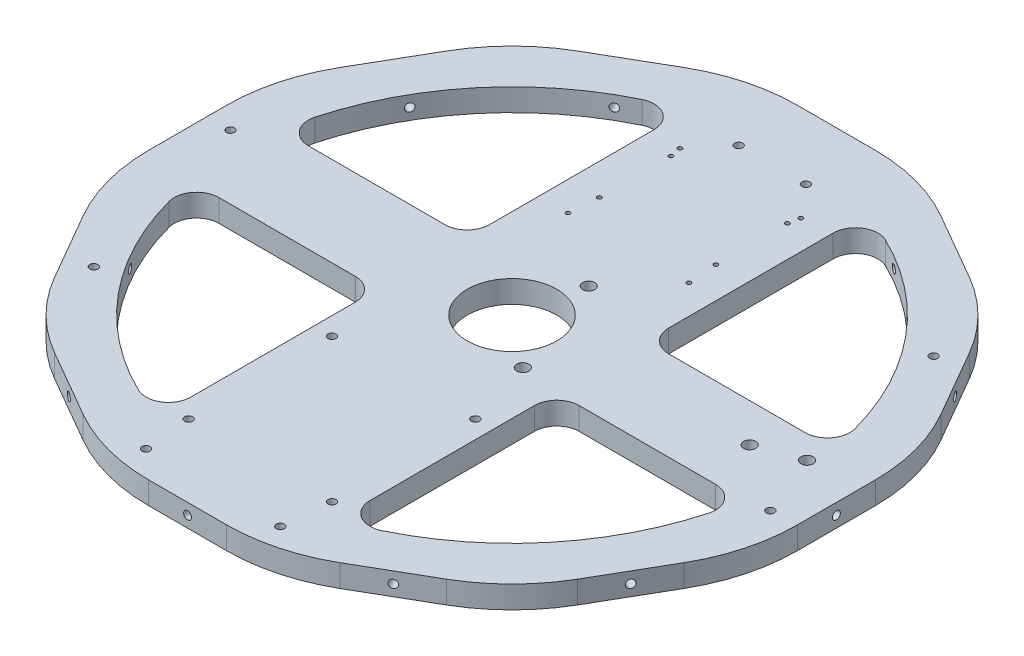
ISO-10303-21;
HEADER;
FILE_DESCRIPTION(('STEP AP214'),'2;1');
FILE_NAME('part.step','',(''),(''),'','','');
FILE_SCHEMA(('AUTOMOTIVE_DESIGN { 1 0 10303 214 1 1 1 1 }'));
ENDSEC;
DATA;
#1=APPLICATION_CONTEXT('core data for automotive mechanical design processes');
#2=APPLICATION_PROTOCOL_DEFINITION('international standard','automotive_design',2000,#1);
#3=PRODUCT_CONTEXT('',#1,'mechanical');
#4=PRODUCT('Part','Part','',(#3));
#5=PRODUCT_RELATED_PRODUCT_CATEGORY('part','',(#4));
#6=PRODUCT_DEFINITION_FORMATION('','',#4);
#7=PRODUCT_DEFINITION_CONTEXT('part definition',#1,'design');
#8=PRODUCT_DEFINITION('design','',#6,#7);
#9=PRODUCT_DEFINITION_SHAPE('','',#8);
#10=(LENGTH_UNIT() NAMED_UNIT(*) SI_UNIT(.MILLI.,.METRE.));
#11=(NAMED_UNIT(*) PLANE_ANGLE_UNIT() SI_UNIT($,.RADIAN.));
#12=(NAMED_UNIT(*) SI_UNIT($,.STERADIAN.) SOLID_ANGLE_UNIT());
#13=UNCERTAINTY_MEASURE_WITH_UNIT(LENGTH_MEASURE(1.E-05),#10,'distance_accuracy_value','');
#14=(GEOMETRIC_REPRESENTATION_CONTEXT(3) GLOBAL_UNCERTAINTY_ASSIGNED_CONTEXT((#13)) GLOBAL_UNIT_ASSIGNED_CONTEXT((#10,
#11,#12)) REPRESENTATION_CONTEXT('',''));
#15=CARTESIAN_POINT('',(0.,0.,0.));
#16=DIRECTION('',(0.,0.,1.));
#17=DIRECTION('',(1.,0.,0.));
#18=AXIS2_PLACEMENT_3D('',#15,#16,#17);
#19=CARTESIAN_POINT('',(0.,6.35,0.));
#20=DIRECTION('',(0.,1.,0.));
#21=DIRECTION('',(0.,0.,1.));
#22=AXIS2_PLACEMENT_3D('',#19,#20,#21);
#23=PLANE('',#22);
#24=CARTESIAN_POINT('',(-19.05,6.35,84.7534478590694));
#25=DIRECTION('',(0.,1.,0.));
#26=DIRECTION('',(0.,0.,1.));
#27=AXIS2_PLACEMENT_3D('',#24,#25,#26);
#28=CIRCLE('',#27,1.13029999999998);
#29=CARTESIAN_POINT('',(-19.05,6.35,85.8837478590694));
#30=VERTEX_POINT('',#29);
#31=EDGE_CURVE('E2627',#30,#30,#28,.T.);
#32=ORIENTED_EDGE('',*,*,#31,.F.);
#33=EDGE_LOOP('',(#32));
#34=FACE_BOUND('',#33,.T.);
#35=CARTESIAN_POINT('',(19.05,6.35,84.7534478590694));
#36=DIRECTION('',(0.,1.,0.));
#37=DIRECTION('',(0.,0.,1.));
#38=AXIS2_PLACEMENT_3D('',#35,#36,#37);
#39=CIRCLE('',#38,1.13029999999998);
#40=CARTESIAN_POINT('',(19.05,6.35,85.8837478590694));
#41=VERTEX_POINT('',#40);
#42=EDGE_CURVE('E2619',#41,#41,#39,.T.);
#43=ORIENTED_EDGE('',*,*,#42,.F.);
#44=EDGE_LOOP('',(#43));
#45=FACE_BOUND('',#44,.T.);
#46=CARTESIAN_POINT('',(84.6668148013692,6.35,11.3984654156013));
#47=DIRECTION('',(0.,1.,0.));
#48=DIRECTION('',(0.,0.,1.));
#49=AXIS2_PLACEMENT_3D('',#46,#47,#48);
#50=CIRCLE('',#49,1.13029999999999);
#51=CARTESIAN_POINT('',(84.6668148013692,6.35,12.5287654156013));
#52=VERTEX_POINT('',#51);
#53=EDGE_CURVE('E2611',#52,#52,#50,.T.);
#54=ORIENTED_EDGE('',*,*,#53,.F.);
#55=EDGE_LOOP('',(#54));
#56=FACE_BOUND('',#55,.T.);
#57=CARTESIAN_POINT('',(69.8781090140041,6.35,-49.7070175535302));
#58=DIRECTION('',(0.,1.,0.));
#59=DIRECTION('',(0.,0.,1.));
#60=AXIS2_PLACEMENT_3D('',#57,#58,#59);
#61=CIRCLE('',#60,1.13029999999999);
#62=CARTESIAN_POINT('',(69.8781090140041,6.35,-48.5767175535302));
#63=VERTEX_POINT('',#62);
#64=EDGE_CURVE('E2603',#63,#63,#61,.T.);
#65=ORIENTED_EDGE('',*,*,#64,.F.);
#66=EDGE_LOOP('',(#65));
#67=FACE_BOUND('',#66,.T.);
#68=CARTESIAN_POINT('',(-9.525,6.35,-73.8099482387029));
#69=DIRECTION('',(0.,1.,0.));
#70=DIRECTION('',(0.,0.,1.));
#71=AXIS2_PLACEMENT_3D('',#68,#69,#70);
#72=CIRCLE('',#71,1.13029999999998);
#73=CARTESIAN_POINT('',(-9.525,6.35,-72.6796482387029));
#74=VERTEX_POINT('',#73);
#75=EDGE_CURVE('E2595',#74,#74,#72,.T.);
#76=ORIENTED_EDGE('',*,*,#75,.F.);
#77=EDGE_LOOP('',(#76));
#78=FACE_BOUND('',#77,.T.);
#79=CARTESIAN_POINT('',(9.525,6.35,-73.8099482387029));
#80=DIRECTION('',(0.,1.,0.));
#81=DIRECTION('',(0.,0.,1.));
#82=AXIS2_PLACEMENT_3D('',#79,#80,#81);
#83=CIRCLE('',#82,1.13029999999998);
#84=CARTESIAN_POINT('',(9.525,6.35,-72.6796482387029));
#85=VERTEX_POINT('',#84);
#86=EDGE_CURVE('E2587',#85,#85,#83,.T.);
#87=ORIENTED_EDGE('',*,*,#86,.F.);
#88=EDGE_LOOP('',(#87));
#89=FACE_BOUND('',#88,.T.);
#90=CARTESIAN_POINT('',(-85.3559751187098,6.35,-5.49141824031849));
#91=DIRECTION('',(0.,1.,0.));
#92=DIRECTION('',(0.,0.,1.));
#93=AXIS2_PLACEMENT_3D('',#90,#91,#92);
#94=CIRCLE('',#93,1.13029999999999);
#95=CARTESIAN_POINT('',(-85.3559751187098,6.35,-4.3611182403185));
#96=VERTEX_POINT('',#95);
#97=EDGE_CURVE('E2579',#96,#96,#94,.T.);
#98=ORIENTED_EDGE('',*,*,#97,.F.);
#99=EDGE_LOOP('',(#98));
#100=FACE_BOUND('',#99,.T.);
#101=CARTESIAN_POINT('',(-71.1747336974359,6.35,47.4336952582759));
#102=DIRECTION('',(0.,1.,0.));
#103=DIRECTION('',(0.,0.,1.));
#104=AXIS2_PLACEMENT_3D('',#101,#102,#103);
#105=CIRCLE('',#104,1.13029999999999);
#106=CARTESIAN_POINT('',(-71.1747336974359,6.35,48.5639952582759));
#107=VERTEX_POINT('',#106);
#108=EDGE_CURVE('E2571',#107,#107,#105,.T.);
#109=ORIENTED_EDGE('',*,*,#108,.F.);
#110=EDGE_LOOP('',(#109));
#111=FACE_BOUND('',#110,.T.);
#112=CARTESIAN_POINT('',(65.5825230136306,6.35,-1.82032281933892));
#113=DIRECTION('',(0.,1.,0.));
#114=DIRECTION('',(0.,0.,1.));
#115=AXIS2_PLACEMENT_3D('',#112,#113,#114);
#116=CIRCLE('',#115,1.7272);
#117=CARTESIAN_POINT('',(65.5825230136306,6.35,-0.0931228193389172));
#118=VERTEX_POINT('',#117);
#119=EDGE_CURVE('E2235',#118,#118,#116,.T.);
#120=ORIENTED_EDGE('',*,*,#119,.F.);
#121=EDGE_LOOP('',(#120));
#122=FACE_BOUND('',#121,.T.);
#123=CARTESIAN_POINT('',(77.5166192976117,6.35,-6.16397863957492));
#124=DIRECTION('',(0.,1.,0.));
#125=DIRECTION('',(0.,0.,1.));
#126=AXIS2_PLACEMENT_3D('',#123,#124,#125);
#127=CIRCLE('',#126,1.7272);
#128=CARTESIAN_POINT('',(77.5166192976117,6.35,-4.43677863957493));
#129=VERTEX_POINT('',#128);
#130=EDGE_CURVE('E2243',#129,#129,#127,.T.);
#131=ORIENTED_EDGE('',*,*,#130,.F.);
#132=EDGE_LOOP('',(#131));
#133=FACE_BOUND('',#132,.T.);
#134=CARTESIAN_POINT('',(3.75705175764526,6.35,-17.9909759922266));
#135=DIRECTION('',(0.,1.,0.));
#136=DIRECTION('',(0.,0.,1.));
#137=AXIS2_PLACEMENT_3D('',#134,#135,#136);
#138=CIRCLE('',#137,1.7272);
#139=CARTESIAN_POINT('',(3.75705175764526,6.35,-16.2637759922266));
#140=VERTEX_POINT('',#139);
#141=EDGE_CURVE('E2251',#140,#140,#138,.T.);
#142=ORIENTED_EDGE('',*,*,#141,.F.);
#143=EDGE_LOOP('',(#142));
#144=FACE_BOUND('',#143,.T.);
#145=CARTESIAN_POINT('',(14.4424450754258,6.35,11.3669008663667));
#146=DIRECTION('',(0.,1.,0.));
#147=DIRECTION('',(0.,0.,1.));
#148=AXIS2_PLACEMENT_3D('',#145,#146,#147);
#149=CIRCLE('',#148,1.7272);
#150=CARTESIAN_POINT('',(14.4424450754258,6.35,13.0941008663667));
#151=VERTEX_POINT('',#150);
#152=EDGE_CURVE('E2259',#151,#151,#149,.T.);
#153=ORIENTED_EDGE('',*,*,#152,.F.);
#154=EDGE_LOOP('',(#153));
#155=FACE_BOUND('',#154,.T.);
#156=CARTESIAN_POINT('',(-20.32,6.35,30.734));
#157=DIRECTION('',(0.,1.,0.));
#158=DIRECTION('',(0.,0.,1.));
#159=AXIS2_PLACEMENT_3D('',#156,#157,#158);
#160=CIRCLE('',#159,1.1303);
#161=CARTESIAN_POINT('',(-20.32,6.35,31.8643));
#162=VERTEX_POINT('',#161);
#163=EDGE_CURVE('E2267',#162,#162,#160,.T.);
#164=ORIENTED_EDGE('',*,*,#163,.F.);
#165=EDGE_LOOP('',(#164));
#166=FACE_BOUND('',#165,.T.);
#167=CARTESIAN_POINT('',(20.32,6.35,30.734));
#168=DIRECTION('',(0.,1.,0.));
#169=DIRECTION('',(0.,0.,1.));
#170=AXIS2_PLACEMENT_3D('',#167,#168,#169);
#171=CIRCLE('',#170,1.1303);
#172=CARTESIAN_POINT('',(20.32,6.35,31.8643));
#173=VERTEX_POINT('',#172);
#174=EDGE_CURVE('E2275',#173,#173,#171,.T.);
#175=ORIENTED_EDGE('',*,*,#174,.F.);
#176=EDGE_LOOP('',(#175));
#177=FACE_BOUND('',#176,.T.);
#178=CARTESIAN_POINT('',(-20.32,6.35,71.374));
#179=DIRECTION('',(0.,1.,0.));
#180=DIRECTION('',(0.,0.,1.));
#181=AXIS2_PLACEMENT_3D('',#178,#179,#180);
#182=CIRCLE('',#181,1.1303);
#183=CARTESIAN_POINT('',(-20.32,6.35,72.5043));
#184=VERTEX_POINT('',#183);
#185=EDGE_CURVE('E2283',#184,#184,#182,.T.);
#186=ORIENTED_EDGE('',*,*,#185,.F.);
#187=EDGE_LOOP('',(#186));
#188=FACE_BOUND('',#187,.T.);
#189=CARTESIAN_POINT('',(20.32,6.35,71.374));
#190=DIRECTION('',(0.,1.,0.));
#191=DIRECTION('',(0.,0.,1.));
#192=AXIS2_PLACEMENT_3D('',#189,#190,#191);
#193=CIRCLE('',#192,1.1303);
#194=CARTESIAN_POINT('',(20.32,6.35,72.5043));
#195=VERTEX_POINT('',#194);
#196=EDGE_CURVE('E2291',#195,#195,#193,.T.);
#197=ORIENTED_EDGE('',*,*,#196,.F.);
#198=EDGE_LOOP('',(#197));
#199=FACE_BOUND('',#198,.T.);
#200=CARTESIAN_POINT('',(-17.145,6.35,-33.0199999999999));
#201=DIRECTION('',(0.,1.,0.));
#202=DIRECTION('',(0.,0.,1.));
#203=AXIS2_PLACEMENT_3D('',#200,#201,#202);
#204=CIRCLE('',#203,0.59563);
#205=CARTESIAN_POINT('',(-17.145,6.35,-32.4243699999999));
#206=VERTEX_POINT('',#205);
#207=EDGE_CURVE('E2299',#206,#206,#204,.T.);
#208=ORIENTED_EDGE('',*,*,#207,.F.);
#209=EDGE_LOOP('',(#208));
#210=FACE_BOUND('',#209,.T.);
#211=CARTESIAN_POINT('',(17.145,6.35,-64.7699999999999));
#212=DIRECTION('',(0.,1.,0.));
#213=DIRECTION('',(0.,0.,1.));
#214=AXIS2_PLACEMENT_3D('',#211,#212,#213);
#215=CIRCLE('',#214,0.59563);
#216=CARTESIAN_POINT('',(17.145,6.35,-64.1743699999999));
#217=VERTEX_POINT('',#216);
#218=EDGE_CURVE('E2307',#217,#217,#215,.T.);
#219=ORIENTED_EDGE('',*,*,#218,.F.);
#220=EDGE_LOOP('',(#219));
#221=FACE_BOUND('',#220,.T.);
#222=CARTESIAN_POINT('',(-17.145,6.35,-64.7699999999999));
#223=DIRECTION('',(0.,1.,0.));
#224=DIRECTION('',(0.,0.,1.));
#225=AXIS2_PLACEMENT_3D('',#222,#223,#224);
#226=CIRCLE('',#225,0.59563);
#227=CARTESIAN_POINT('',(-17.145,6.35,-64.1743699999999));
#228=VERTEX_POINT('',#227);
#229=EDGE_CURVE('E2315',#228,#228,#226,.T.);
#230=ORIENTED_EDGE('',*,*,#229,.F.);
#231=EDGE_LOOP('',(#230));
#232=FACE_BOUND('',#231,.T.);
#233=CARTESIAN_POINT('',(17.145,6.35,-33.0199999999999));
#234=DIRECTION('',(0.,1.,0.));
#235=DIRECTION('',(0.,0.,1.));
#236=AXIS2_PLACEMENT_3D('',#233,#234,#235);
#237=CIRCLE('',#236,0.59563);
#238=CARTESIAN_POINT('',(17.145,6.35,-32.4243699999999));
#239=VERTEX_POINT('',#238);
#240=EDGE_CURVE('E2323',#239,#239,#237,.T.);
#241=ORIENTED_EDGE('',*,*,#240,.F.);
#242=EDGE_LOOP('',(#241));
#243=FACE_BOUND('',#242,.T.);
#244=CARTESIAN_POINT('',(-16.51,6.35,-41.2749999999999));
#245=DIRECTION('',(0.,1.,0.));
#246=DIRECTION('',(0.,0.,1.));
#247=AXIS2_PLACEMENT_3D('',#244,#245,#246);
#248=CIRCLE('',#247,0.59563);
#249=CARTESIAN_POINT('',(-16.51,6.35,-40.6793699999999));
#250=VERTEX_POINT('',#249);
#251=EDGE_CURVE('E2331',#250,#250,#248,.T.);
#252=ORIENTED_EDGE('',*,*,#251,.F.);
#253=EDGE_LOOP('',(#252));
#254=FACE_BOUND('',#253,.T.);
#255=CARTESIAN_POINT('',(-16.51,6.35,-61.5949999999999));
#256=DIRECTION('',(0.,1.,0.));
#257=DIRECTION('',(0.,0.,1.));
#258=AXIS2_PLACEMENT_3D('',#255,#256,#257);
#259=CIRCLE('',#258,0.59563);
#260=CARTESIAN_POINT('',(-16.51,6.35,-60.9993699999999));
#261=VERTEX_POINT('',#260);
#262=EDGE_CURVE('E2339',#261,#261,#259,.T.);
#263=ORIENTED_EDGE('',*,*,#262,.F.);
#264=EDGE_LOOP('',(#263));
#265=FACE_BOUND('',#264,.T.);
#266=CARTESIAN_POINT('',(16.51,6.35,-61.5949999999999));
#267=DIRECTION('',(0.,1.,0.));
#268=DIRECTION('',(0.,0.,1.));
#269=AXIS2_PLACEMENT_3D('',#266,#267,#268);
#270=CIRCLE('',#269,0.59563);
#271=CARTESIAN_POINT('',(16.51,6.35,-60.9993699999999));
#272=VERTEX_POINT('',#271);
#273=EDGE_CURVE('E2347',#272,#272,#270,.T.);
#274=ORIENTED_EDGE('',*,*,#273,.F.);
#275=EDGE_LOOP('',(#274));
#276=FACE_BOUND('',#275,.T.);
#277=CARTESIAN_POINT('',(16.51,6.35,-41.2749999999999));
#278=DIRECTION('',(0.,1.,0.));
#279=DIRECTION('',(0.,0.,1.));
#280=AXIS2_PLACEMENT_3D('',#277,#278,#279);
#281=CIRCLE('',#280,0.59563);
#282=CARTESIAN_POINT('',(16.51,6.35,-40.6793699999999));
#283=VERTEX_POINT('',#282);
#284=EDGE_CURVE('E2354',#283,#283,#281,.T.);
#285=ORIENTED_EDGE('',*,*,#284,.F.);
#286=EDGE_LOOP('',(#285));
#287=FACE_BOUND('',#286,.T.);
#288=CARTESIAN_POINT('',(-31.75,6.35,-65.6783069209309));
#289=DIRECTION('',(0.,1.,0.));
#290=DIRECTION('',(0.,0.,-1.));
#291=AXIS2_PLACEMENT_3D('',#288,#289,#290);
#292=CIRCLE('',#291,6.34999999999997);
#293=CARTESIAN_POINT('',(-25.4,6.35,-65.6783069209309));
#294=VERTEX_POINT('',#293);
#295=CARTESIAN_POINT('',(-34.5137080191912,6.35,-71.3953356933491));
#296=VERTEX_POINT('',#295);
#297=EDGE_CURVE('E1209',#294,#296,#292,.T.);
#298=ORIENTED_EDGE('',*,*,#297,.F.);
#299=DIRECTION('',(0.,0.,-1.));
#300=VECTOR('',#299,1.);
#301=CARTESIAN_POINT('',(-25.4,6.35,-19.05));
#302=LINE('',#301,#300);
#303=CARTESIAN_POINT('',(-25.4,6.35,-19.05));
#304=VERTEX_POINT('',#303);
#305=EDGE_CURVE('E1229',#304,#294,#302,.T.);
#306=ORIENTED_EDGE('',*,*,#305,.F.);
#307=CARTESIAN_POINT('',(-31.75,6.35,-19.05));
#308=DIRECTION('',(0.,1.,0.));
#309=DIRECTION('',(0.,0.,-1.));
#310=AXIS2_PLACEMENT_3D('',#307,#308,#309);
#311=CIRCLE('',#310,6.35);
#312=CARTESIAN_POINT('',(-31.75,6.35,-12.7));
#313=VERTEX_POINT('',#312);
#314=EDGE_CURVE('E1261',#313,#304,#311,.T.);
#315=ORIENTED_EDGE('',*,*,#314,.F.);
#316=DIRECTION('',(1.,0.,0.));
#317=VECTOR('',#316,1.);
#318=CARTESIAN_POINT('',(-70.418747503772,6.35,-12.7));
#319=LINE('',#318,#317);
#320=CARTESIAN_POINT('',(-70.418747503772,6.35,-12.7));
#321=VERTEX_POINT('',#320);
#322=EDGE_CURVE('E1257',#321,#313,#319,.T.);
#323=ORIENTED_EDGE('',*,*,#322,.F.);
#324=CARTESIAN_POINT('',(-70.418747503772,6.35,-19.05));
#325=DIRECTION('',(0.,1.,0.));
#326=DIRECTION('',(0.,0.,1.));
#327=AXIS2_PLACEMENT_3D('',#324,#325,#326);
#328=CIRCLE('',#327,6.34999999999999);
#329=CARTESIAN_POINT('',(-76.5484122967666,6.35,-20.7082248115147));
#330=VERTEX_POINT('',#329);
#331=EDGE_CURVE('E1253',#330,#321,#328,.T.);
#332=ORIENTED_EDGE('',*,*,#331,.F.);
#333=CARTESIAN_POINT('',(0.,6.35,0.));
#334=DIRECTION('',(0.,1.,0.));
#335=DIRECTION('',(0.,0.,-1.));
#336=AXIS2_PLACEMENT_3D('',#333,#334,#335);
#337=CIRCLE('',#336,79.3);
#338=EDGE_CURVE('E1249',#296,#330,#337,.T.);
#339=ORIENTED_EDGE('',*,*,#338,.F.);
#340=EDGE_LOOP('',(#298,#306,#315,#323,#332,#339));
#341=FACE_BOUND('',#340,.T.);
#342=CARTESIAN_POINT('',(31.75,6.35,65.6783069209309));
#343=DIRECTION('',(0.,1.,0.));
#344=DIRECTION('',(0.,0.,1.));
#345=AXIS2_PLACEMENT_3D('',#342,#343,#344);
#346=CIRCLE('',#345,6.34999999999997);
#347=CARTESIAN_POINT('',(25.4,6.35,65.6783069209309));
#348=VERTEX_POINT('',#347);
#349=CARTESIAN_POINT('',(34.5137080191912,6.35,71.3953356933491));
#350=VERTEX_POINT('',#349);
#351=EDGE_CURVE('E453',#348,#350,#346,.T.);
#352=ORIENTED_EDGE('',*,*,#351,.F.);
#353=DIRECTION('',(0.,0.,1.));
#354=VECTOR('',#353,1.);
#355=CARTESIAN_POINT('',(25.4,6.35,19.05));
#356=LINE('',#355,#354);
#357=CARTESIAN_POINT('',(25.4,6.35,19.05));
#358=VERTEX_POINT('',#357);
#359=EDGE_CURVE('E472',#358,#348,#356,.T.);
#360=ORIENTED_EDGE('',*,*,#359,.F.);
#361=CARTESIAN_POINT('',(31.75,6.35,19.05));
#362=DIRECTION('',(0.,1.,0.));
#363=DIRECTION('',(0.,0.,1.));
#364=AXIS2_PLACEMENT_3D('',#361,#362,#363);
#365=CIRCLE('',#364,6.35);
#366=CARTESIAN_POINT('',(31.75,6.35,12.7));
#367=VERTEX_POINT('',#366);
#368=EDGE_CURVE('E465',#367,#358,#365,.T.);
#369=ORIENTED_EDGE('',*,*,#368,.F.);
#370=DIRECTION('',(-1.,0.,0.));
#371=VECTOR('',#370,1.);
#372=CARTESIAN_POINT('',(70.418747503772,6.35,12.7));
#373=LINE('',#372,#371);
#374=CARTESIAN_POINT('',(70.418747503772,6.35,12.7));
#375=VERTEX_POINT('',#374);
#376=EDGE_CURVE('E460',#375,#367,#373,.T.);
#377=ORIENTED_EDGE('',*,*,#376,.F.);
#378=CARTESIAN_POINT('',(70.418747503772,6.35,19.05));
#379=DIRECTION('',(0.,1.,0.));
#380=DIRECTION('',(0.,0.,-1.));
#381=AXIS2_PLACEMENT_3D('',#378,#379,#380);
#382=CIRCLE('',#381,6.34999999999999);
#383=CARTESIAN_POINT('',(76.5484122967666,6.35,20.7082248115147));
#384=VERTEX_POINT('',#383);
#385=EDGE_CURVE('E452',#384,#375,#382,.T.);
#386=ORIENTED_EDGE('',*,*,#385,.F.);
#387=CARTESIAN_POINT('',(0.,6.35,0.));
#388=DIRECTION('',(0.,1.,0.));
#389=DIRECTION('',(0.,0.,1.));
#390=AXIS2_PLACEMENT_3D('',#387,#388,#389);
#391=CIRCLE('',#390,79.3);
#392=EDGE_CURVE('E443',#350,#384,#391,.T.);
#393=ORIENTED_EDGE('',*,*,#392,.F.);
#394=EDGE_LOOP('',(#352,#360,#369,#377,#386,#393));
#395=FACE_BOUND('',#394,.T.);
#396=DIRECTION('',(0.,0.,-1.));
#397=VECTOR('',#396,1.);
#398=CARTESIAN_POINT('',(92.,6.35,24.6513257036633));
#399=LINE('',#398,#397);
#400=CARTESIAN_POINT('',(92.,6.35,11.0395067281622));
#401=VERTEX_POINT('',#400);
#402=CARTESIAN_POINT('',(92.,6.35,-11.0395067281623));
#403=VERTEX_POINT('',#402);
#404=EDGE_CURVE('E548',#401,#403,#399,.T.);
#405=ORIENTED_EDGE('',*,*,#404,.T.);
#406=CARTESIAN_POINT('',(41.2,6.35,-11.0395067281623));
#407=DIRECTION('',(0.,1.,0.));
#408=DIRECTION('',(0.,0.,1.));
#409=AXIS2_PLACEMENT_3D('',#406,#407,#408);
#410=CIRCLE('',#409,50.8);
#411=CARTESIAN_POINT('',(85.1940905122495,6.35,-36.4395067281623));
#412=VERTEX_POINT('',#411);
#413=EDGE_CURVE('E681',#403,#412,#410,.T.);
#414=ORIENTED_EDGE('',*,*,#413,.T.);
#415=DIRECTION('',(-0.5,0.,-0.866025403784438));
#416=VECTOR('',#415,1.);
#417=CARTESIAN_POINT('',(92.,6.35,-24.6513257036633));
#418=LINE('',#417,#416);
#419=CARTESIAN_POINT('',(74.1545837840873,6.35,-55.5604932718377));
#420=VERTEX_POINT('',#419);
#421=EDGE_CURVE('E503',#412,#420,#418,.T.);
#422=ORIENTED_EDGE('',*,*,#421,.T.);
#423=CARTESIAN_POINT('',(30.1604932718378,6.35,-30.1604932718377));
#424=DIRECTION('',(0.,1.,0.));
#425=DIRECTION('',(0.,0.,1.));
#426=AXIS2_PLACEMENT_3D('',#423,#424,#425);
#427=CIRCLE('',#426,50.8);
#428=CARTESIAN_POINT('',(55.5604932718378,6.35,-74.1545837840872));
#429=VERTEX_POINT('',#428);
#430=EDGE_CURVE('E651',#420,#429,#427,.T.);
#431=ORIENTED_EDGE('',*,*,#430,.T.);
#432=DIRECTION('',(-0.866025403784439,0.,-0.5));
#433=VECTOR('',#432,1.);
#434=CARTESIAN_POINT('',(67.3486742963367,6.35,-67.3486742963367));
#435=LINE('',#434,#433);
#436=CARTESIAN_POINT('',(36.4395067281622,6.35,-85.1940905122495));
#437=VERTEX_POINT('',#436);
#438=EDGE_CURVE('E507',#429,#437,#435,.T.);
#439=ORIENTED_EDGE('',*,*,#438,.T.);
#440=CARTESIAN_POINT('',(11.0395067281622,6.35,-41.2));
#441=DIRECTION('',(0.,1.,0.));
#442=DIRECTION('',(0.,0.,1.));
#443=AXIS2_PLACEMENT_3D('',#440,#441,#442);
#444=CIRCLE('',#443,50.8);
#445=CARTESIAN_POINT('',(11.0395067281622,6.35,-92.));
#446=VERTEX_POINT('',#445);
#447=EDGE_CURVE('E654',#437,#446,#444,.T.);
#448=ORIENTED_EDGE('',*,*,#447,.T.);
#449=DIRECTION('',(-1.,0.,0.));
#450=VECTOR('',#449,1.);
#451=CARTESIAN_POINT('',(24.6513257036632,6.35,-92.));
#452=LINE('',#451,#450);
#453=CARTESIAN_POINT('',(-11.0395067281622,6.35,-92.));
#454=VERTEX_POINT('',#453);
#455=EDGE_CURVE('E512',#446,#454,#452,.T.);
#456=ORIENTED_EDGE('',*,*,#455,.T.);
#457=CARTESIAN_POINT('',(-11.0395067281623,6.35,-41.2));
#458=DIRECTION('',(0.,1.,0.));
#459=DIRECTION('',(0.,0.,1.));
#460=AXIS2_PLACEMENT_3D('',#457,#458,#459);
#461=CIRCLE('',#460,50.8);
#462=CARTESIAN_POINT('',(-36.4395067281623,6.35,-85.1940905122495));
#463=VERTEX_POINT('',#462);
#464=EDGE_CURVE('E657',#454,#463,#461,.T.);
#465=ORIENTED_EDGE('',*,*,#464,.T.);
#466=DIRECTION('',(-0.866025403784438,0.,0.5));
#467=VECTOR('',#466,1.);
#468=CARTESIAN_POINT('',(-24.6513257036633,6.35,-92.));
#469=LINE('',#468,#467);
#470=CARTESIAN_POINT('',(-55.5604932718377,6.35,-74.1545837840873));
#471=VERTEX_POINT('',#470);
#472=EDGE_CURVE('E516',#463,#471,#469,.T.);
#473=ORIENTED_EDGE('',*,*,#472,.T.);
#474=CARTESIAN_POINT('',(-30.1604932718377,6.35,-30.1604932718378));
#475=DIRECTION('',(0.,1.,0.));
#476=DIRECTION('',(0.,0.,1.));
#477=AXIS2_PLACEMENT_3D('',#474,#475,#476);
#478=CIRCLE('',#477,50.8);
#479=CARTESIAN_POINT('',(-74.1545837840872,6.35,-55.5604932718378));
#480=VERTEX_POINT('',#479);
#481=EDGE_CURVE('E660',#471,#480,#478,.T.);
#482=ORIENTED_EDGE('',*,*,#481,.T.);
#483=DIRECTION('',(-0.5,0.,0.866025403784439));
#484=VECTOR('',#483,1.);
#485=CARTESIAN_POINT('',(-67.3486742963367,6.35,-67.3486742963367));
#486=LINE('',#485,#484);
#487=CARTESIAN_POINT('',(-85.1940905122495,6.35,-36.4395067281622));
#488=VERTEX_POINT('',#487);
#489=EDGE_CURVE('E520',#480,#488,#486,.T.);
#490=ORIENTED_EDGE('',*,*,#489,.T.);
#491=CARTESIAN_POINT('',(-41.2,6.35,-11.0395067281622));
#492=DIRECTION('',(0.,1.,0.));
#493=DIRECTION('',(0.,0.,1.));
#494=AXIS2_PLACEMENT_3D('',#491,#492,#493);
#495=CIRCLE('',#494,50.8);
#496=CARTESIAN_POINT('',(-92.,6.35,-11.0395067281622));
#497=VERTEX_POINT('',#496);
#498=EDGE_CURVE('E663',#488,#497,#495,.T.);
#499=ORIENTED_EDGE('',*,*,#498,.T.);
#500=DIRECTION('',(0.,0.,1.));
#501=VECTOR('',#500,1.);
#502=CARTESIAN_POINT('',(-92.,6.35,-24.6513257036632));
#503=LINE('',#502,#501);
#504=CARTESIAN_POINT('',(-92.,6.35,11.0395067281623));
#505=VERTEX_POINT('',#504);
#506=EDGE_CURVE('E524',#497,#505,#503,.T.);
#507=ORIENTED_EDGE('',*,*,#506,.T.);
#508=CARTESIAN_POINT('',(-41.2,6.35,11.0395067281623));
#509=DIRECTION('',(0.,1.,0.));
#510=DIRECTION('',(0.,0.,1.));
#511=AXIS2_PLACEMENT_3D('',#508,#509,#510);
#512=CIRCLE('',#511,50.8);
#513=CARTESIAN_POINT('',(-85.1940905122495,6.35,36.4395067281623));
#514=VERTEX_POINT('',#513);
#515=EDGE_CURVE('E666',#505,#514,#512,.T.);
#516=ORIENTED_EDGE('',*,*,#515,.T.);
#517=DIRECTION('',(0.5,0.,0.866025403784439));
#518=VECTOR('',#517,1.);
#519=CARTESIAN_POINT('',(-92.,6.35,24.6513257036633));
#520=LINE('',#519,#518);
#521=CARTESIAN_POINT('',(-74.1545837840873,6.35,55.5604932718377));
#522=VERTEX_POINT('',#521);
#523=EDGE_CURVE('E528',#514,#522,#520,.T.);
#524=ORIENTED_EDGE('',*,*,#523,.T.);
#525=CARTESIAN_POINT('',(-30.1604932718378,6.35,30.1604932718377));
#526=DIRECTION('',(0.,1.,0.));
#527=DIRECTION('',(0.,0.,1.));
#528=AXIS2_PLACEMENT_3D('',#525,#526,#527);
#529=CIRCLE('',#528,50.8);
#530=CARTESIAN_POINT('',(-55.5604932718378,6.35,74.1545837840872));
#531=VERTEX_POINT('',#530);
#532=EDGE_CURVE('E669',#522,#531,#529,.T.);
#533=ORIENTED_EDGE('',*,*,#532,.T.);
#534=DIRECTION('',(0.866025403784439,0.,0.499999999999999));
#535=VECTOR('',#534,1.);
#536=CARTESIAN_POINT('',(-67.3486742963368,6.35,67.3486742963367));
#537=LINE('',#536,#535);
#538=CARTESIAN_POINT('',(-36.4395067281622,6.35,85.1940905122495));
#539=VERTEX_POINT('',#538);
#540=EDGE_CURVE('E532',#531,#539,#537,.T.);
#541=ORIENTED_EDGE('',*,*,#540,.T.);
#542=CARTESIAN_POINT('',(-11.0395067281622,6.35,41.2));
#543=DIRECTION('',(0.,1.,0.));
#544=DIRECTION('',(0.,0.,1.));
#545=AXIS2_PLACEMENT_3D('',#542,#543,#544);
#546=CIRCLE('',#545,50.8);
#547=CARTESIAN_POINT('',(-11.0395067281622,6.35,92.));
#548=VERTEX_POINT('',#547);
#549=EDGE_CURVE('E648',#539,#548,#546,.T.);
#550=ORIENTED_EDGE('',*,*,#549,.T.);
#551=DIRECTION('',(1.,0.,0.));
#552=VECTOR('',#551,1.);
#553=CARTESIAN_POINT('',(-24.6513257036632,6.35,92.));
#554=LINE('',#553,#552);
#555=CARTESIAN_POINT('',(11.0395067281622,6.35,92.));
#556=VERTEX_POINT('',#555);
#557=EDGE_CURVE('E536',#548,#556,#554,.T.);
#558=ORIENTED_EDGE('',*,*,#557,.T.);
#559=CARTESIAN_POINT('',(11.0395067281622,6.35,41.2));
#560=DIRECTION('',(0.,1.,0.));
#561=DIRECTION('',(0.,0.,1.));
#562=AXIS2_PLACEMENT_3D('',#559,#560,#561);
#563=CIRCLE('',#562,50.8);
#564=CARTESIAN_POINT('',(36.4395067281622,6.35,85.1940905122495));
#565=VERTEX_POINT('',#564);
#566=EDGE_CURVE('E672',#556,#565,#563,.T.);
#567=ORIENTED_EDGE('',*,*,#566,.T.);
#568=DIRECTION('',(0.866025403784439,0.,-0.5));
#569=VECTOR('',#568,1.);
#570=CARTESIAN_POINT('',(24.6513257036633,6.35,92.));
#571=LINE('',#570,#569);
#572=CARTESIAN_POINT('',(55.5604932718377,6.35,74.1545837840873));
#573=VERTEX_POINT('',#572);
#574=EDGE_CURVE('E540',#565,#573,#571,.T.);
#575=ORIENTED_EDGE('',*,*,#574,.T.);
#576=CARTESIAN_POINT('',(30.1604932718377,6.35,30.1604932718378));
#577=DIRECTION('',(0.,1.,0.));
#578=DIRECTION('',(0.,0.,1.));
#579=AXIS2_PLACEMENT_3D('',#576,#577,#578);
#580=CIRCLE('',#579,50.8);
#581=CARTESIAN_POINT('',(74.1545837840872,6.35,55.5604932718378));
#582=VERTEX_POINT('',#581);
#583=EDGE_CURVE('E675',#573,#582,#580,.T.);
#584=ORIENTED_EDGE('',*,*,#583,.T.);
#585=DIRECTION('',(0.5,0.,-0.866025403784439));
#586=VECTOR('',#585,1.);
#587=CARTESIAN_POINT('',(67.3486742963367,6.35,67.3486742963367));
#588=LINE('',#587,#586);
#589=CARTESIAN_POINT('',(85.1940905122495,6.35,36.4395067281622));
#590=VERTEX_POINT('',#589);
#591=EDGE_CURVE('E544',#582,#590,#588,.T.);
#592=ORIENTED_EDGE('',*,*,#591,.T.);
#593=CARTESIAN_POINT('',(41.2,6.35,11.0395067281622));
#594=DIRECTION('',(0.,1.,0.));
#595=DIRECTION('',(0.,0.,1.));
#596=AXIS2_PLACEMENT_3D('',#593,#594,#595);
#597=CIRCLE('',#596,50.8);
#598=EDGE_CURVE('E678',#590,#401,#597,.T.);
#599=ORIENTED_EDGE('',*,*,#598,.T.);
#600=EDGE_LOOP('',(#405,#414,#422,#431,#439,#448,#456,#465,#473,#482,#490,#499,#507,#516,#524,
#533,#541,#550,#558,#567,#575,#584,#592,#599));
#601=FACE_BOUND('',#600,.T.);
#602=CARTESIAN_POINT('',(0.,6.35,0.));
#603=DIRECTION('',(0.,1.,0.));
#604=DIRECTION('',(0.,0.,1.));
#605=AXIS2_PLACEMENT_3D('',#602,#603,#604);
#606=CIRCLE('',#605,12.7);
#607=CARTESIAN_POINT('',(0.,6.35,12.7));
#608=VERTEX_POINT('',#607);
#609=EDGE_CURVE('E495',#608,#608,#606,.T.);
#610=ORIENTED_EDGE('',*,*,#609,.F.);
#611=EDGE_LOOP('',(#610));
#612=FACE_BOUND('',#611,.T.);
#613=DIRECTION('',(0.,0.,1.));
#614=VECTOR('',#613,1.);
#615=CARTESIAN_POINT('',(-25.4,6.35,19.05));
#616=LINE('',#615,#614);
#617=CARTESIAN_POINT('',(-25.4,6.35,19.05));
#618=VERTEX_POINT('',#617);
#619=CARTESIAN_POINT('',(-25.4,6.35,65.6783069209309));
#620=VERTEX_POINT('',#619);
#621=EDGE_CURVE('E1311',#618,#620,#616,.T.);
#622=ORIENTED_EDGE('',*,*,#621,.T.);
#623=CARTESIAN_POINT('',(-31.75,6.35,65.6783069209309));
#624=DIRECTION('',(0.,-1.,0.));
#625=DIRECTION('',(0.,0.,1.));
#626=AXIS2_PLACEMENT_3D('',#623,#624,#625);
#627=CIRCLE('',#626,6.34999999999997);
#628=CARTESIAN_POINT('',(-34.5137080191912,6.35,71.3953356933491));
#629=VERTEX_POINT('',#628);
#630=EDGE_CURVE('E1271',#620,#629,#627,.T.);
#631=ORIENTED_EDGE('',*,*,#630,.T.);
#632=CARTESIAN_POINT('',(0.,6.35,0.));
#633=DIRECTION('',(0.,-1.,0.));
#634=DIRECTION('',(0.,0.,1.));
#635=AXIS2_PLACEMENT_3D('',#632,#633,#634);
#636=CIRCLE('',#635,79.3);
#637=CARTESIAN_POINT('',(-76.5484122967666,6.35,20.7082248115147));
#638=VERTEX_POINT('',#637);
#639=EDGE_CURVE('E1291',#629,#638,#636,.T.);
#640=ORIENTED_EDGE('',*,*,#639,.T.);
#641=CARTESIAN_POINT('',(-70.418747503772,6.35,19.05));
#642=DIRECTION('',(0.,-1.,0.));
#643=DIRECTION('',(0.,0.,-1.));
#644=AXIS2_PLACEMENT_3D('',#641,#642,#643);
#645=CIRCLE('',#644,6.34999999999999);
#646=CARTESIAN_POINT('',(-70.418747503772,6.35,12.7));
#647=VERTEX_POINT('',#646);
#648=EDGE_CURVE('E1323',#638,#647,#645,.T.);
#649=ORIENTED_EDGE('',*,*,#648,.T.);
#650=DIRECTION('',(1.,0.,0.));
#651=VECTOR('',#650,1.);
#652=CARTESIAN_POINT('',(-70.418747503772,6.35,12.7));
#653=LINE('',#652,#651);
#654=CARTESIAN_POINT('',(-31.75,6.35,12.7));
#655=VERTEX_POINT('',#654);
#656=EDGE_CURVE('E1319',#647,#655,#653,.T.);
#657=ORIENTED_EDGE('',*,*,#656,.T.);
#658=CARTESIAN_POINT('',(-31.75,6.35,19.05));
#659=DIRECTION('',(0.,-1.,0.));
#660=DIRECTION('',(0.,0.,1.));
#661=AXIS2_PLACEMENT_3D('',#658,#659,#660);
#662=CIRCLE('',#661,6.35);
#663=EDGE_CURVE('E1315',#655,#618,#662,.T.);
#664=ORIENTED_EDGE('',*,*,#663,.T.);
#665=EDGE_LOOP('',(#622,#631,#640,#649,#657,#664));
#666=FACE_BOUND('',#665,.T.);
#667=DIRECTION('',(0.,0.,-1.));
#668=VECTOR('',#667,1.);
#669=CARTESIAN_POINT('',(25.4,6.35,-19.05));
#670=LINE('',#669,#668);
#671=CARTESIAN_POINT('',(25.4,6.35,-19.05));
#672=VERTEX_POINT('',#671);
#673=CARTESIAN_POINT('',(25.4,6.35,-65.6783069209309));
#674=VERTEX_POINT('',#673);
#675=EDGE_CURVE('E1191',#672,#674,#670,.T.);
#676=ORIENTED_EDGE('',*,*,#675,.T.);
#677=CARTESIAN_POINT('',(31.75,6.35,-65.6783069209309));
#678=DIRECTION('',(0.,-1.,0.));
#679=DIRECTION('',(0.,0.,-1.));
#680=AXIS2_PLACEMENT_3D('',#677,#678,#679);
#681=CIRCLE('',#680,6.34999999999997);
#682=CARTESIAN_POINT('',(34.5137080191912,6.35,-71.3953356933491));
#683=VERTEX_POINT('',#682);
#684=EDGE_CURVE('E1187',#674,#683,#681,.T.);
#685=ORIENTED_EDGE('',*,*,#684,.T.);
#686=CARTESIAN_POINT('',(0.,6.35,0.));
#687=DIRECTION('',(0.,-1.,0.));
#688=DIRECTION('',(0.,0.,-1.));
#689=AXIS2_PLACEMENT_3D('',#686,#687,#688);
#690=CIRCLE('',#689,79.3);
#691=CARTESIAN_POINT('',(76.5484122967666,6.35,-20.7082248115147));
#692=VERTEX_POINT('',#691);
#693=EDGE_CURVE('E1162',#683,#692,#690,.T.);
#694=ORIENTED_EDGE('',*,*,#693,.T.);
#695=CARTESIAN_POINT('',(70.418747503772,6.35,-19.05));
#696=DIRECTION('',(0.,-1.,0.));
#697=DIRECTION('',(0.,0.,1.));
#698=AXIS2_PLACEMENT_3D('',#695,#696,#697);
#699=CIRCLE('',#698,6.34999999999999);
#700=CARTESIAN_POINT('',(70.418747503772,6.35,-12.7));
#701=VERTEX_POINT('',#700);
#702=EDGE_CURVE('E1169',#692,#701,#699,.T.);
#703=ORIENTED_EDGE('',*,*,#702,.T.);
#704=DIRECTION('',(-1.,0.,0.));
#705=VECTOR('',#704,1.);
#706=CARTESIAN_POINT('',(70.418747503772,6.35,-12.7));
#707=LINE('',#706,#705);
#708=CARTESIAN_POINT('',(31.75,6.35,-12.7));
#709=VERTEX_POINT('',#708);
#710=EDGE_CURVE('E1199',#701,#709,#707,.T.);
#711=ORIENTED_EDGE('',*,*,#710,.T.);
#712=CARTESIAN_POINT('',(31.75,6.35,-19.05));
#713=DIRECTION('',(0.,-1.,0.));
#714=DIRECTION('',(0.,0.,-1.));
#715=AXIS2_PLACEMENT_3D('',#712,#713,#714);
#716=CIRCLE('',#715,6.35);
#717=EDGE_CURVE('E1195',#709,#672,#716,.T.);
#718=ORIENTED_EDGE('',*,*,#717,.T.);
#719=EDGE_LOOP('',(#676,#685,#694,#703,#711,#718));
#720=FACE_BOUND('',#719,.T.);
#721=ADVANCED_FACE('F43',(#34,#45,#56,#67,#78,#89,#100,#111,#122,#133,#144,#155,#166,#177,#188,
#199,#210,#221,#232,#243,#254,#265,#276,#287,#341,#395,#601,#612,#666,#720),#23,.T.);
#722=CARTESIAN_POINT('',(0.,0.,0.));
#723=DIRECTION('',(0.,1.,0.));
#724=DIRECTION('',(0.,0.,1.));
#725=AXIS2_PLACEMENT_3D('',#722,#723,#724);
#726=PLANE('',#725);
#727=CARTESIAN_POINT('',(-19.05,0.,84.7534478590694));
#728=DIRECTION('',(0.,1.,0.));
#729=DIRECTION('',(0.,0.,1.));
#730=AXIS2_PLACEMENT_3D('',#727,#728,#729);
#731=CIRCLE('',#730,1.13029999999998);
#732=CARTESIAN_POINT('',(-19.05,0.,85.8837478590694));
#733=VERTEX_POINT('',#732);
#734=EDGE_CURVE('E2623',#733,#733,#731,.T.);
#735=ORIENTED_EDGE('',*,*,#734,.T.);
#736=EDGE_LOOP('',(#735));
#737=FACE_BOUND('',#736,.T.);
#738=CARTESIAN_POINT('',(19.05,0.,84.7534478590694));
#739=DIRECTION('',(0.,1.,0.));
#740=DIRECTION('',(0.,0.,1.));
#741=AXIS2_PLACEMENT_3D('',#738,#739,#740);
#742=CIRCLE('',#741,1.13029999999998);
#743=CARTESIAN_POINT('',(19.05,0.,85.8837478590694));
#744=VERTEX_POINT('',#743);
#745=EDGE_CURVE('E2615',#744,#744,#742,.T.);
#746=ORIENTED_EDGE('',*,*,#745,.T.);
#747=EDGE_LOOP('',(#746));
#748=FACE_BOUND('',#747,.T.);
#749=CARTESIAN_POINT('',(84.6668148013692,0.,11.3984654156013));
#750=DIRECTION('',(0.,1.,0.));
#751=DIRECTION('',(0.,0.,1.));
#752=AXIS2_PLACEMENT_3D('',#749,#750,#751);
#753=CIRCLE('',#752,1.13029999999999);
#754=CARTESIAN_POINT('',(84.6668148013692,0.,12.5287654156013));
#755=VERTEX_POINT('',#754);
#756=EDGE_CURVE('E2607',#755,#755,#753,.T.);
#757=ORIENTED_EDGE('',*,*,#756,.T.);
#758=EDGE_LOOP('',(#757));
#759=FACE_BOUND('',#758,.T.);
#760=CARTESIAN_POINT('',(69.8781090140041,0.,-49.7070175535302));
#761=DIRECTION('',(0.,1.,0.));
#762=DIRECTION('',(0.,0.,1.));
#763=AXIS2_PLACEMENT_3D('',#760,#761,#762);
#764=CIRCLE('',#763,1.13029999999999);
#765=CARTESIAN_POINT('',(69.8781090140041,0.,-48.5767175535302));
#766=VERTEX_POINT('',#765);
#767=EDGE_CURVE('E2599',#766,#766,#764,.T.);
#768=ORIENTED_EDGE('',*,*,#767,.T.);
#769=EDGE_LOOP('',(#768));
#770=FACE_BOUND('',#769,.T.);
#771=CARTESIAN_POINT('',(-9.525,0.,-73.8099482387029));
#772=DIRECTION('',(0.,1.,0.));
#773=DIRECTION('',(0.,0.,1.));
#774=AXIS2_PLACEMENT_3D('',#771,#772,#773);
#775=CIRCLE('',#774,1.13029999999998);
#776=CARTESIAN_POINT('',(-9.525,0.,-72.6796482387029));
#777=VERTEX_POINT('',#776);
#778=EDGE_CURVE('E2591',#777,#777,#775,.T.);
#779=ORIENTED_EDGE('',*,*,#778,.T.);
#780=EDGE_LOOP('',(#779));
#781=FACE_BOUND('',#780,.T.);
#782=CARTESIAN_POINT('',(9.525,0.,-73.8099482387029));
#783=DIRECTION('',(0.,1.,0.));
#784=DIRECTION('',(0.,0.,1.));
#785=AXIS2_PLACEMENT_3D('',#782,#783,#784);
#786=CIRCLE('',#785,1.13029999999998);
#787=CARTESIAN_POINT('',(9.525,0.,-72.6796482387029));
#788=VERTEX_POINT('',#787);
#789=EDGE_CURVE('E2583',#788,#788,#786,.T.);
#790=ORIENTED_EDGE('',*,*,#789,.T.);
#791=EDGE_LOOP('',(#790));
#792=FACE_BOUND('',#791,.T.);
#793=CARTESIAN_POINT('',(-85.3559751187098,0.,-5.49141824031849));
#794=DIRECTION('',(0.,1.,0.));
#795=DIRECTION('',(0.,0.,1.));
#796=AXIS2_PLACEMENT_3D('',#793,#794,#795);
#797=CIRCLE('',#796,1.1303);
#798=CARTESIAN_POINT('',(-85.3559751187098,0.,-4.36111824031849));
#799=VERTEX_POINT('',#798);
#800=EDGE_CURVE('E2575',#799,#799,#797,.T.);
#801=ORIENTED_EDGE('',*,*,#800,.T.);
#802=EDGE_LOOP('',(#801));
#803=FACE_BOUND('',#802,.T.);
#804=CARTESIAN_POINT('',(-71.1747336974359,0.,47.4336952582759));
#805=DIRECTION('',(0.,1.,0.));
#806=DIRECTION('',(0.,0.,1.));
#807=AXIS2_PLACEMENT_3D('',#804,#805,#806);
#808=CIRCLE('',#807,1.1303);
#809=CARTESIAN_POINT('',(-71.1747336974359,0.,48.5639952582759));
#810=VERTEX_POINT('',#809);
#811=EDGE_CURVE('E2567',#810,#810,#808,.T.);
#812=ORIENTED_EDGE('',*,*,#811,.T.);
#813=EDGE_LOOP('',(#812));
#814=FACE_BOUND('',#813,.T.);
#815=CARTESIAN_POINT('',(65.5825230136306,0.,-1.82032281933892));
#816=DIRECTION('',(0.,1.,0.));
#817=DIRECTION('',(0.,0.,1.));
#818=AXIS2_PLACEMENT_3D('',#815,#816,#817);
#819=CIRCLE('',#818,1.7272);
#820=CARTESIAN_POINT('',(65.5825230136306,0.,-0.0931228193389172));
#821=VERTEX_POINT('',#820);
#822=EDGE_CURVE('E2239',#821,#821,#819,.T.);
#823=ORIENTED_EDGE('',*,*,#822,.T.);
#824=EDGE_LOOP('',(#823));
#825=FACE_BOUND('',#824,.T.);
#826=CARTESIAN_POINT('',(77.5166192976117,0.,-6.16397863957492));
#827=DIRECTION('',(0.,1.,0.));
#828=DIRECTION('',(0.,0.,1.));
#829=AXIS2_PLACEMENT_3D('',#826,#827,#828);
#830=CIRCLE('',#829,1.7272);
#831=CARTESIAN_POINT('',(77.5166192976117,0.,-4.43677863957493));
#832=VERTEX_POINT('',#831);
#833=EDGE_CURVE('E2247',#832,#832,#830,.T.);
#834=ORIENTED_EDGE('',*,*,#833,.T.);
#835=EDGE_LOOP('',(#834));
#836=FACE_BOUND('',#835,.T.);
#837=CARTESIAN_POINT('',(3.75705175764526,0.,-17.9909759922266));
#838=DIRECTION('',(0.,1.,0.));
#839=DIRECTION('',(0.,0.,1.));
#840=AXIS2_PLACEMENT_3D('',#837,#838,#839);
#841=CIRCLE('',#840,1.7272);
#842=CARTESIAN_POINT('',(3.75705175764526,0.,-16.2637759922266));
#843=VERTEX_POINT('',#842);
#844=EDGE_CURVE('E2255',#843,#843,#841,.T.);
#845=ORIENTED_EDGE('',*,*,#844,.T.);
#846=EDGE_LOOP('',(#845));
#847=FACE_BOUND('',#846,.T.);
#848=CARTESIAN_POINT('',(14.4424450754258,0.,11.3669008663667));
#849=DIRECTION('',(0.,1.,0.));
#850=DIRECTION('',(0.,0.,1.));
#851=AXIS2_PLACEMENT_3D('',#848,#849,#850);
#852=CIRCLE('',#851,1.7272);
#853=CARTESIAN_POINT('',(14.4424450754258,0.,13.0941008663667));
#854=VERTEX_POINT('',#853);
#855=EDGE_CURVE('E2263',#854,#854,#852,.T.);
#856=ORIENTED_EDGE('',*,*,#855,.T.);
#857=EDGE_LOOP('',(#856));
#858=FACE_BOUND('',#857,.T.);
#859=CARTESIAN_POINT('',(-20.32,0.,30.734));
#860=DIRECTION('',(0.,1.,0.));
#861=DIRECTION('',(0.,0.,1.));
#862=AXIS2_PLACEMENT_3D('',#859,#860,#861);
#863=CIRCLE('',#862,1.1303);
#864=CARTESIAN_POINT('',(-20.32,0.,31.8643));
#865=VERTEX_POINT('',#864);
#866=EDGE_CURVE('E2271',#865,#865,#863,.T.);
#867=ORIENTED_EDGE('',*,*,#866,.T.);
#868=EDGE_LOOP('',(#867));
#869=FACE_BOUND('',#868,.T.);
#870=CARTESIAN_POINT('',(20.32,0.,30.734));
#871=DIRECTION('',(0.,1.,0.));
#872=DIRECTION('',(0.,0.,1.));
#873=AXIS2_PLACEMENT_3D('',#870,#871,#872);
#874=CIRCLE('',#873,1.1303);
#875=CARTESIAN_POINT('',(20.32,0.,31.8643));
#876=VERTEX_POINT('',#875);
#877=EDGE_CURVE('E2279',#876,#876,#874,.T.);
#878=ORIENTED_EDGE('',*,*,#877,.T.);
#879=EDGE_LOOP('',(#878));
#880=FACE_BOUND('',#879,.T.);
#881=CARTESIAN_POINT('',(-20.32,0.,71.374));
#882=DIRECTION('',(0.,1.,0.));
#883=DIRECTION('',(0.,0.,1.));
#884=AXIS2_PLACEMENT_3D('',#881,#882,#883);
#885=CIRCLE('',#884,1.1303);
#886=CARTESIAN_POINT('',(-20.32,0.,72.5043));
#887=VERTEX_POINT('',#886);
#888=EDGE_CURVE('E2287',#887,#887,#885,.T.);
#889=ORIENTED_EDGE('',*,*,#888,.T.);
#890=EDGE_LOOP('',(#889));
#891=FACE_BOUND('',#890,.T.);
#892=CARTESIAN_POINT('',(20.32,0.,71.374));
#893=DIRECTION('',(0.,1.,0.));
#894=DIRECTION('',(0.,0.,1.));
#895=AXIS2_PLACEMENT_3D('',#892,#893,#894);
#896=CIRCLE('',#895,1.1303);
#897=CARTESIAN_POINT('',(20.32,0.,72.5043));
#898=VERTEX_POINT('',#897);
#899=EDGE_CURVE('E2295',#898,#898,#896,.T.);
#900=ORIENTED_EDGE('',*,*,#899,.T.);
#901=EDGE_LOOP('',(#900));
#902=FACE_BOUND('',#901,.T.);
#903=CARTESIAN_POINT('',(-17.145,0.,-33.0199999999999));
#904=DIRECTION('',(0.,1.,0.));
#905=DIRECTION('',(0.,0.,1.));
#906=AXIS2_PLACEMENT_3D('',#903,#904,#905);
#907=CIRCLE('',#906,0.595629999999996);
#908=CARTESIAN_POINT('',(-17.145,0.,-32.4243699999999));
#909=VERTEX_POINT('',#908);
#910=EDGE_CURVE('E2303',#909,#909,#907,.T.);
#911=ORIENTED_EDGE('',*,*,#910,.T.);
#912=EDGE_LOOP('',(#911));
#913=FACE_BOUND('',#912,.T.);
#914=CARTESIAN_POINT('',(17.145,0.,-64.7699999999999));
#915=DIRECTION('',(0.,1.,0.));
#916=DIRECTION('',(0.,0.,1.));
#917=AXIS2_PLACEMENT_3D('',#914,#915,#916);
#918=CIRCLE('',#917,0.595629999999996);
#919=CARTESIAN_POINT('',(17.145,0.,-64.1743699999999));
#920=VERTEX_POINT('',#919);
#921=EDGE_CURVE('E2311',#920,#920,#918,.T.);
#922=ORIENTED_EDGE('',*,*,#921,.T.);
#923=EDGE_LOOP('',(#922));
#924=FACE_BOUND('',#923,.T.);
#925=CARTESIAN_POINT('',(-17.145,0.,-64.7699999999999));
#926=DIRECTION('',(0.,1.,0.));
#927=DIRECTION('',(0.,0.,1.));
#928=AXIS2_PLACEMENT_3D('',#925,#926,#927);
#929=CIRCLE('',#928,0.595629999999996);
#930=CARTESIAN_POINT('',(-17.145,0.,-64.1743699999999));
#931=VERTEX_POINT('',#930);
#932=EDGE_CURVE('E2319',#931,#931,#929,.T.);
#933=ORIENTED_EDGE('',*,*,#932,.T.);
#934=EDGE_LOOP('',(#933));
#935=FACE_BOUND('',#934,.T.);
#936=CARTESIAN_POINT('',(17.145,0.,-33.0199999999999));
#937=DIRECTION('',(0.,1.,0.));
#938=DIRECTION('',(0.,0.,1.));
#939=AXIS2_PLACEMENT_3D('',#936,#937,#938);
#940=CIRCLE('',#939,0.595629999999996);
#941=CARTESIAN_POINT('',(17.145,0.,-32.4243699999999));
#942=VERTEX_POINT('',#941);
#943=EDGE_CURVE('E2327',#942,#942,#940,.T.);
#944=ORIENTED_EDGE('',*,*,#943,.T.);
#945=EDGE_LOOP('',(#944));
#946=FACE_BOUND('',#945,.T.);
#947=CARTESIAN_POINT('',(-16.51,0.,-41.2749999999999));
#948=DIRECTION('',(0.,1.,0.));
#949=DIRECTION('',(0.,0.,1.));
#950=AXIS2_PLACEMENT_3D('',#947,#948,#949);
#951=CIRCLE('',#950,0.595629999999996);
#952=CARTESIAN_POINT('',(-16.51,0.,-40.6793699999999));
#953=VERTEX_POINT('',#952);
#954=EDGE_CURVE('E2335',#953,#953,#951,.T.);
#955=ORIENTED_EDGE('',*,*,#954,.T.);
#956=EDGE_LOOP('',(#955));
#957=FACE_BOUND('',#956,.T.);
#958=CARTESIAN_POINT('',(-16.51,0.,-61.5949999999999));
#959=DIRECTION('',(0.,1.,0.));
#960=DIRECTION('',(0.,0.,1.));
#961=AXIS2_PLACEMENT_3D('',#958,#959,#960);
#962=CIRCLE('',#961,0.595629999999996);
#963=CARTESIAN_POINT('',(-16.51,0.,-60.9993699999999));
#964=VERTEX_POINT('',#963);
#965=EDGE_CURVE('E2343',#964,#964,#962,.T.);
#966=ORIENTED_EDGE('',*,*,#965,.T.);
#967=EDGE_LOOP('',(#966));
#968=FACE_BOUND('',#967,.T.);
#969=CARTESIAN_POINT('',(16.51,0.,-61.5949999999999));
#970=DIRECTION('',(0.,1.,0.));
#971=DIRECTION('',(0.,0.,1.));
#972=AXIS2_PLACEMENT_3D('',#969,#970,#971);
#973=CIRCLE('',#972,0.595629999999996);
#974=CARTESIAN_POINT('',(16.51,0.,-60.9993699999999));
#975=VERTEX_POINT('',#974);
#976=EDGE_CURVE('E2351',#975,#975,#973,.T.);
#977=ORIENTED_EDGE('',*,*,#976,.T.);
#978=EDGE_LOOP('',(#977));
#979=FACE_BOUND('',#978,.T.);
#980=CARTESIAN_POINT('',(16.51,0.,-41.2749999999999));
#981=DIRECTION('',(0.,1.,0.));
#982=DIRECTION('',(0.,0.,1.));
#983=AXIS2_PLACEMENT_3D('',#980,#981,#982);
#984=CIRCLE('',#983,0.595629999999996);
#985=CARTESIAN_POINT('',(16.51,0.,-40.6793699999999));
#986=VERTEX_POINT('',#985);
#987=EDGE_CURVE('E1172',#986,#986,#984,.T.);
#988=ORIENTED_EDGE('',*,*,#987,.T.);
#989=EDGE_LOOP('',(#988));
#990=FACE_BOUND('',#989,.T.);
#991=CARTESIAN_POINT('',(-31.75,0.,65.6783069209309));
#992=DIRECTION('',(0.,-1.,0.));
#993=DIRECTION('',(0.,0.,1.));
#994=AXIS2_PLACEMENT_3D('',#991,#992,#993);
#995=CIRCLE('',#994,6.34999999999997);
#996=CARTESIAN_POINT('',(-25.4,0.,65.6783069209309));
#997=VERTEX_POINT('',#996);
#998=CARTESIAN_POINT('',(-34.5137080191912,0.,71.3953356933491));
#999=VERTEX_POINT('',#998);
#1000=EDGE_CURVE('E1287',#997,#999,#995,.T.);
#1001=ORIENTED_EDGE('',*,*,#1000,.F.);
#1002=DIRECTION('',(0.,0.,1.));
#1003=VECTOR('',#1002,1.);
#1004=CARTESIAN_POINT('',(-25.4,0.,19.05));
#1005=LINE('',#1004,#1003);
#1006=CARTESIAN_POINT('',(-25.4,0.,19.05));
#1007=VERTEX_POINT('',#1006);
#1008=EDGE_CURVE('E1290',#1007,#997,#1005,.T.);
#1009=ORIENTED_EDGE('',*,*,#1008,.F.);
#1010=CARTESIAN_POINT('',(-31.75,0.,19.05));
#1011=DIRECTION('',(0.,-1.,0.));
#1012=DIRECTION('',(0.,0.,1.));
#1013=AXIS2_PLACEMENT_3D('',#1010,#1011,#1012);
#1014=CIRCLE('',#1013,6.35);
#1015=CARTESIAN_POINT('',(-31.75,0.,12.7));
#1016=VERTEX_POINT('',#1015);
#1017=EDGE_CURVE('E1294',#1016,#1007,#1014,.T.);
#1018=ORIENTED_EDGE('',*,*,#1017,.F.);
#1019=DIRECTION('',(1.,0.,0.));
#1020=VECTOR('',#1019,1.);
#1021=CARTESIAN_POINT('',(-70.418747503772,0.,12.7));
#1022=LINE('',#1021,#1020);
#1023=CARTESIAN_POINT('',(-70.418747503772,0.,12.7));
#1024=VERTEX_POINT('',#1023);
#1025=EDGE_CURVE('E1298',#1024,#1016,#1022,.T.);
#1026=ORIENTED_EDGE('',*,*,#1025,.F.);
#1027=CARTESIAN_POINT('',(-70.418747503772,0.,19.05));
#1028=DIRECTION('',(0.,-1.,0.));
#1029=DIRECTION('',(0.,0.,-1.));
#1030=AXIS2_PLACEMENT_3D('',#1027,#1028,#1029);
#1031=CIRCLE('',#1030,6.34999999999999);
#1032=CARTESIAN_POINT('',(-76.5484122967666,0.,20.7082248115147));
#1033=VERTEX_POINT('',#1032);
#1034=EDGE_CURVE('E1301',#1033,#1024,#1031,.T.);
#1035=ORIENTED_EDGE('',*,*,#1034,.F.);
#1036=CARTESIAN_POINT('',(0.,0.,0.));
#1037=DIRECTION('',(0.,-1.,0.));
#1038=DIRECTION('',(0.,0.,1.));
#1039=AXIS2_PLACEMENT_3D('',#1036,#1037,#1038);
#1040=CIRCLE('',#1039,79.3);
#1041=EDGE_CURVE('E1304',#999,#1033,#1040,.T.);
#1042=ORIENTED_EDGE('',*,*,#1041,.F.);
#1043=EDGE_LOOP('',(#1001,#1009,#1018,#1026,#1035,#1042));
#1044=FACE_BOUND('',#1043,.T.);
#1045=DIRECTION('',(0.,0.,1.));
#1046=VECTOR('',#1045,1.);
#1047=CARTESIAN_POINT('',(25.4,0.,19.05));
#1048=LINE('',#1047,#1046);
#1049=CARTESIAN_POINT('',(25.4,0.,19.05));
#1050=VERTEX_POINT('',#1049);
#1051=CARTESIAN_POINT('',(25.4,0.,65.6783069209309));
#1052=VERTEX_POINT('',#1051);
#1053=EDGE_CURVE('E494',#1050,#1052,#1048,.T.);
#1054=ORIENTED_EDGE('',*,*,#1053,.T.);
#1055=CARTESIAN_POINT('',(31.75,0.,65.6783069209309));
#1056=DIRECTION('',(0.,1.,0.));
#1057=DIRECTION('',(0.,0.,1.));
#1058=AXIS2_PLACEMENT_3D('',#1055,#1056,#1057);
#1059=CIRCLE('',#1058,6.34999999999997);
#1060=CARTESIAN_POINT('',(34.5137080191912,0.,71.3953356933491));
#1061=VERTEX_POINT('',#1060);
#1062=EDGE_CURVE('E476',#1052,#1061,#1059,.T.);
#1063=ORIENTED_EDGE('',*,*,#1062,.T.);
#1064=CARTESIAN_POINT('',(0.,0.,0.));
#1065=DIRECTION('',(0.,1.,0.));
#1066=DIRECTION('',(0.,0.,1.));
#1067=AXIS2_PLACEMENT_3D('',#1064,#1065,#1066);
#1068=CIRCLE('',#1067,79.3);
#1069=CARTESIAN_POINT('',(76.5484122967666,0.,20.7082248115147));
#1070=VERTEX_POINT('',#1069);
#1071=EDGE_CURVE('E1352',#1061,#1070,#1068,.T.);
#1072=ORIENTED_EDGE('',*,*,#1071,.T.);
#1073=CARTESIAN_POINT('',(70.418747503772,0.,19.05));
#1074=DIRECTION('',(0.,1.,0.));
#1075=DIRECTION('',(0.,0.,-1.));
#1076=AXIS2_PLACEMENT_3D('',#1073,#1074,#1075);
#1077=CIRCLE('',#1076,6.34999999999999);
#1078=CARTESIAN_POINT('',(70.418747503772,0.,12.7));
#1079=VERTEX_POINT('',#1078);
#1080=EDGE_CURVE('E1355',#1070,#1079,#1077,.T.);
#1081=ORIENTED_EDGE('',*,*,#1080,.T.);
#1082=DIRECTION('',(-1.,0.,0.));
#1083=VECTOR('',#1082,1.);
#1084=CARTESIAN_POINT('',(70.418747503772,0.,12.7));
#1085=LINE('',#1084,#1083);
#1086=CARTESIAN_POINT('',(31.75,0.,12.7));
#1087=VERTEX_POINT('',#1086);
#1088=EDGE_CURVE('E1359',#1079,#1087,#1085,.T.);
#1089=ORIENTED_EDGE('',*,*,#1088,.T.);
#1090=CARTESIAN_POINT('',(31.75,0.,19.05));
#1091=DIRECTION('',(0.,1.,0.));
#1092=DIRECTION('',(0.,0.,1.));
#1093=AXIS2_PLACEMENT_3D('',#1090,#1091,#1092);
#1094=CIRCLE('',#1093,6.35);
#1095=EDGE_CURVE('E1363',#1087,#1050,#1094,.T.);
#1096=ORIENTED_EDGE('',*,*,#1095,.T.);
#1097=EDGE_LOOP('',(#1054,#1063,#1072,#1081,#1089,#1096));
#1098=FACE_BOUND('',#1097,.T.);
#1099=DIRECTION('',(-0.5,0.,-0.866025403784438));
#1100=VECTOR('',#1099,1.);
#1101=CARTESIAN_POINT('',(92.,0.,-24.6513257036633));
#1102=LINE('',#1101,#1100);
#1103=CARTESIAN_POINT('',(85.1940905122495,0.,-36.4395067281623));
#1104=VERTEX_POINT('',#1103);
#1105=CARTESIAN_POINT('',(74.1545837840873,0.,-55.5604932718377));
#1106=VERTEX_POINT('',#1105);
#1107=EDGE_CURVE('E499',#1104,#1106,#1102,.T.);
#1108=ORIENTED_EDGE('',*,*,#1107,.F.);
#1109=CARTESIAN_POINT('',(41.2,0.,-11.0395067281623));
#1110=DIRECTION('',(0.,1.,0.));
#1111=DIRECTION('',(0.,0.,1.));
#1112=AXIS2_PLACEMENT_3D('',#1109,#1110,#1111);
#1113=CIRCLE('',#1112,50.8);
#1114=CARTESIAN_POINT('',(92.,0.,-11.0395067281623));
#1115=VERTEX_POINT('',#1114);
#1116=EDGE_CURVE('E638',#1104,#1115,#1113,.F.);
#1117=ORIENTED_EDGE('',*,*,#1116,.T.);
#1118=DIRECTION('',(0.,0.,-1.));
#1119=VECTOR('',#1118,1.);
#1120=CARTESIAN_POINT('',(92.,0.,24.6513257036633));
#1121=LINE('',#1120,#1119);
#1122=CARTESIAN_POINT('',(92.,0.,11.0395067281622));
#1123=VERTEX_POINT('',#1122);
#1124=EDGE_CURVE('E508',#1123,#1115,#1121,.T.);
#1125=ORIENTED_EDGE('',*,*,#1124,.F.);
#1126=CARTESIAN_POINT('',(41.2,0.,11.0395067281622));
#1127=DIRECTION('',(0.,1.,0.));
#1128=DIRECTION('',(0.,0.,1.));
#1129=AXIS2_PLACEMENT_3D('',#1126,#1127,#1128);
#1130=CIRCLE('',#1129,50.8);
#1131=CARTESIAN_POINT('',(85.1940905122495,0.,36.4395067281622));
#1132=VERTEX_POINT('',#1131);
#1133=EDGE_CURVE('E635',#1123,#1132,#1130,.F.);
#1134=ORIENTED_EDGE('',*,*,#1133,.T.);
#1135=DIRECTION('',(0.5,0.,-0.866025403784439));
#1136=VECTOR('',#1135,1.);
#1137=CARTESIAN_POINT('',(67.3486742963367,0.,67.3486742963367));
#1138=LINE('',#1137,#1136);
#1139=CARTESIAN_POINT('',(74.1545837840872,0.,55.5604932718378));
#1140=VERTEX_POINT('',#1139);
#1141=EDGE_CURVE('E592',#1140,#1132,#1138,.T.);
#1142=ORIENTED_EDGE('',*,*,#1141,.F.);
#1143=CARTESIAN_POINT('',(30.1604932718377,0.,30.1604932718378));
#1144=DIRECTION('',(0.,1.,0.));
#1145=DIRECTION('',(0.,0.,1.));
#1146=AXIS2_PLACEMENT_3D('',#1143,#1144,#1145);
#1147=CIRCLE('',#1146,50.8);
#1148=CARTESIAN_POINT('',(55.5604932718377,0.,74.1545837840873));
#1149=VERTEX_POINT('',#1148);
#1150=EDGE_CURVE('E632',#1140,#1149,#1147,.F.);
#1151=ORIENTED_EDGE('',*,*,#1150,.T.);
#1152=DIRECTION('',(0.866025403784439,0.,-0.5));
#1153=VECTOR('',#1152,1.);
#1154=CARTESIAN_POINT('',(24.6513257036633,0.,92.));
#1155=LINE('',#1154,#1153);
#1156=CARTESIAN_POINT('',(36.4395067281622,0.,85.1940905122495));
#1157=VERTEX_POINT('',#1156);
#1158=EDGE_CURVE('E588',#1157,#1149,#1155,.T.);
#1159=ORIENTED_EDGE('',*,*,#1158,.F.);
#1160=CARTESIAN_POINT('',(11.0395067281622,0.,41.2));
#1161=DIRECTION('',(0.,1.,0.));
#1162=DIRECTION('',(0.,0.,1.));
#1163=AXIS2_PLACEMENT_3D('',#1160,#1161,#1162);
#1164=CIRCLE('',#1163,50.8);
#1165=CARTESIAN_POINT('',(11.0395067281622,0.,92.));
#1166=VERTEX_POINT('',#1165);
#1167=EDGE_CURVE('E629',#1157,#1166,#1164,.F.);
#1168=ORIENTED_EDGE('',*,*,#1167,.T.);
#1169=DIRECTION('',(1.,0.,0.));
#1170=VECTOR('',#1169,1.);
#1171=CARTESIAN_POINT('',(-24.6513257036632,0.,92.));
#1172=LINE('',#1171,#1170);
#1173=CARTESIAN_POINT('',(-11.0395067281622,0.,92.));
#1174=VERTEX_POINT('',#1173);
#1175=EDGE_CURVE('E584',#1174,#1166,#1172,.T.);
#1176=ORIENTED_EDGE('',*,*,#1175,.F.);
#1177=CARTESIAN_POINT('',(-11.0395067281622,0.,41.2));
#1178=DIRECTION('',(0.,1.,0.));
#1179=DIRECTION('',(0.,0.,1.));
#1180=AXIS2_PLACEMENT_3D('',#1177,#1178,#1179);
#1181=CIRCLE('',#1180,50.8);
#1182=CARTESIAN_POINT('',(-36.4395067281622,0.,85.1940905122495));
#1183=VERTEX_POINT('',#1182);
#1184=EDGE_CURVE('E605',#1174,#1183,#1181,.F.);
#1185=ORIENTED_EDGE('',*,*,#1184,.T.);
#1186=DIRECTION('',(0.866025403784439,0.,0.499999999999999));
#1187=VECTOR('',#1186,1.);
#1188=CARTESIAN_POINT('',(-67.3486742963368,0.,67.3486742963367));
#1189=LINE('',#1188,#1187);
#1190=CARTESIAN_POINT('',(-55.5604932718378,0.,74.1545837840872));
#1191=VERTEX_POINT('',#1190);
#1192=EDGE_CURVE('E580',#1191,#1183,#1189,.T.);
#1193=ORIENTED_EDGE('',*,*,#1192,.F.);
#1194=CARTESIAN_POINT('',(-30.1604932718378,0.,30.1604932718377));
#1195=DIRECTION('',(0.,1.,0.));
#1196=DIRECTION('',(0.,0.,1.));
#1197=AXIS2_PLACEMENT_3D('',#1194,#1195,#1196);
#1198=CIRCLE('',#1197,50.8);
#1199=CARTESIAN_POINT('',(-74.1545837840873,0.,55.5604932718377));
#1200=VERTEX_POINT('',#1199);
#1201=EDGE_CURVE('E626',#1191,#1200,#1198,.F.);
#1202=ORIENTED_EDGE('',*,*,#1201,.T.);
#1203=DIRECTION('',(0.5,0.,0.866025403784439));
#1204=VECTOR('',#1203,1.);
#1205=CARTESIAN_POINT('',(-92.,0.,24.6513257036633));
#1206=LINE('',#1205,#1204);
#1207=CARTESIAN_POINT('',(-85.1940905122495,0.,36.4395067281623));
#1208=VERTEX_POINT('',#1207);
#1209=EDGE_CURVE('E576',#1208,#1200,#1206,.T.);
#1210=ORIENTED_EDGE('',*,*,#1209,.F.);
#1211=CARTESIAN_POINT('',(-41.2,0.,11.0395067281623));
#1212=DIRECTION('',(0.,1.,0.));
#1213=DIRECTION('',(0.,0.,1.));
#1214=AXIS2_PLACEMENT_3D('',#1211,#1212,#1213);
#1215=CIRCLE('',#1214,50.8);
#1216=CARTESIAN_POINT('',(-92.,0.,11.0395067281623));
#1217=VERTEX_POINT('',#1216);
#1218=EDGE_CURVE('E623',#1208,#1217,#1215,.F.);
#1219=ORIENTED_EDGE('',*,*,#1218,.T.);
#1220=DIRECTION('',(0.,0.,1.));
#1221=VECTOR('',#1220,1.);
#1222=CARTESIAN_POINT('',(-92.,0.,-24.6513257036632));
#1223=LINE('',#1222,#1221);
#1224=CARTESIAN_POINT('',(-92.,0.,-11.0395067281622));
#1225=VERTEX_POINT('',#1224);
#1226=EDGE_CURVE('E572',#1225,#1217,#1223,.T.);
#1227=ORIENTED_EDGE('',*,*,#1226,.F.);
#1228=CARTESIAN_POINT('',(-41.2,0.,-11.0395067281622));
#1229=DIRECTION('',(0.,1.,0.));
#1230=DIRECTION('',(0.,0.,1.));
#1231=AXIS2_PLACEMENT_3D('',#1228,#1229,#1230);
#1232=CIRCLE('',#1231,50.8);
#1233=CARTESIAN_POINT('',(-85.1940905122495,0.,-36.4395067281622));
#1234=VERTEX_POINT('',#1233);
#1235=EDGE_CURVE('E620',#1225,#1234,#1232,.F.);
#1236=ORIENTED_EDGE('',*,*,#1235,.T.);
#1237=DIRECTION('',(-0.5,0.,0.866025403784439));
#1238=VECTOR('',#1237,1.);
#1239=CARTESIAN_POINT('',(-67.3486742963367,0.,-67.3486742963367));
#1240=LINE('',#1239,#1238);
#1241=CARTESIAN_POINT('',(-74.1545837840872,0.,-55.5604932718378));
#1242=VERTEX_POINT('',#1241);
#1243=EDGE_CURVE('E568',#1242,#1234,#1240,.T.);
#1244=ORIENTED_EDGE('',*,*,#1243,.F.);
#1245=CARTESIAN_POINT('',(-30.1604932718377,0.,-30.1604932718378));
#1246=DIRECTION('',(0.,1.,0.));
#1247=DIRECTION('',(0.,0.,1.));
#1248=AXIS2_PLACEMENT_3D('',#1245,#1246,#1247);
#1249=CIRCLE('',#1248,50.8);
#1250=CARTESIAN_POINT('',(-55.5604932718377,0.,-74.1545837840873));
#1251=VERTEX_POINT('',#1250);
#1252=EDGE_CURVE('E617',#1242,#1251,#1249,.F.);
#1253=ORIENTED_EDGE('',*,*,#1252,.T.);
#1254=DIRECTION('',(-0.866025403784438,0.,0.5));
#1255=VECTOR('',#1254,1.);
#1256=CARTESIAN_POINT('',(-24.6513257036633,0.,-92.));
#1257=LINE('',#1256,#1255);
#1258=CARTESIAN_POINT('',(-36.4395067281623,0.,-85.1940905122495));
#1259=VERTEX_POINT('',#1258);
#1260=EDGE_CURVE('E564',#1259,#1251,#1257,.T.);
#1261=ORIENTED_EDGE('',*,*,#1260,.F.);
#1262=CARTESIAN_POINT('',(-11.0395067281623,0.,-41.2));
#1263=DIRECTION('',(0.,1.,0.));
#1264=DIRECTION('',(0.,0.,1.));
#1265=AXIS2_PLACEMENT_3D('',#1262,#1263,#1264);
#1266=CIRCLE('',#1265,50.8);
#1267=CARTESIAN_POINT('',(-11.0395067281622,0.,-92.));
#1268=VERTEX_POINT('',#1267);
#1269=EDGE_CURVE('E614',#1259,#1268,#1266,.F.);
#1270=ORIENTED_EDGE('',*,*,#1269,.T.);
#1271=DIRECTION('',(-1.,0.,0.));
#1272=VECTOR('',#1271,1.);
#1273=CARTESIAN_POINT('',(24.6513257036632,0.,-92.));
#1274=LINE('',#1273,#1272);
#1275=CARTESIAN_POINT('',(11.0395067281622,0.,-92.));
#1276=VERTEX_POINT('',#1275);
#1277=EDGE_CURVE('E560',#1276,#1268,#1274,.T.);
#1278=ORIENTED_EDGE('',*,*,#1277,.F.);
#1279=CARTESIAN_POINT('',(11.0395067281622,0.,-41.2));
#1280=DIRECTION('',(0.,1.,0.));
#1281=DIRECTION('',(0.,0.,1.));
#1282=AXIS2_PLACEMENT_3D('',#1279,#1280,#1281);
#1283=CIRCLE('',#1282,50.8);
#1284=CARTESIAN_POINT('',(36.4395067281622,0.,-85.1940905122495));
#1285=VERTEX_POINT('',#1284);
#1286=EDGE_CURVE('E611',#1276,#1285,#1283,.F.);
#1287=ORIENTED_EDGE('',*,*,#1286,.T.);
#1288=DIRECTION('',(-0.866025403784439,0.,-0.5));
#1289=VECTOR('',#1288,1.);
#1290=CARTESIAN_POINT('',(67.3486742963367,0.,-67.3486742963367));
#1291=LINE('',#1290,#1289);
#1292=CARTESIAN_POINT('',(55.5604932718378,0.,-74.1545837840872));
#1293=VERTEX_POINT('',#1292);
#1294=EDGE_CURVE('E556',#1293,#1285,#1291,.T.);
#1295=ORIENTED_EDGE('',*,*,#1294,.F.);
#1296=CARTESIAN_POINT('',(30.1604932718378,0.,-30.1604932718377));
#1297=DIRECTION('',(0.,1.,0.));
#1298=DIRECTION('',(0.,0.,1.));
#1299=AXIS2_PLACEMENT_3D('',#1296,#1297,#1298);
#1300=CIRCLE('',#1299,50.8);
#1301=EDGE_CURVE('E608',#1293,#1106,#1300,.F.);
#1302=ORIENTED_EDGE('',*,*,#1301,.T.);
#1303=EDGE_LOOP('',(#1108,#1117,#1125,#1134,#1142,#1151,#1159,#1168,#1176,#1185,#1193,#1202,
#1210,#1219,#1227,#1236,#1244,#1253,#1261,#1270,#1278,#1287,#1295,#1302));
#1304=FACE_BOUND('',#1303,.T.);
#1305=CARTESIAN_POINT('',(0.,0.,0.));
#1306=DIRECTION('',(0.,1.,0.));
#1307=DIRECTION('',(0.,0.,1.));
#1308=AXIS2_PLACEMENT_3D('',#1305,#1306,#1307);
#1309=CIRCLE('',#1308,12.7);
#1310=CARTESIAN_POINT('',(0.,0.,12.7));
#1311=VERTEX_POINT('',#1310);
#1312=EDGE_CURVE('E480',#1311,#1311,#1309,.T.);
#1313=ORIENTED_EDGE('',*,*,#1312,.T.);
#1314=EDGE_LOOP('',(#1313));
#1315=FACE_BOUND('',#1314,.T.);
#1316=DIRECTION('',(0.,0.,-1.));
#1317=VECTOR('',#1316,1.);
#1318=CARTESIAN_POINT('',(-25.4,0.,-19.05));
#1319=LINE('',#1318,#1317);
#1320=CARTESIAN_POINT('',(-25.4,0.,-19.05));
#1321=VERTEX_POINT('',#1320);
#1322=CARTESIAN_POINT('',(-25.4,0.,-65.6783069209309));
#1323=VERTEX_POINT('',#1322);
#1324=EDGE_CURVE('E1148',#1321,#1323,#1319,.T.);
#1325=ORIENTED_EDGE('',*,*,#1324,.T.);
#1326=CARTESIAN_POINT('',(-31.75,0.,-65.6783069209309));
#1327=DIRECTION('',(0.,1.,0.));
#1328=DIRECTION('',(0.,0.,-1.));
#1329=AXIS2_PLACEMENT_3D('',#1326,#1327,#1328);
#1330=CIRCLE('',#1329,6.34999999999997);
#1331=CARTESIAN_POINT('',(-34.5137080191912,0.,-71.3953356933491));
#1332=VERTEX_POINT('',#1331);
#1333=EDGE_CURVE('E1225',#1323,#1332,#1330,.T.);
#1334=ORIENTED_EDGE('',*,*,#1333,.T.);
#1335=CARTESIAN_POINT('',(0.,0.,0.));
#1336=DIRECTION('',(0.,1.,0.));
#1337=DIRECTION('',(0.,0.,-1.));
#1338=AXIS2_PLACEMENT_3D('',#1335,#1336,#1337);
#1339=CIRCLE('',#1338,79.3);
#1340=CARTESIAN_POINT('',(-76.5484122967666,0.,-20.7082248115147));
#1341=VERTEX_POINT('',#1340);
#1342=EDGE_CURVE('E1228',#1332,#1341,#1339,.T.);
#1343=ORIENTED_EDGE('',*,*,#1342,.T.);
#1344=CARTESIAN_POINT('',(-70.418747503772,0.,-19.05));
#1345=DIRECTION('',(0.,1.,0.));
#1346=DIRECTION('',(0.,0.,1.));
#1347=AXIS2_PLACEMENT_3D('',#1344,#1345,#1346);
#1348=CIRCLE('',#1347,6.34999999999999);
#1349=CARTESIAN_POINT('',(-70.418747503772,0.,-12.7));
#1350=VERTEX_POINT('',#1349);
#1351=EDGE_CURVE('E1233',#1341,#1350,#1348,.T.);
#1352=ORIENTED_EDGE('',*,*,#1351,.T.);
#1353=DIRECTION('',(1.,0.,0.));
#1354=VECTOR('',#1353,1.);
#1355=CARTESIAN_POINT('',(-70.418747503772,0.,-12.7));
#1356=LINE('',#1355,#1354);
#1357=CARTESIAN_POINT('',(-31.75,0.,-12.7));
#1358=VERTEX_POINT('',#1357);
#1359=EDGE_CURVE('E1237',#1350,#1358,#1356,.T.);
#1360=ORIENTED_EDGE('',*,*,#1359,.T.);
#1361=CARTESIAN_POINT('',(-31.75,0.,-19.05));
#1362=DIRECTION('',(0.,1.,0.));
#1363=DIRECTION('',(0.,0.,-1.));
#1364=AXIS2_PLACEMENT_3D('',#1361,#1362,#1363);
#1365=CIRCLE('',#1364,6.35);
#1366=EDGE_CURVE('E1241',#1358,#1321,#1365,.T.);
#1367=ORIENTED_EDGE('',*,*,#1366,.T.);
#1368=EDGE_LOOP('',(#1325,#1334,#1343,#1352,#1360,#1367));
#1369=FACE_BOUND('',#1368,.T.);
#1370=CARTESIAN_POINT('',(31.75,0.,-65.6783069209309));
#1371=DIRECTION('',(0.,-1.,0.));
#1372=DIRECTION('',(0.,0.,-1.));
#1373=AXIS2_PLACEMENT_3D('',#1370,#1371,#1372);
#1374=CIRCLE('',#1373,6.34999999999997);
#1375=CARTESIAN_POINT('',(25.4,0.,-65.6783069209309));
#1376=VERTEX_POINT('',#1375);
#1377=CARTESIAN_POINT('',(34.5137080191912,0.,-71.3953356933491));
#1378=VERTEX_POINT('',#1377);
#1379=EDGE_CURVE('E1152',#1376,#1378,#1374,.T.);
#1380=ORIENTED_EDGE('',*,*,#1379,.F.);
#1381=DIRECTION('',(0.,0.,-1.));
#1382=VECTOR('',#1381,1.);
#1383=CARTESIAN_POINT('',(25.4,0.,-19.05));
#1384=LINE('',#1383,#1382);
#1385=CARTESIAN_POINT('',(25.4,0.,-19.05));
#1386=VERTEX_POINT('',#1385);
#1387=EDGE_CURVE('E1154',#1386,#1376,#1384,.T.);
#1388=ORIENTED_EDGE('',*,*,#1387,.F.);
#1389=CARTESIAN_POINT('',(31.75,0.,-19.05));
#1390=DIRECTION('',(0.,-1.,0.));
#1391=DIRECTION('',(0.,0.,-1.));
#1392=AXIS2_PLACEMENT_3D('',#1389,#1390,#1391);
#1393=CIRCLE('',#1392,6.35);
#1394=CARTESIAN_POINT('',(31.75,0.,-12.7));
#1395=VERTEX_POINT('',#1394);
#1396=EDGE_CURVE('E1166',#1395,#1386,#1393,.T.);
#1397=ORIENTED_EDGE('',*,*,#1396,.F.);
#1398=DIRECTION('',(-1.,0.,0.));
#1399=VECTOR('',#1398,1.);
#1400=CARTESIAN_POINT('',(70.418747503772,0.,-12.7));
#1401=LINE('',#1400,#1399);
#1402=CARTESIAN_POINT('',(70.418747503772,0.,-12.7));
#1403=VERTEX_POINT('',#1402);
#1404=EDGE_CURVE('E1178',#1403,#1395,#1401,.T.);
#1405=ORIENTED_EDGE('',*,*,#1404,.F.);
#1406=CARTESIAN_POINT('',(70.418747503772,0.,-19.05));
#1407=DIRECTION('',(0.,-1.,0.));
#1408=DIRECTION('',(0.,0.,1.));
#1409=AXIS2_PLACEMENT_3D('',#1406,#1407,#1408);
#1410=CIRCLE('',#1409,6.34999999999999);
#1411=CARTESIAN_POINT('',(76.5484122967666,0.,-20.7082248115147));
#1412=VERTEX_POINT('',#1411);
#1413=EDGE_CURVE('E1181',#1412,#1403,#1410,.T.);
#1414=ORIENTED_EDGE('',*,*,#1413,.F.);
#1415=CARTESIAN_POINT('',(0.,0.,0.));
#1416=DIRECTION('',(0.,-1.,0.));
#1417=DIRECTION('',(0.,0.,-1.));
#1418=AXIS2_PLACEMENT_3D('',#1415,#1416,#1417);
#1419=CIRCLE('',#1418,79.3);
#1420=EDGE_CURVE('E1156',#1378,#1412,#1419,.T.);
#1421=ORIENTED_EDGE('',*,*,#1420,.F.);
#1422=EDGE_LOOP('',(#1380,#1388,#1397,#1405,#1414,#1421));
#1423=FACE_BOUND('',#1422,.T.);
#1424=ADVANCED_FACE('F959',(#737,#748,#759,#770,#781,#792,#803,#814,#825,#836,#847,#858,#869,
#880,#891,#902,#913,#924,#935,#946,#957,#968,#979,#990,#1044,#1098,#1304,#1315,#1369,#1423),
#726,.F.);
#1425=CARTESIAN_POINT('',(92.,6.35,-24.6513257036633));
#1426=DIRECTION('',(-0.866025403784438,0.,0.5));
#1427=DIRECTION('',(0.5,0.,0.866025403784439));
#1428=AXIS2_PLACEMENT_3D('',#1425,#1426,#1427);
#1429=PLANE('',#1428);
#1430=CARTESIAN_POINT('',(79.6743371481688,3.175,-45.9999999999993));
#1431=DIRECTION('',(0.866025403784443,0.,-0.499999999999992));
#1432=DIRECTION('',(-0.499999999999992,0.,-0.866025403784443));
#1433=AXIS2_PLACEMENT_3D('',#1430,#1431,#1432);
#1434=CIRCLE('',#1433,1.13029999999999);
#1435=CARTESIAN_POINT('',(79.1091871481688,3.175,-46.9788685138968));
#1436=VERTEX_POINT('',#1435);
#1437=EDGE_CURVE('E2546',#1436,#1436,#1434,.T.);
#1438=ORIENTED_EDGE('',*,*,#1437,.F.);
#1439=EDGE_LOOP('',(#1438));
#1440=FACE_BOUND('',#1439,.T.);
#1441=ORIENTED_EDGE('',*,*,#421,.F.);
#1442=DIRECTION('',(0.,-1.,0.));
#1443=VECTOR('',#1442,1.);
#1444=CARTESIAN_POINT('',(85.1940905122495,6.35,-36.4395067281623));
#1445=LINE('',#1444,#1443);
#1446=EDGE_CURVE('E601',#412,#1104,#1445,.T.);
#1447=ORIENTED_EDGE('',*,*,#1446,.T.);
#1448=ORIENTED_EDGE('',*,*,#1107,.T.);
#1449=DIRECTION('',(0.,-1.,0.));
#1450=VECTOR('',#1449,1.);
#1451=CARTESIAN_POINT('',(74.1545837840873,6.35,-55.5604932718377));
#1452=LINE('',#1451,#1450);
#1453=EDGE_CURVE('E552',#1106,#420,#1452,.F.);
#1454=ORIENTED_EDGE('',*,*,#1453,.T.);
#1455=EDGE_LOOP('',(#1441,#1447,#1448,#1454));
#1456=FACE_BOUND('',#1455,.T.);
#1457=ADVANCED_FACE('F965',(#1440,#1456),#1429,.F.);
#1458=CARTESIAN_POINT('',(67.3486742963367,6.35,-67.3486742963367));
#1459=DIRECTION('',(-0.5,0.,0.866025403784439));
#1460=DIRECTION('',(0.866025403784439,0.,0.5));
#1461=AXIS2_PLACEMENT_3D('',#1458,#1459,#1460);
#1462=PLANE('',#1461);
#1463=CARTESIAN_POINT('',(46.0000000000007,3.175,-79.674337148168));
#1464=DIRECTION('',(0.500000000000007,0.,-0.866025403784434));
#1465=DIRECTION('',(-0.866025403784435,0.,-0.500000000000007));
#1466=AXIS2_PLACEMENT_3D('',#1463,#1464,#1465);
#1467=CIRCLE('',#1466,1.13029999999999);
#1468=CARTESIAN_POINT('',(45.0211314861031,3.175,-80.239487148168));
#1469=VERTEX_POINT('',#1468);
#1470=EDGE_CURVE('E2537',#1469,#1469,#1467,.T.);
#1471=ORIENTED_EDGE('',*,*,#1470,.F.);
#1472=EDGE_LOOP('',(#1471));
#1473=FACE_BOUND('',#1472,.T.);
#1474=ORIENTED_EDGE('',*,*,#1294,.T.);
#1475=DIRECTION('',(0.,-1.,0.));
#1476=VECTOR('',#1475,1.);
#1477=CARTESIAN_POINT('',(36.4395067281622,6.35,-85.1940905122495));
#1478=LINE('',#1477,#1476);
#1479=EDGE_CURVE('E751',#1285,#437,#1478,.F.);
#1480=ORIENTED_EDGE('',*,*,#1479,.T.);
#1481=ORIENTED_EDGE('',*,*,#438,.F.);
#1482=DIRECTION('',(0.,-1.,0.));
#1483=VECTOR('',#1482,1.);
#1484=CARTESIAN_POINT('',(55.5604932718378,6.35,-74.1545837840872));
#1485=LINE('',#1484,#1483);
#1486=EDGE_CURVE('E747',#429,#1293,#1485,.T.);
#1487=ORIENTED_EDGE('',*,*,#1486,.T.);
#1488=EDGE_LOOP('',(#1474,#1480,#1481,#1487));
#1489=FACE_BOUND('',#1488,.T.);
#1490=ADVANCED_FACE('F1013',(#1473,#1489),#1462,.F.);
#1491=CARTESIAN_POINT('',(24.6513257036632,6.35,-92.));
#1492=DIRECTION('',(0.,0.,1.));
#1493=DIRECTION('',(1.,0.,0.));
#1494=AXIS2_PLACEMENT_3D('',#1491,#1492,#1493);
#1495=PLANE('',#1494);
#1496=CARTESIAN_POINT('',(0.,3.175,-92.));
#1497=DIRECTION('',(0.,0.,-1.));
#1498=DIRECTION('',(-1.,0.,0.));
#1499=AXIS2_PLACEMENT_3D('',#1496,#1497,#1498);
#1500=CIRCLE('',#1499,1.13029999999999);
#1501=CARTESIAN_POINT('',(-1.13029999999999,3.175,-92.));
#1502=VERTEX_POINT('',#1501);
#1503=EDGE_CURVE('E2528',#1502,#1502,#1500,.T.);
#1504=ORIENTED_EDGE('',*,*,#1503,.F.);
#1505=EDGE_LOOP('',(#1504));
#1506=FACE_BOUND('',#1505,.T.);
#1507=ORIENTED_EDGE('',*,*,#1277,.T.);
#1508=DIRECTION('',(0.,-1.,0.));
#1509=VECTOR('',#1508,1.);
#1510=CARTESIAN_POINT('',(-11.0395067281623,6.35,-92.));
#1511=LINE('',#1510,#1509);
#1512=EDGE_CURVE('E744',#1268,#454,#1511,.F.);
#1513=ORIENTED_EDGE('',*,*,#1512,.T.);
#1514=ORIENTED_EDGE('',*,*,#455,.F.);
#1515=DIRECTION('',(0.,-1.,0.));
#1516=VECTOR('',#1515,1.);
#1517=CARTESIAN_POINT('',(11.0395067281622,6.35,-92.));
#1518=LINE('',#1517,#1516);
#1519=EDGE_CURVE('E740',#446,#1276,#1518,.T.);
#1520=ORIENTED_EDGE('',*,*,#1519,.T.);
#1521=EDGE_LOOP('',(#1507,#1513,#1514,#1520));
#1522=FACE_BOUND('',#1521,.T.);
#1523=ADVANCED_FACE('F1009',(#1506,#1522),#1495,.F.);
#1524=CARTESIAN_POINT('',(-24.6513257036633,6.35,-92.));
#1525=DIRECTION('',(0.5,0.,0.866025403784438));
#1526=DIRECTION('',(0.866025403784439,0.,-0.5));
#1527=AXIS2_PLACEMENT_3D('',#1524,#1525,#1526);
#1528=PLANE('',#1527);
#1529=CARTESIAN_POINT('',(-45.9999999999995,3.175,-79.6743371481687));
#1530=DIRECTION('',(-0.499999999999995,0.,-0.866025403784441));
#1531=DIRECTION('',(-0.866025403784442,0.,0.499999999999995));
#1532=AXIS2_PLACEMENT_3D('',#1529,#1530,#1531);
#1533=CIRCLE('',#1532,1.13029999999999);
#1534=CARTESIAN_POINT('',(-46.9788685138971,3.175,-79.1091871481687));
#1535=VERTEX_POINT('',#1534);
#1536=EDGE_CURVE('E2520',#1535,#1535,#1533,.T.);
#1537=ORIENTED_EDGE('',*,*,#1536,.F.);
#1538=EDGE_LOOP('',(#1537));
#1539=FACE_BOUND('',#1538,.T.);
#1540=ORIENTED_EDGE('',*,*,#1260,.T.);
#1541=DIRECTION('',(0.,-1.,0.));
#1542=VECTOR('',#1541,1.);
#1543=CARTESIAN_POINT('',(-55.5604932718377,6.35,-74.1545837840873));
#1544=LINE('',#1543,#1542);
#1545=EDGE_CURVE('E737',#1251,#471,#1544,.F.);
#1546=ORIENTED_EDGE('',*,*,#1545,.T.);
#1547=ORIENTED_EDGE('',*,*,#472,.F.);
#1548=DIRECTION('',(0.,-1.,0.));
#1549=VECTOR('',#1548,1.);
#1550=CARTESIAN_POINT('',(-36.4395067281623,6.35,-85.1940905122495));
#1551=LINE('',#1550,#1549);
#1552=EDGE_CURVE('E733',#463,#1259,#1551,.T.);
#1553=ORIENTED_EDGE('',*,*,#1552,.T.);
#1554=EDGE_LOOP('',(#1540,#1546,#1547,#1553));
#1555=FACE_BOUND('',#1554,.T.);
#1556=ADVANCED_FACE('F1005',(#1539,#1555),#1528,.F.);
#1557=CARTESIAN_POINT('',(-67.3486742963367,6.35,-67.3486742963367));
#1558=DIRECTION('',(0.866025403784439,0.,0.5));
#1559=DIRECTION('',(0.5,0.,-0.866025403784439));
#1560=AXIS2_PLACEMENT_3D('',#1557,#1558,#1559);
#1561=PLANE('',#1560);
#1562=CARTESIAN_POINT('',(-79.6743371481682,3.175,-46.0000000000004));
#1563=DIRECTION('',(-0.866025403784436,0.,-0.500000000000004));
#1564=DIRECTION('',(-0.500000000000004,0.,0.866025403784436));
#1565=AXIS2_PLACEMENT_3D('',#1562,#1563,#1564);
#1566=CIRCLE('',#1565,1.13029999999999);
#1567=CARTESIAN_POINT('',(-80.2394871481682,3.175,-45.0211314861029));
#1568=VERTEX_POINT('',#1567);
#1569=EDGE_CURVE('E2511',#1568,#1568,#1566,.T.);
#1570=ORIENTED_EDGE('',*,*,#1569,.F.);
#1571=EDGE_LOOP('',(#1570));
#1572=FACE_BOUND('',#1571,.T.);
#1573=ORIENTED_EDGE('',*,*,#1243,.T.);
#1574=DIRECTION('',(0.,-1.,0.));
#1575=VECTOR('',#1574,1.);
#1576=CARTESIAN_POINT('',(-85.1940905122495,6.35,-36.4395067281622));
#1577=LINE('',#1576,#1575);
#1578=EDGE_CURVE('E730',#1234,#488,#1577,.F.);
#1579=ORIENTED_EDGE('',*,*,#1578,.T.);
#1580=ORIENTED_EDGE('',*,*,#489,.F.);
#1581=DIRECTION('',(0.,-1.,0.));
#1582=VECTOR('',#1581,1.);
#1583=CARTESIAN_POINT('',(-74.1545837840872,6.35,-55.5604932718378));
#1584=LINE('',#1583,#1582);
#1585=EDGE_CURVE('E726',#480,#1242,#1584,.T.);
#1586=ORIENTED_EDGE('',*,*,#1585,.T.);
#1587=EDGE_LOOP('',(#1573,#1579,#1580,#1586));
#1588=FACE_BOUND('',#1587,.T.);
#1589=ADVANCED_FACE('F1001',(#1572,#1588),#1561,.F.);
#1590=CARTESIAN_POINT('',(-92.,6.35,-24.6513257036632));
#1591=DIRECTION('',(1.,0.,0.));
#1592=DIRECTION('',(0.,0.,-1.));
#1593=AXIS2_PLACEMENT_3D('',#1590,#1591,#1592);
#1594=PLANE('',#1593);
#1595=CARTESIAN_POINT('',(-92.,3.175,-3.21216283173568E-13));
#1596=DIRECTION('',(-1.,0.,0.));
#1597=DIRECTION('',(0.,0.,1.));
#1598=AXIS2_PLACEMENT_3D('',#1595,#1596,#1597);
#1599=CIRCLE('',#1598,1.13029999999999);
#1600=CARTESIAN_POINT('',(-92.,3.175,1.13029999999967));
#1601=VERTEX_POINT('',#1600);
#1602=EDGE_CURVE('E2503',#1601,#1601,#1599,.T.);
#1603=ORIENTED_EDGE('',*,*,#1602,.F.);
#1604=EDGE_LOOP('',(#1603));
#1605=FACE_BOUND('',#1604,.T.);
#1606=ORIENTED_EDGE('',*,*,#1226,.T.);
#1607=DIRECTION('',(0.,-1.,0.));
#1608=VECTOR('',#1607,1.);
#1609=CARTESIAN_POINT('',(-92.,6.35,11.0395067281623));
#1610=LINE('',#1609,#1608);
#1611=EDGE_CURVE('E723',#1217,#505,#1610,.F.);
#1612=ORIENTED_EDGE('',*,*,#1611,.T.);
#1613=ORIENTED_EDGE('',*,*,#506,.F.);
#1614=DIRECTION('',(0.,-1.,0.));
#1615=VECTOR('',#1614,1.);
#1616=CARTESIAN_POINT('',(-92.,6.35,-11.0395067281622));
#1617=LINE('',#1616,#1615);
#1618=EDGE_CURVE('E719',#497,#1225,#1617,.T.);
#1619=ORIENTED_EDGE('',*,*,#1618,.T.);
#1620=EDGE_LOOP('',(#1606,#1612,#1613,#1619));
#1621=FACE_BOUND('',#1620,.T.);
#1622=ADVANCED_FACE('F997',(#1605,#1621),#1594,.F.);
#1623=CARTESIAN_POINT('',(-92.,6.35,24.6513257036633));
#1624=DIRECTION('',(0.866025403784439,0.,-0.5));
#1625=DIRECTION('',(-0.5,0.,-0.866025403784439));
#1626=AXIS2_PLACEMENT_3D('',#1623,#1624,#1625);
#1627=PLANE('',#1626);
#1628=CARTESIAN_POINT('',(-79.6743371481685,3.175,45.9999999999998));
#1629=DIRECTION('',(-0.86602540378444,0.,0.499999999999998));
#1630=DIRECTION('',(0.499999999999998,0.,0.86602540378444));
#1631=AXIS2_PLACEMENT_3D('',#1628,#1629,#1630);
#1632=CIRCLE('',#1631,1.13029999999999);
#1633=CARTESIAN_POINT('',(-79.1091871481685,3.175,46.9788685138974));
#1634=VERTEX_POINT('',#1633);
#1635=EDGE_CURVE('E2495',#1634,#1634,#1632,.T.);
#1636=ORIENTED_EDGE('',*,*,#1635,.F.);
#1637=EDGE_LOOP('',(#1636));
#1638=FACE_BOUND('',#1637,.T.);
#1639=ORIENTED_EDGE('',*,*,#1209,.T.);
#1640=DIRECTION('',(0.,-1.,0.));
#1641=VECTOR('',#1640,1.);
#1642=CARTESIAN_POINT('',(-74.1545837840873,6.35,55.5604932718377));
#1643=LINE('',#1642,#1641);
#1644=EDGE_CURVE('E716',#1200,#522,#1643,.F.);
#1645=ORIENTED_EDGE('',*,*,#1644,.T.);
#1646=ORIENTED_EDGE('',*,*,#523,.F.);
#1647=DIRECTION('',(0.,-1.,0.));
#1648=VECTOR('',#1647,1.);
#1649=CARTESIAN_POINT('',(-85.1940905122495,6.35,36.4395067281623));
#1650=LINE('',#1649,#1648);
#1651=EDGE_CURVE('E712',#514,#1208,#1650,.T.);
#1652=ORIENTED_EDGE('',*,*,#1651,.T.);
#1653=EDGE_LOOP('',(#1639,#1645,#1646,#1652));
#1654=FACE_BOUND('',#1653,.T.);
#1655=ADVANCED_FACE('F993',(#1638,#1654),#1627,.F.);
#1656=CARTESIAN_POINT('',(-67.3486742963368,6.35,67.3486742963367));
#1657=DIRECTION('',(0.499999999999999,0.,-0.866025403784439));
#1658=DIRECTION('',(-0.866025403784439,0.,-0.5));
#1659=AXIS2_PLACEMENT_3D('',#1656,#1657,#1658);
#1660=PLANE('',#1659);
#1661=CARTESIAN_POINT('',(-46.0000000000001,3.175,79.6743371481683));
#1662=DIRECTION('',(-0.500000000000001,0.,0.866025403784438));
#1663=DIRECTION('',(0.866025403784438,0.,0.500000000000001));
#1664=AXIS2_PLACEMENT_3D('',#1661,#1662,#1663);
#1665=CIRCLE('',#1664,1.13029999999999);
#1666=CARTESIAN_POINT('',(-45.0211314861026,3.175,80.2394871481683));
#1667=VERTEX_POINT('',#1666);
#1668=EDGE_CURVE('E2221',#1667,#1667,#1665,.T.);
#1669=ORIENTED_EDGE('',*,*,#1668,.F.);
#1670=EDGE_LOOP('',(#1669));
#1671=FACE_BOUND('',#1670,.T.);
#1672=ORIENTED_EDGE('',*,*,#540,.F.);
#1673=DIRECTION('',(0.,-1.,0.));
#1674=VECTOR('',#1673,1.);
#1675=CARTESIAN_POINT('',(-55.5604932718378,6.35,74.1545837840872));
#1676=LINE('',#1675,#1674);
#1677=EDGE_CURVE('E708',#531,#1191,#1676,.T.);
#1678=ORIENTED_EDGE('',*,*,#1677,.T.);
#1679=ORIENTED_EDGE('',*,*,#1192,.T.);
#1680=DIRECTION('',(0.,-1.,0.));
#1681=VECTOR('',#1680,1.);
#1682=CARTESIAN_POINT('',(-36.4395067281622,6.35,85.1940905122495));
#1683=LINE('',#1682,#1681);
#1684=EDGE_CURVE('E705',#1183,#539,#1683,.F.);
#1685=ORIENTED_EDGE('',*,*,#1684,.T.);
#1686=EDGE_LOOP('',(#1672,#1678,#1679,#1685));
#1687=FACE_BOUND('',#1686,.T.);
#1688=ADVANCED_FACE('F989',(#1671,#1687),#1660,.F.);
#1689=CARTESIAN_POINT('',(-24.6513257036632,6.35,92.));
#1690=DIRECTION('',(0.,0.,-1.));
#1691=DIRECTION('',(-1.,0.,0.));
#1692=AXIS2_PLACEMENT_3D('',#1689,#1690,#1691);
#1693=PLANE('',#1692);
#1694=CARTESIAN_POINT('',(0.,3.175,92.));
#1695=DIRECTION('',(0.,0.,1.));
#1696=DIRECTION('',(1.,0.,0.));
#1697=AXIS2_PLACEMENT_3D('',#1694,#1695,#1696);
#1698=CIRCLE('',#1697,1.13029999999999);
#1699=CARTESIAN_POINT('',(1.13029999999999,3.175,92.));
#1700=VERTEX_POINT('',#1699);
#1701=EDGE_CURVE('E2217',#1700,#1700,#1698,.T.);
#1702=ORIENTED_EDGE('',*,*,#1701,.F.);
#1703=EDGE_LOOP('',(#1702));
#1704=FACE_BOUND('',#1703,.T.);
#1705=ORIENTED_EDGE('',*,*,#1175,.T.);
#1706=DIRECTION('',(0.,-1.,0.));
#1707=VECTOR('',#1706,1.);
#1708=CARTESIAN_POINT('',(11.0395067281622,6.35,92.));
#1709=LINE('',#1708,#1707);
#1710=EDGE_CURVE('E702',#1166,#556,#1709,.F.);
#1711=ORIENTED_EDGE('',*,*,#1710,.T.);
#1712=ORIENTED_EDGE('',*,*,#557,.F.);
#1713=DIRECTION('',(0.,-1.,0.));
#1714=VECTOR('',#1713,1.);
#1715=CARTESIAN_POINT('',(-11.0395067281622,6.35,92.));
#1716=LINE('',#1715,#1714);
#1717=EDGE_CURVE('E698',#548,#1174,#1716,.T.);
#1718=ORIENTED_EDGE('',*,*,#1717,.T.);
#1719=EDGE_LOOP('',(#1705,#1711,#1712,#1718));
#1720=FACE_BOUND('',#1719,.T.);
#1721=ADVANCED_FACE('F985',(#1704,#1720),#1693,.F.);
#1722=CARTESIAN_POINT('',(24.6513257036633,6.35,92.));
#1723=DIRECTION('',(-0.5,0.,-0.866025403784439));
#1724=DIRECTION('',(-0.866025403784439,0.,0.5));
#1725=AXIS2_PLACEMENT_3D('',#1722,#1723,#1724);
#1726=PLANE('',#1725);
#1727=CARTESIAN_POINT('',(45.999999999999,3.175,79.674337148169));
#1728=DIRECTION('',(0.499999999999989,0.,0.866025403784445));
#1729=DIRECTION('',(0.866025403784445,0.,-0.499999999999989));
#1730=AXIS2_PLACEMENT_3D('',#1727,#1728,#1729);
#1731=CIRCLE('',#1730,1.13029999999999);
#1732=CARTESIAN_POINT('',(46.9788685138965,3.175,79.109187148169));
#1733=VERTEX_POINT('',#1732);
#1734=EDGE_CURVE('E424',#1733,#1733,#1731,.T.);
#1735=ORIENTED_EDGE('',*,*,#1734,.F.);
#1736=EDGE_LOOP('',(#1735));
#1737=FACE_BOUND('',#1736,.T.);
#1738=ORIENTED_EDGE('',*,*,#1158,.T.);
#1739=DIRECTION('',(0.,-1.,0.));
#1740=VECTOR('',#1739,1.);
#1741=CARTESIAN_POINT('',(55.5604932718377,6.35,74.1545837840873));
#1742=LINE('',#1741,#1740);
#1743=EDGE_CURVE('E695',#1149,#573,#1742,.F.);
#1744=ORIENTED_EDGE('',*,*,#1743,.T.);
#1745=ORIENTED_EDGE('',*,*,#574,.F.);
#1746=DIRECTION('',(0.,-1.,0.));
#1747=VECTOR('',#1746,1.);
#1748=CARTESIAN_POINT('',(36.4395067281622,6.35,85.1940905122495));
#1749=LINE('',#1748,#1747);
#1750=EDGE_CURVE('E691',#565,#1157,#1749,.T.);
#1751=ORIENTED_EDGE('',*,*,#1750,.T.);
#1752=EDGE_LOOP('',(#1738,#1744,#1745,#1751));
#1753=FACE_BOUND('',#1752,.T.);
#1754=ADVANCED_FACE('F981',(#1737,#1753),#1726,.F.);
#1755=CARTESIAN_POINT('',(67.3486742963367,6.35,67.3486742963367));
#1756=DIRECTION('',(-0.866025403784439,0.,-0.5));
#1757=DIRECTION('',(-0.5,0.,0.866025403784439));
#1758=AXIS2_PLACEMENT_3D('',#1755,#1756,#1757);
#1759=PLANE('',#1758);
#1760=CARTESIAN_POINT('',(79.6743371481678,3.175,46.0000000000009));
#1761=DIRECTION('',(0.866025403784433,0.,0.50000000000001));
#1762=DIRECTION('',(0.50000000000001,0.,-0.866025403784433));
#1763=AXIS2_PLACEMENT_3D('',#1760,#1761,#1762);
#1764=CIRCLE('',#1763,1.13029999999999);
#1765=CARTESIAN_POINT('',(80.2394871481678,3.175,45.0211314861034));
#1766=VERTEX_POINT('',#1765);
#1767=EDGE_CURVE('E429',#1766,#1766,#1764,.T.);
#1768=ORIENTED_EDGE('',*,*,#1767,.F.);
#1769=EDGE_LOOP('',(#1768));
#1770=FACE_BOUND('',#1769,.T.);
#1771=ORIENTED_EDGE('',*,*,#1141,.T.);
#1772=DIRECTION('',(0.,-1.,0.));
#1773=VECTOR('',#1772,1.);
#1774=CARTESIAN_POINT('',(85.1940905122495,6.35,36.4395067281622));
#1775=LINE('',#1774,#1773);
#1776=EDGE_CURVE('E688',#1132,#590,#1775,.F.);
#1777=ORIENTED_EDGE('',*,*,#1776,.T.);
#1778=ORIENTED_EDGE('',*,*,#591,.F.);
#1779=DIRECTION('',(0.,-1.,0.));
#1780=VECTOR('',#1779,1.);
#1781=CARTESIAN_POINT('',(74.1545837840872,6.35,55.5604932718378));
#1782=LINE('',#1781,#1780);
#1783=EDGE_CURVE('E684',#582,#1140,#1782,.T.);
#1784=ORIENTED_EDGE('',*,*,#1783,.T.);
#1785=EDGE_LOOP('',(#1771,#1777,#1778,#1784));
#1786=FACE_BOUND('',#1785,.T.);
#1787=ADVANCED_FACE('F977',(#1770,#1786),#1759,.F.);
#1788=CARTESIAN_POINT('',(92.,6.35,24.6513257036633));
#1789=DIRECTION('',(-1.,0.,0.));
#1790=DIRECTION('',(0.,0.,1.));
#1791=AXIS2_PLACEMENT_3D('',#1788,#1789,#1790);
#1792=PLANE('',#1791);
#1793=CARTESIAN_POINT('',(92.,3.175,9.63648849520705E-13));
#1794=DIRECTION('',(1.,0.,0.));
#1795=DIRECTION('',(0.,0.,-1.));
#1796=AXIS2_PLACEMENT_3D('',#1793,#1794,#1795);
#1797=CIRCLE('',#1796,1.13029999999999);
#1798=CARTESIAN_POINT('',(92.,3.175,-1.13029999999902));
#1799=VERTEX_POINT('',#1798);
#1800=EDGE_CURVE('E2554',#1799,#1799,#1797,.T.);
#1801=ORIENTED_EDGE('',*,*,#1800,.F.);
#1802=EDGE_LOOP('',(#1801));
#1803=FACE_BOUND('',#1802,.T.);
#1804=ORIENTED_EDGE('',*,*,#1124,.T.);
#1805=DIRECTION('',(0.,-1.,0.));
#1806=VECTOR('',#1805,1.);
#1807=CARTESIAN_POINT('',(92.,6.35,-11.0395067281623));
#1808=LINE('',#1807,#1806);
#1809=EDGE_CURVE('E645',#1115,#403,#1808,.F.);
#1810=ORIENTED_EDGE('',*,*,#1809,.T.);
#1811=ORIENTED_EDGE('',*,*,#404,.F.);
#1812=DIRECTION('',(0.,-1.,0.));
#1813=VECTOR('',#1812,1.);
#1814=CARTESIAN_POINT('',(92.,6.35,11.0395067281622));
#1815=LINE('',#1814,#1813);
#1816=EDGE_CURVE('E641',#401,#1123,#1815,.T.);
#1817=ORIENTED_EDGE('',*,*,#1816,.T.);
#1818=EDGE_LOOP('',(#1804,#1810,#1811,#1817));
#1819=FACE_BOUND('',#1818,.T.);
#1820=ADVANCED_FACE('F974',(#1803,#1819),#1792,.F.);
#1821=CARTESIAN_POINT('',(0.,6.35,0.));
#1822=DIRECTION('',(0.,-1.,0.));
#1823=DIRECTION('',(0.,0.,-1.));
#1824=AXIS2_PLACEMENT_3D('',#1821,#1822,#1823);
#1825=CYLINDRICAL_SURFACE('',#1824,12.7);
#1826=ORIENTED_EDGE('',*,*,#609,.T.);
#1827=EDGE_LOOP('',(#1826));
#1828=FACE_BOUND('',#1827,.T.);
#1829=ORIENTED_EDGE('',*,*,#1312,.F.);
#1830=EDGE_LOOP('',(#1829));
#1831=FACE_BOUND('',#1830,.T.);
#1832=ADVANCED_FACE('F971',(#1828,#1831),#1825,.F.);
#1833=CARTESIAN_POINT('',(31.75,0.,65.6783069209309));
#1834=DIRECTION('',(0.,1.,0.));
#1835=DIRECTION('',(0.,0.,1.));
#1836=AXIS2_PLACEMENT_3D('',#1833,#1834,#1835);
#1837=CYLINDRICAL_SURFACE('',#1836,6.34999999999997);
#1838=ORIENTED_EDGE('',*,*,#351,.T.);
#1839=DIRECTION('',(0.,1.,0.));
#1840=VECTOR('',#1839,1.);
#1841=CARTESIAN_POINT('',(34.5137080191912,0.,71.3953356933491));
#1842=LINE('',#1841,#1840);
#1843=EDGE_CURVE('E448',#1061,#350,#1842,.T.);
#1844=ORIENTED_EDGE('',*,*,#1843,.F.);
#1845=ORIENTED_EDGE('',*,*,#1062,.F.);
#1846=DIRECTION('',(0.,1.,0.));
#1847=VECTOR('',#1846,1.);
#1848=CARTESIAN_POINT('',(25.4,0.,65.6783069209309));
#1849=LINE('',#1848,#1847);
#1850=EDGE_CURVE('E477',#1052,#348,#1849,.T.);
#1851=ORIENTED_EDGE('',*,*,#1850,.T.);
#1852=EDGE_LOOP('',(#1838,#1844,#1845,#1851));
#1853=FACE_BOUND('',#1852,.T.);
#1854=ADVANCED_FACE('F1371',(#1853),#1837,.F.);
#1855=CARTESIAN_POINT('',(25.4,0.,19.05));
#1856=DIRECTION('',(-1.,0.,0.));
#1857=DIRECTION('',(0.,0.,1.));
#1858=AXIS2_PLACEMENT_3D('',#1855,#1856,#1857);
#1859=PLANE('',#1858);
#1860=ORIENTED_EDGE('',*,*,#359,.T.);
#1861=ORIENTED_EDGE('',*,*,#1850,.F.);
#1862=ORIENTED_EDGE('',*,*,#1053,.F.);
#1863=DIRECTION('',(0.,1.,0.));
#1864=VECTOR('',#1863,1.);
#1865=CARTESIAN_POINT('',(25.4,0.,19.05));
#1866=LINE('',#1865,#1864);
#1867=EDGE_CURVE('E481',#1050,#358,#1866,.T.);
#1868=ORIENTED_EDGE('',*,*,#1867,.T.);
#1869=EDGE_LOOP('',(#1860,#1861,#1862,#1868));
#1870=FACE_BOUND('',#1869,.T.);
#1871=ADVANCED_FACE('F1375',(#1870),#1859,.F.);
#1872=CARTESIAN_POINT('',(31.75,0.,19.05));
#1873=DIRECTION('',(0.,1.,0.));
#1874=DIRECTION('',(0.,0.,1.));
#1875=AXIS2_PLACEMENT_3D('',#1872,#1873,#1874);
#1876=CYLINDRICAL_SURFACE('',#1875,6.35);
#1877=ORIENTED_EDGE('',*,*,#368,.T.);
#1878=ORIENTED_EDGE('',*,*,#1867,.F.);
#1879=ORIENTED_EDGE('',*,*,#1095,.F.);
#1880=DIRECTION('',(0.,1.,0.));
#1881=VECTOR('',#1880,1.);
#1882=CARTESIAN_POINT('',(31.75,0.,12.7));
#1883=LINE('',#1882,#1881);
#1884=EDGE_CURVE('E484',#1087,#367,#1883,.T.);
#1885=ORIENTED_EDGE('',*,*,#1884,.T.);
#1886=EDGE_LOOP('',(#1877,#1878,#1879,#1885));
#1887=FACE_BOUND('',#1886,.T.);
#1888=ADVANCED_FACE('F1379',(#1887),#1876,.F.);
#1889=CARTESIAN_POINT('',(70.418747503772,0.,12.7));
#1890=DIRECTION('',(0.,0.,-1.));
#1891=DIRECTION('',(-1.,0.,0.));
#1892=AXIS2_PLACEMENT_3D('',#1889,#1890,#1891);
#1893=PLANE('',#1892);
#1894=ORIENTED_EDGE('',*,*,#376,.T.);
#1895=ORIENTED_EDGE('',*,*,#1884,.F.);
#1896=ORIENTED_EDGE('',*,*,#1088,.F.);
#1897=DIRECTION('',(0.,1.,0.));
#1898=VECTOR('',#1897,1.);
#1899=CARTESIAN_POINT('',(70.418747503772,0.,12.7));
#1900=LINE('',#1899,#1898);
#1901=EDGE_CURVE('E487',#1079,#375,#1900,.T.);
#1902=ORIENTED_EDGE('',*,*,#1901,.T.);
#1903=EDGE_LOOP('',(#1894,#1895,#1896,#1902));
#1904=FACE_BOUND('',#1903,.T.);
#1905=ADVANCED_FACE('F1382',(#1904),#1893,.F.);
#1906=CARTESIAN_POINT('',(70.418747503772,0.,19.05));
#1907=DIRECTION('',(0.,1.,0.));
#1908=DIRECTION('',(0.,0.,1.));
#1909=AXIS2_PLACEMENT_3D('',#1906,#1907,#1908);
#1910=CYLINDRICAL_SURFACE('',#1909,6.34999999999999);
#1911=ORIENTED_EDGE('',*,*,#385,.T.);
#1912=ORIENTED_EDGE('',*,*,#1901,.F.);
#1913=ORIENTED_EDGE('',*,*,#1080,.F.);
#1914=DIRECTION('',(0.,1.,0.));
#1915=VECTOR('',#1914,1.);
#1916=CARTESIAN_POINT('',(76.5484122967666,0.,20.7082248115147));
#1917=LINE('',#1916,#1915);
#1918=EDGE_CURVE('E446',#1070,#384,#1917,.T.);
#1919=ORIENTED_EDGE('',*,*,#1918,.T.);
#1920=EDGE_LOOP('',(#1911,#1912,#1913,#1919));
#1921=FACE_BOUND('',#1920,.T.);
#1922=ADVANCED_FACE('F434',(#1921),#1910,.F.);
#1923=CARTESIAN_POINT('',(0.,0.,0.));
#1924=DIRECTION('',(0.,1.,0.));
#1925=DIRECTION('',(0.,0.,1.));
#1926=AXIS2_PLACEMENT_3D('',#1923,#1924,#1925);
#1927=CYLINDRICAL_SURFACE('',#1926,79.3);
#1928=CARTESIAN_POINT('',(39.0192562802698,2.31625924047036,69.036132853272));
#1929=CARTESIAN_POINT('',(39.0605147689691,2.27522932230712,69.0128134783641));
#1930=CARTESIAN_POINT('',(39.1047839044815,2.2381550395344,68.9877435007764));
#1931=CARTESIAN_POINT('',(39.1980939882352,2.17305633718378,68.9347684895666));
#1932=CARTESIAN_POINT('',(39.2471401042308,2.14504186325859,68.9068603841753));
#1933=CARTESIAN_POINT('',(39.3485274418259,2.09897016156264,68.8490144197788));
#1934=CARTESIAN_POINT('',(39.4008651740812,2.08090258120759,68.8190787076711));
#1935=CARTESIAN_POINT('',(39.5073548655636,2.05524384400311,68.7580008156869));
#1936=CARTESIAN_POINT('',(39.5615063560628,2.04765000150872,68.7268589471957));
#1937=CARTESIAN_POINT('',(39.6696280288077,2.04318174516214,68.6645066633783));
#1938=CARTESIAN_POINT('',(39.7235961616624,2.04622153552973,68.6332988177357));
#1939=CARTESIAN_POINT('',(39.8302503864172,2.06273784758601,68.5714587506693));
#1940=CARTESIAN_POINT('',(39.882936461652,2.0762145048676,68.5408265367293));
#1941=CARTESIAN_POINT('',(39.9854814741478,2.11317385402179,68.481054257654));
#1942=CARTESIAN_POINT('',(40.0353436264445,2.13664489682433,68.4519124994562));
#1943=CARTESIAN_POINT('',(40.1309318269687,2.19288983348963,68.395916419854));
#1944=CARTESIAN_POINT('',(40.1766577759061,2.22566395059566,68.369062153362));
#1945=CARTESIAN_POINT('',(40.2630148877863,2.29979111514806,68.3182417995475));
#1946=CARTESIAN_POINT('',(40.3036116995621,2.3411975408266,68.2942952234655));
#1947=CARTESIAN_POINT('',(40.3782878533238,2.43125888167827,68.2501703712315));
#1948=CARTESIAN_POINT('',(40.4123668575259,2.47991417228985,68.2299922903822));
#1949=CARTESIAN_POINT('',(40.4734542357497,2.58365563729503,68.1937737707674));
#1950=CARTESIAN_POINT('',(40.5003817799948,2.63880592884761,68.1777806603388));
#1951=CARTESIAN_POINT('',(40.5459787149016,2.75354088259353,68.1506736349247));
#1952=CARTESIAN_POINT('',(40.5646476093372,2.81312581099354,68.1395600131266));
#1953=CARTESIAN_POINT('',(40.5934039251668,2.93571225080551,68.1224327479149));
#1954=CARTESIAN_POINT('',(40.6033989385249,2.99874312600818,68.1164740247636));
#1955=CARTESIAN_POINT('',(40.6142160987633,3.12586365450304,68.1100248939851));
#1956=CARTESIAN_POINT('',(40.6150378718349,3.18995335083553,68.1095347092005));
#1957=CARTESIAN_POINT('',(40.607464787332,3.31776679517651,68.1140501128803));
#1958=CARTESIAN_POINT('',(40.5990163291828,3.38148625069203,68.1190876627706));
#1959=CARTESIAN_POINT('',(40.5730346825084,3.50636710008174,68.1345659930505));
#1960=CARTESIAN_POINT('',(40.5555014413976,3.56752847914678,68.1450068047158));
#1961=CARTESIAN_POINT('',(40.5118350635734,3.68546180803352,68.1709752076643));
#1962=CARTESIAN_POINT('',(40.4857127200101,3.7422391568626,68.1864964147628));
#1963=CARTESIAN_POINT('',(40.4255552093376,3.84983292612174,68.2221789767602));
#1964=CARTESIAN_POINT('',(40.3915203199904,3.90064955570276,68.2423401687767));
#1965=CARTESIAN_POINT('',(40.3167604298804,3.99443716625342,68.2865337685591));
#1966=CARTESIAN_POINT('',(40.2760903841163,4.03746693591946,68.310534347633));
#1967=CARTESIAN_POINT('',(40.1889921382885,4.1148785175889,68.3618128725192));
#1968=CARTESIAN_POINT('',(40.1425643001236,4.14926087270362,68.3890906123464));
#1969=CARTESIAN_POINT('',(40.045814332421,4.20798867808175,68.4457877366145));
#1970=CARTESIAN_POINT('',(39.9955422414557,4.23244335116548,68.4751793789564));
#1971=CARTESIAN_POINT('',(39.8920748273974,4.27112052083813,68.5355086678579));
#1972=CARTESIAN_POINT('',(39.8388796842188,4.28534364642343,68.5664462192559));
#1973=CARTESIAN_POINT('',(39.7316236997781,4.30303124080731,68.6286520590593));
#1974=CARTESIAN_POINT('',(39.6775763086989,4.3065989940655,68.6599142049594));
#1975=CARTESIAN_POINT('',(39.5696612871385,4.30316057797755,68.7221637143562));
#1976=CARTESIAN_POINT('',(39.515793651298,4.29615472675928,68.7531510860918));
#1977=CARTESIAN_POINT('',(39.409970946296,4.27182804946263,68.8138641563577));
#1978=CARTESIAN_POINT('',(39.3580097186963,4.25454425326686,68.8435939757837));
#1979=CARTESIAN_POINT('',(39.2572659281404,4.2102132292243,68.9010917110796));
#1980=CARTESIAN_POINT('',(39.2084834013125,4.1831658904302,68.9288596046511));
#1981=CARTESIAN_POINT('',(39.1152641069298,4.11997624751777,68.9818019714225));
#1982=CARTESIAN_POINT('',(39.0708465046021,4.08379612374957,69.006965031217));
#1983=CARTESIAN_POINT('',(38.9878205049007,4.00345727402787,69.0539074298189));
#1984=CARTESIAN_POINT('',(38.9492123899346,3.95929816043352,69.0756866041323));
#1985=CARTESIAN_POINT('',(38.8785045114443,3.8637911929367,69.1155087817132));
#1986=CARTESIAN_POINT('',(38.8464732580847,3.8123762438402,69.1335124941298));
#1987=CARTESIAN_POINT('',(38.7902754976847,3.70416246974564,69.1650603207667));
#1988=CARTESIAN_POINT('',(38.7661094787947,3.64736331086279,69.1786041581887));
#1989=CARTESIAN_POINT('',(38.7260651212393,3.52931157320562,69.2010290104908));
#1990=CARTESIAN_POINT('',(38.7102824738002,3.46801629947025,69.2098561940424));
#1991=CARTESIAN_POINT('',(38.6878448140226,3.34327211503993,69.2224012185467));
#1992=CARTESIAN_POINT('',(38.6811898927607,3.2798231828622,69.2261190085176));
#1993=CARTESIAN_POINT('',(38.6771697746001,3.152059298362,69.2283651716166));
#1994=CARTESIAN_POINT('',(38.6798750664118,3.08774142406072,69.2268541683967));
#1995=CARTESIAN_POINT('',(38.6946622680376,2.96051691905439,69.2185898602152));
#1996=CARTESIAN_POINT('',(38.706746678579,2.89761066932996,69.211835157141));
#1997=CARTESIAN_POINT('',(38.7399869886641,2.77492918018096,69.1932349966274));
#1998=CARTESIAN_POINT('',(38.761156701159,2.71515886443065,69.1813817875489));
#1999=CARTESIAN_POINT('',(38.8119733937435,2.6006296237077,69.1528854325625));
#2000=CARTESIAN_POINT('',(38.8416098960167,2.5458646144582,69.136248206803));
#2001=CARTESIAN_POINT('',(38.8962027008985,2.46184146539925,69.1055424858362));
#2002=CARTESIAN_POINT('',(38.9188856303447,2.43059794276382,69.0927717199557));
#2003=CARTESIAN_POINT('',(38.9670429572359,2.37110221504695,69.0656233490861));
#2004=CARTESIAN_POINT('',(38.9925173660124,2.34285002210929,69.0512457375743));
#2005=CARTESIAN_POINT('',(39.0192562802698,2.31625924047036,69.036132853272));
#2006=B_SPLINE_CURVE_WITH_KNOTS('',3,(#1928,#1929,#1930,#1931,#1932,#1933,#1934,#1935,#1936,
#1937,#1938,#1939,#1940,#1941,#1942,#1943,#1944,#1945,#1946,#1947,#1948,#1949,#1950,#1951,#1952,
#1953,#1954,#1955,#1956,#1957,#1958,#1959,#1960,#1961,#1962,#1963,#1964,#1965,#1966,#1967,#1968,
#1969,#1970,#1971,#1972,#1973,#1974,#1975,#1976,#1977,#1978,#1979,#1980,#1981,#1982,#1983,#1984,
#1985,#1986,#1987,#1988,#1989,#1990,#1991,#1992,#1993,#1994,#1995,#1996,#1997,#1998,#1999,#2000,
#2001,#2002,#2003,#2004,#2005),.UNSPECIFIED.,.T.,.F.,(4,2,2,2,2,2,2,2,2,2,2,2,2,2,2,2,2,2,2,2,2,
2,2,2,2,2,2,2,2,2,2,2,2,2,2,2,2,2,4),(0.,0.187909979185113,0.376025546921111,0.563944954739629,
0.751816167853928,0.938175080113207,1.12453641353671,1.3106811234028,1.49683030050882,
1.6841666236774,1.87151265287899,2.06089382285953,2.25028637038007,2.44167269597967,
2.63306682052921,2.82557344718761,3.01808118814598,3.21034794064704,3.40260794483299,
3.59334965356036,3.7840793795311,3.97264982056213,4.1612086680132,4.34793375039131,
4.53465321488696,4.72070399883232,4.90675689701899,5.09359327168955,5.28043872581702,
5.46914148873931,5.65785596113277,5.84868056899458,6.03950708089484,6.23177376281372,
6.42409172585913,6.61670312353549,6.80907718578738,6.93085790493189,7.05263911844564),.UNSPECIFIED.);
#2007=CARTESIAN_POINT('',(39.6499999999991,4.3053,68.6758145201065));
#2008=VERTEX_POINT('',#2007);
#2009=CARTESIAN_POINT('',(39.6499999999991,2.04470000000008,68.6758145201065));
#2010=VERTEX_POINT('',#2009);
#2011=EDGE_CURVE('E47',#2008,#2010,#2006,.T.);
#2012=ORIENTED_EDGE('',*,*,#2011,.T.);
#2013=EDGE_CURVE('E11',#2010,#2008,#2006,.T.);
#2014=ORIENTED_EDGE('',*,*,#2013,.T.);
#2015=EDGE_LOOP('',(#2012,#2014));
#2016=FACE_BOUND('',#2015,.T.);
#2017=CARTESIAN_POINT('',(69.0361328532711,2.31625924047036,39.0192562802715));
#2018=CARTESIAN_POINT('',(69.0596634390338,2.35766829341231,38.9776239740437));
#2019=CARTESIAN_POINT('',(69.0814453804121,2.40316605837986,38.9389973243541));
#2020=CARTESIAN_POINT('',(69.1209233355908,2.50099262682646,38.8688768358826));
#2021=CARTESIAN_POINT('',(69.1386139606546,2.55333029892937,38.83739240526));
#2022=CARTESIAN_POINT('',(69.1694450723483,2.66331066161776,38.7824556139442));
#2023=CARTESIAN_POINT('',(69.1825847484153,2.72095429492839,38.7590046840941));
#2024=CARTESIAN_POINT('',(69.2039829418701,2.8398890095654,38.7207854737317));
#2025=CARTESIAN_POINT('',(69.2122426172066,2.90117922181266,38.7060151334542));
#2026=CARTESIAN_POINT('',(69.2237463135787,3.02633614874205,38.6854376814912));
#2027=CARTESIAN_POINT('',(69.2269397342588,3.09022239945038,38.6797209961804));
#2028=CARTESIAN_POINT('',(69.2280753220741,3.21819495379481,38.6776885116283));
#2029=CARTESIAN_POINT('',(69.2260170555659,3.28228127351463,38.6813734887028));
#2030=CARTESIAN_POINT('',(69.2166782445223,3.40911393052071,38.6980819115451));
#2031=CARTESIAN_POINT('',(69.209375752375,3.47185349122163,38.7111446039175));
#2032=CARTESIAN_POINT('',(69.1897028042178,3.59391834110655,38.7462956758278));
#2033=CARTESIAN_POINT('',(69.1773323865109,3.65324365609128,38.7683839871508));
#2034=CARTESIAN_POINT('',(69.1478769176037,3.76659164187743,38.8208966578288));
#2035=CARTESIAN_POINT('',(69.1308060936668,3.82062965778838,38.8512958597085));
#2036=CARTESIAN_POINT('',(69.0923698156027,3.92201620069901,38.9196089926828));
#2037=CARTESIAN_POINT('',(69.0710045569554,3.96936503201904,38.9575225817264));
#2038=CARTESIAN_POINT('',(69.0247553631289,4.05555757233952,39.0394074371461));
#2039=CARTESIAN_POINT('',(68.9999052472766,4.09447481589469,39.0833203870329));
#2040=CARTESIAN_POINT('',(68.9472093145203,4.16317041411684,39.1762067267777));
#2041=CARTESIAN_POINT('',(68.9193636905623,4.19294935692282,39.2251797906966));
#2042=CARTESIAN_POINT('',(68.8617816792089,4.24216800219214,39.3261790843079));
#2043=CARTESIAN_POINT('',(68.8320705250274,4.26172193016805,39.3781640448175));
#2044=CARTESIAN_POINT('',(68.7713078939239,4.29040260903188,39.4841859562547));
#2045=CARTESIAN_POINT('',(68.7402564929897,4.29952995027,39.5382227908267));
#2046=CARTESIAN_POINT('',(68.677971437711,4.30704348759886,39.6463125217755));
#2047=CARTESIAN_POINT('',(68.6467416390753,4.30552126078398,39.7003612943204));
#2048=CARTESIAN_POINT('',(68.5847305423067,4.29199881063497,39.8073933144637));
#2049=CARTESIAN_POINT('',(68.5539492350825,4.27999879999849,39.8603765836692));
#2050=CARTESIAN_POINT('',(68.4937723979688,4.24591555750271,39.9636924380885));
#2051=CARTESIAN_POINT('',(68.4643745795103,4.22384967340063,40.0140294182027));
#2052=CARTESIAN_POINT('',(68.4077494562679,4.17030087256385,40.1107586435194));
#2053=CARTESIAN_POINT('',(68.3805221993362,4.13881774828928,40.1571508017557));
#2054=CARTESIAN_POINT('',(68.3288599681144,4.06714782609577,40.2449936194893));
#2055=CARTESIAN_POINT('',(68.3044424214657,4.02691075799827,40.2864134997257));
#2056=CARTESIAN_POINT('',(68.259279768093,3.93901320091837,40.36288768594));
#2057=CARTESIAN_POINT('',(68.2385348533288,3.89135232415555,40.3979416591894));
#2058=CARTESIAN_POINT('',(68.2010997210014,3.78941761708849,40.461109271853));
#2059=CARTESIAN_POINT('',(68.1844552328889,3.73507852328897,40.4891446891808));
#2060=CARTESIAN_POINT('',(68.155981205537,3.62174217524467,40.537057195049));
#2061=CARTESIAN_POINT('',(68.1441519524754,3.56274464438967,40.5569337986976));
#2062=CARTESIAN_POINT('',(68.1255395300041,3.44108719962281,40.588190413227));
#2063=CARTESIAN_POINT('',(68.118811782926,3.37839481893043,40.5994771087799));
#2064=CARTESIAN_POINT('',(68.1108028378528,3.25169595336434,40.6129117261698));
#2065=CARTESIAN_POINT('',(68.1095218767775,3.18768941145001,40.6150592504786));
#2066=CARTESIAN_POINT('',(68.1124522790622,3.05975380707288,40.6101447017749));
#2067=CARTESIAN_POINT('',(68.1166980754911,2.99582773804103,40.6030248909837));
#2068=CARTESIAN_POINT('',(68.1306210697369,2.87027496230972,40.5796581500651));
#2069=CARTESIAN_POINT('',(68.1402983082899,2.80864827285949,40.5634111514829));
#2070=CARTESIAN_POINT('',(68.1647976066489,2.68950405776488,40.5222276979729));
#2071=CARTESIAN_POINT('',(68.1796159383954,2.63198359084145,40.49729753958));
#2072=CARTESIAN_POINT('',(68.2139696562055,2.52267707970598,40.4394049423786));
#2073=CARTESIAN_POINT('',(68.2335048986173,2.47089086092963,40.4064427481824));
#2074=CARTESIAN_POINT('',(68.2765559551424,2.37495185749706,40.3336543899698));
#2075=CARTESIAN_POINT('',(68.3000408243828,2.33074474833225,40.2938815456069));
#2076=CARTESIAN_POINT('',(68.3504014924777,2.25081871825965,40.208395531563));
#2077=CARTESIAN_POINT('',(68.3772770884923,2.21509928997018,40.1626827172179));
#2078=CARTESIAN_POINT('',(68.4333024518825,2.15358938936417,40.0671454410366));
#2079=CARTESIAN_POINT('',(68.4624233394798,2.12769207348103,40.017372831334));
#2080=CARTESIAN_POINT('',(68.522340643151,2.08605843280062,39.9146885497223));
#2081=CARTESIAN_POINT('',(68.5531368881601,2.07032107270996,39.8617771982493));
#2082=CARTESIAN_POINT('',(68.6151815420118,2.04959779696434,39.754881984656));
#2083=CARTESIAN_POINT('',(68.6464222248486,2.04450472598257,39.7009143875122));
#2084=CARTESIAN_POINT('',(68.7087658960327,2.04490674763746,39.5929207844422));
#2085=CARTESIAN_POINT('',(68.7398688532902,2.05040411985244,39.5388947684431));
#2086=CARTESIAN_POINT('',(68.8009297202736,2.07177892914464,39.4325477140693));
#2087=CARTESIAN_POINT('',(68.8308913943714,2.08761841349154,39.380221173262));
#2088=CARTESIAN_POINT('',(68.8889385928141,2.12915428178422,39.2785890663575));
#2089=CARTESIAN_POINT('',(68.9170263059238,2.15483892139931,39.2292799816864));
#2090=CARTESIAN_POINT('',(68.9602775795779,2.2036323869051,39.1531765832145));
#2091=CARTESIAN_POINT('',(68.9762597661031,2.22393792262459,39.1250120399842));
#2092=CARTESIAN_POINT('',(69.0070846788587,2.26775202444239,39.070618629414));
#2093=CARTESIAN_POINT('',(69.0219274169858,2.29126055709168,39.0443897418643));
#2094=CARTESIAN_POINT('',(69.0361328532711,2.31625924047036,39.0192562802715));
#2095=B_SPLINE_CURVE_WITH_KNOTS('',3,(#2017,#2018,#2019,#2020,#2021,#2022,#2023,#2024,#2025,
#2026,#2027,#2028,#2029,#2030,#2031,#2032,#2033,#2034,#2035,#2036,#2037,#2038,#2039,#2040,#2041,
#2042,#2043,#2044,#2045,#2046,#2047,#2048,#2049,#2050,#2051,#2052,#2053,#2054,#2055,#2056,#2057,
#2058,#2059,#2060,#2061,#2062,#2063,#2064,#2065,#2066,#2067,#2068,#2069,#2070,#2071,#2072,#2073,
#2074,#2075,#2076,#2077,#2078,#2079,#2080,#2081,#2082,#2083,#2084,#2085,#2086,#2087,#2088,#2089,
#2090,#2091,#2092,#2093,#2094),.UNSPECIFIED.,.T.,.F.,(4,2,2,2,2,2,2,2,2,2,2,2,2,2,2,2,2,2,2,2,2,
2,2,2,2,2,2,2,2,2,2,2,2,2,2,2,2,2,4),(0.,0.189635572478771,0.379519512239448,0.56943725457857,
0.759309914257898,0.95106729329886,1.14284050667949,1.33542102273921,1.52800008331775,
1.72000253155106,1.91199624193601,2.10224133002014,2.2924741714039,2.48053386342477,
2.66858290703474,2.85501689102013,3.04144709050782,3.22755719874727,3.41367140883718,
3.60088401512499,3.78810640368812,3.97733078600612,4.16656641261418,4.35782953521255,
4.54910097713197,4.74156981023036,4.9340400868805,5.12637108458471,5.31869622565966,
5.50957930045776,5.70045096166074,5.88918235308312,6.07789450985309,6.26469757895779,
6.45154086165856,6.63770230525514,6.82364236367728,6.93812672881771,7.0526098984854),.UNSPECIFIED.);
#2096=CARTESIAN_POINT('',(68.6758145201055,2.0447,39.6500000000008));
#2097=VERTEX_POINT('',#2096);
#2098=CARTESIAN_POINT('',(68.6758145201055,4.30529999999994,39.6500000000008));
#2099=VERTEX_POINT('',#2098);
#2100=EDGE_CURVE('E438',#2097,#2099,#2095,.T.);
#2101=ORIENTED_EDGE('',*,*,#2100,.T.);
#2102=EDGE_CURVE('E417',#2099,#2097,#2095,.T.);
#2103=ORIENTED_EDGE('',*,*,#2102,.T.);
#2104=EDGE_LOOP('',(#2101,#2103));
#2105=FACE_BOUND('',#2104,.T.);
#2106=ORIENTED_EDGE('',*,*,#392,.T.);
#2107=ORIENTED_EDGE('',*,*,#1918,.F.);
#2108=ORIENTED_EDGE('',*,*,#1071,.F.);
#2109=ORIENTED_EDGE('',*,*,#1843,.T.);
#2110=EDGE_LOOP('',(#2106,#2107,#2108,#2109));
#2111=FACE_BOUND('',#2110,.T.);
#2112=ADVANCED_FACE('F430',(#2016,#2105,#2111),#1927,.F.);
#2113=CARTESIAN_POINT('',(-31.75,0.,65.6783069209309));
#2114=DIRECTION('',(0.,1.,0.));
#2115=DIRECTION('',(0.,0.,1.));
#2116=AXIS2_PLACEMENT_3D('',#2113,#2114,#2115);
#2117=CYLINDRICAL_SURFACE('',#2116,6.34999999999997);
#2118=ORIENTED_EDGE('',*,*,#630,.F.);
#2119=DIRECTION('',(0.,1.,0.));
#2120=VECTOR('',#2119,1.);
#2121=CARTESIAN_POINT('',(-25.4,0.,65.6783069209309));
#2122=LINE('',#2121,#2120);
#2123=EDGE_CURVE('E1307',#997,#620,#2122,.T.);
#2124=ORIENTED_EDGE('',*,*,#2123,.F.);
#2125=ORIENTED_EDGE('',*,*,#1000,.T.);
#2126=DIRECTION('',(0.,1.,0.));
#2127=VECTOR('',#2126,1.);
#2128=CARTESIAN_POINT('',(-34.5137080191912,0.,71.3953356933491));
#2129=LINE('',#2128,#2127);
#2130=EDGE_CURVE('E1330',#999,#629,#2129,.T.);
#2131=ORIENTED_EDGE('',*,*,#2130,.T.);
#2132=EDGE_LOOP('',(#2118,#2124,#2125,#2131));
#2133=FACE_BOUND('',#2132,.T.);
#2134=ADVANCED_FACE('F433',(#2133),#2117,.F.);
#2135=CARTESIAN_POINT('',(0.,0.,0.));
#2136=DIRECTION('',(0.,1.,0.));
#2137=DIRECTION('',(0.,0.,1.));
#2138=AXIS2_PLACEMENT_3D('',#2135,#2136,#2137);
#2139=CYLINDRICAL_SURFACE('',#2138,79.3);
#2140=CARTESIAN_POINT('',(-69.0361328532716,2.31625924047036,39.0192562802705));
#2141=CARTESIAN_POINT('',(-69.0596634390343,2.35766829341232,38.9776239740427));
#2142=CARTESIAN_POINT('',(-69.0814453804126,2.40316605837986,38.9389973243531));
#2143=CARTESIAN_POINT('',(-69.1209233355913,2.50099262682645,38.8688768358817));
#2144=CARTESIAN_POINT('',(-69.1386139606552,2.55333029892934,38.8373924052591));
#2145=CARTESIAN_POINT('',(-69.1694450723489,2.66331066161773,38.7824556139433));
#2146=CARTESIAN_POINT('',(-69.1825847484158,2.72095429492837,38.7590046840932));
#2147=CARTESIAN_POINT('',(-69.2039829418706,2.83988900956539,38.7207854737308));
#2148=CARTESIAN_POINT('',(-69.2122426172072,2.90117922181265,38.7060151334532));
#2149=CARTESIAN_POINT('',(-69.2237463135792,3.02633614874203,38.6854376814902));
#2150=CARTESIAN_POINT('',(-69.2269397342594,3.09022239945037,38.6797209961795));
#2151=CARTESIAN_POINT('',(-69.2280753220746,3.21819495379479,38.6776885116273));
#2152=CARTESIAN_POINT('',(-69.2260170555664,3.28228127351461,38.6813734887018));
#2153=CARTESIAN_POINT('',(-69.2166782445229,3.40911393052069,38.6980819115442));
#2154=CARTESIAN_POINT('',(-69.2093757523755,3.47185349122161,38.7111446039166));
#2155=CARTESIAN_POINT('',(-69.1897028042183,3.59391834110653,38.7462956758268));
#2156=CARTESIAN_POINT('',(-69.1773323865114,3.65324365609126,38.7683839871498));
#2157=CARTESIAN_POINT('',(-69.1478769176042,3.76659164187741,38.8208966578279));
#2158=CARTESIAN_POINT('',(-69.1308060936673,3.82062965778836,38.8512958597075));
#2159=CARTESIAN_POINT('',(-69.0923698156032,3.922016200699,38.9196089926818));
#2160=CARTESIAN_POINT('',(-69.071004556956,3.96936503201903,38.9575225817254));
#2161=CARTESIAN_POINT('',(-69.0247553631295,4.0555575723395,39.0394074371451));
#2162=CARTESIAN_POINT('',(-68.9999052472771,4.09447481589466,39.0833203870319));
#2163=CARTESIAN_POINT('',(-68.9472093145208,4.16317041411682,39.1762067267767));
#2164=CARTESIAN_POINT('',(-68.9193636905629,4.19294935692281,39.2251797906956));
#2165=CARTESIAN_POINT('',(-68.8617816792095,4.24216800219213,39.3261790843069));
#2166=CARTESIAN_POINT('',(-68.8320705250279,4.26172193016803,39.3781640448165));
#2167=CARTESIAN_POINT('',(-68.7713078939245,4.29040260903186,39.4841859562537));
#2168=CARTESIAN_POINT('',(-68.7402564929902,4.29952995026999,39.5382227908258));
#2169=CARTESIAN_POINT('',(-68.6779714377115,4.30704348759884,39.6463125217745));
#2170=CARTESIAN_POINT('',(-68.6467416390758,4.30552126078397,39.7003612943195));
#2171=CARTESIAN_POINT('',(-68.5847305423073,4.29199881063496,39.8073933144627));
#2172=CARTESIAN_POINT('',(-68.553949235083,4.27999879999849,39.8603765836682));
#2173=CARTESIAN_POINT('',(-68.4937723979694,4.24591555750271,39.9636924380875));
#2174=CARTESIAN_POINT('',(-68.4643745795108,4.22384967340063,40.0140294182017));
#2175=CARTESIAN_POINT('',(-68.4077494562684,4.17030087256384,40.1107586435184));
#2176=CARTESIAN_POINT('',(-68.3805221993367,4.13881774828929,40.1571508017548));
#2177=CARTESIAN_POINT('',(-68.328859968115,4.06714782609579,40.2449936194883));
#2178=CARTESIAN_POINT('',(-68.3044424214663,4.02691075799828,40.2864134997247));
#2179=CARTESIAN_POINT('',(-68.2592797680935,3.93901320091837,40.362887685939));
#2180=CARTESIAN_POINT('',(-68.2385348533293,3.89135232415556,40.3979416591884));
#2181=CARTESIAN_POINT('',(-68.201099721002,3.7894176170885,40.461109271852));
#2182=CARTESIAN_POINT('',(-68.1844552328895,3.73507852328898,40.4891446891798));
#2183=CARTESIAN_POINT('',(-68.1559812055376,3.62174217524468,40.537057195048));
#2184=CARTESIAN_POINT('',(-68.144151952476,3.56274464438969,40.5569337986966));
#2185=CARTESIAN_POINT('',(-68.1255395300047,3.44108719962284,40.5881904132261));
#2186=CARTESIAN_POINT('',(-68.1188117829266,3.37839481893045,40.599477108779));
#2187=CARTESIAN_POINT('',(-68.1108028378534,3.25169595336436,40.6129117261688));
#2188=CARTESIAN_POINT('',(-68.1095218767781,3.18768941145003,40.6150592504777));
#2189=CARTESIAN_POINT('',(-68.1124522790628,3.05975380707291,40.610144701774));
#2190=CARTESIAN_POINT('',(-68.1166980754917,2.99582773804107,40.6030248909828));
#2191=CARTESIAN_POINT('',(-68.1306210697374,2.87027496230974,40.5796581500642));
#2192=CARTESIAN_POINT('',(-68.1402983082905,2.80864827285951,40.563411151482));
#2193=CARTESIAN_POINT('',(-68.1647976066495,2.6895040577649,40.522227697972));
#2194=CARTESIAN_POINT('',(-68.179615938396,2.63198359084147,40.497297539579));
#2195=CARTESIAN_POINT('',(-68.213969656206,2.522677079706,40.4394049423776));
#2196=CARTESIAN_POINT('',(-68.2335048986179,2.47089086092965,40.4064427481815));
#2197=CARTESIAN_POINT('',(-68.276555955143,2.37495185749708,40.3336543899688));
#2198=CARTESIAN_POINT('',(-68.3000408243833,2.33074474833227,40.293881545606));
#2199=CARTESIAN_POINT('',(-68.3504014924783,2.25081871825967,40.2083955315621));
#2200=CARTESIAN_POINT('',(-68.3772770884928,2.2150992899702,40.1626827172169));
#2201=CARTESIAN_POINT('',(-68.4333024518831,2.15358938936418,40.0671454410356));
#2202=CARTESIAN_POINT('',(-68.4624233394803,2.12769207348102,40.017372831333));
#2203=CARTESIAN_POINT('',(-68.5223406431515,2.08605843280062,39.9146885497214));
#2204=CARTESIAN_POINT('',(-68.5531368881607,2.07032107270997,39.8617771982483));
#2205=CARTESIAN_POINT('',(-68.6151815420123,2.04959779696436,39.7548819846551));
#2206=CARTESIAN_POINT('',(-68.6464222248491,2.04450472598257,39.7009143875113));
#2207=CARTESIAN_POINT('',(-68.7087658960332,2.04490674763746,39.5929207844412));
#2208=CARTESIAN_POINT('',(-68.7398688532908,2.05040411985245,39.5388947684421));
#2209=CARTESIAN_POINT('',(-68.8009297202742,2.07177892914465,39.4325477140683));
#2210=CARTESIAN_POINT('',(-68.830891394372,2.08761841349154,39.380221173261));
#2211=CARTESIAN_POINT('',(-68.8889385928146,2.12915428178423,39.2785890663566));
#2212=CARTESIAN_POINT('',(-68.9170263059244,2.15483892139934,39.2292799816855));
#2213=CARTESIAN_POINT('',(-68.9602775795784,2.20363238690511,39.1531765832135));
#2214=CARTESIAN_POINT('',(-68.9762597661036,2.22393792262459,39.1250120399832));
#2215=CARTESIAN_POINT('',(-69.0070846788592,2.26775202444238,39.070618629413));
#2216=CARTESIAN_POINT('',(-69.0219274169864,2.29126055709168,39.0443897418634));
#2217=CARTESIAN_POINT('',(-69.0361328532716,2.31625924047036,39.0192562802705));
#2218=B_SPLINE_CURVE_WITH_KNOTS('',3,(#2140,#2141,#2142,#2143,#2144,#2145,#2146,#2147,#2148,
#2149,#2150,#2151,#2152,#2153,#2154,#2155,#2156,#2157,#2158,#2159,#2160,#2161,#2162,#2163,#2164,
#2165,#2166,#2167,#2168,#2169,#2170,#2171,#2172,#2173,#2174,#2175,#2176,#2177,#2178,#2179,#2180,
#2181,#2182,#2183,#2184,#2185,#2186,#2187,#2188,#2189,#2190,#2191,#2192,#2193,#2194,#2195,#2196,
#2197,#2198,#2199,#2200,#2201,#2202,#2203,#2204,#2205,#2206,#2207,#2208,#2209,#2210,#2211,#2212,
#2213,#2214,#2215,#2216,#2217),.UNSPECIFIED.,.T.,.F.,(4,2,2,2,2,2,2,2,2,2,2,2,2,2,2,2,2,2,2,2,2,
2,2,2,2,2,2,2,2,2,2,2,2,2,2,2,2,2,4),(0.,0.189635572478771,0.37951951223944,0.569437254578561,
0.759309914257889,0.951067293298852,1.14284050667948,1.3354210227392,1.52800008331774,
1.72000253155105,1.91199624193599,2.10224133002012,2.29247417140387,2.48053386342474,
2.66858290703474,2.85501689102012,3.04144709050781,3.22755719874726,3.41367140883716,
3.60088401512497,3.7881064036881,3.9773307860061,4.16656641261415,4.35782953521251,
4.54910097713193,4.74156981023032,4.93404008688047,5.12637108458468,5.31869622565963,
5.50957930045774,5.70045096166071,5.88918235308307,6.07789450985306,6.26469757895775,
6.45154086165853,6.63770230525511,6.82364236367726,6.93812672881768,7.05260989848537),.UNSPECIFIED.);
#2219=CARTESIAN_POINT('',(-68.6758145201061,4.3053,39.6499999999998));
#2220=VERTEX_POINT('',#2219);
#2221=CARTESIAN_POINT('',(-68.6758145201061,2.04470000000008,39.6499999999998));
#2222=VERTEX_POINT('',#2221);
#2223=EDGE_CURVE('E2646',#2220,#2222,#2218,.T.);
#2224=ORIENTED_EDGE('',*,*,#2223,.F.);
#2225=EDGE_CURVE('E763',#2222,#2220,#2218,.T.);
#2226=ORIENTED_EDGE('',*,*,#2225,.F.);
#2227=EDGE_LOOP('',(#2224,#2226));
#2228=FACE_BOUND('',#2227,.T.);
#2229=CARTESIAN_POINT('',(-40.2814868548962,2.320373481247,68.3073335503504));
#2230=CARTESIAN_POINT('',(-40.3224874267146,2.36205701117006,68.2831551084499));
#2231=CARTESIAN_POINT('',(-40.3604509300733,2.40781050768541,68.2607177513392));
#2232=CARTESIAN_POINT('',(-40.4292395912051,2.50610378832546,68.2199984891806));
#2233=CARTESIAN_POINT('',(-40.4600553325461,2.55865238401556,68.2017220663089));
#2234=CARTESIAN_POINT('',(-40.5137037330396,2.66900402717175,68.1698671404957));
#2235=CARTESIAN_POINT('',(-40.5365349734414,2.72680800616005,68.1562894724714));
#2236=CARTESIAN_POINT('',(-40.5736097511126,2.84600853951,68.1342253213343));
#2237=CARTESIAN_POINT('',(-40.5878553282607,2.90740423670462,68.1257376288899));
#2238=CARTESIAN_POINT('',(-40.607505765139,3.03271116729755,68.1140265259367));
#2239=CARTESIAN_POINT('',(-40.6128220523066,3.09664123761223,68.1108558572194));
#2240=CARTESIAN_POINT('',(-40.6142033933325,3.22464088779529,68.1100321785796));
#2241=CARTESIAN_POINT('',(-40.6102676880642,3.28871047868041,68.1123796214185));
#2242=CARTESIAN_POINT('',(-40.593209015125,3.41544150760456,68.1225475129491));
#2243=CARTESIAN_POINT('',(-40.5800484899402,3.47809610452,68.1303903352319));
#2244=CARTESIAN_POINT('',(-40.5448407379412,3.5999319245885,68.1513485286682));
#2245=CARTESIAN_POINT('',(-40.5227935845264,3.65911317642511,68.1644638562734));
#2246=CARTESIAN_POINT('',(-40.4704753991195,3.77211083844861,68.1955390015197));
#2247=CARTESIAN_POINT('',(-40.4402301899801,3.82594338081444,68.2134836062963));
#2248=CARTESIAN_POINT('',(-40.3722956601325,3.92686987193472,68.2537126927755));
#2249=CARTESIAN_POINT('',(-40.3346066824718,3.97396413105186,68.2759969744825));
#2250=CARTESIAN_POINT('',(-40.2531972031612,4.05960449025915,68.3240244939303));
#2251=CARTESIAN_POINT('',(-40.209535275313,4.09822512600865,68.3497340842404));
#2252=CARTESIAN_POINT('',(-40.1171324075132,4.16629575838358,68.404009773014));
#2253=CARTESIAN_POINT('',(-40.068391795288,4.19574634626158,68.4325756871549));
#2254=CARTESIAN_POINT('',(-39.9677977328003,4.24429039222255,68.4913753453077));
#2255=CARTESIAN_POINT('',(-39.9159861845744,4.26349828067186,68.5215863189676));
#2256=CARTESIAN_POINT('',(-39.8102281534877,4.29147598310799,68.5830844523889));
#2257=CARTESIAN_POINT('',(-39.7562817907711,4.30024638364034,68.6143715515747));
#2258=CARTESIAN_POINT('',(-39.6482713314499,4.30704960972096,68.6768406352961));
#2259=CARTESIAN_POINT('',(-39.5942121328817,4.30517306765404,68.708021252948));
#2260=CARTESIAN_POINT('',(-39.487066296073,4.29095111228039,68.7696547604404));
#2261=CARTESIAN_POINT('',(-39.4339796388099,4.27860590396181,68.8001076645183));
#2262=CARTESIAN_POINT('',(-39.3303738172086,4.24384995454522,68.8593875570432));
#2263=CARTESIAN_POINT('',(-39.2798507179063,4.22145519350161,68.888217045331));
#2264=CARTESIAN_POINT('',(-39.1827027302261,4.16727484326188,68.9435198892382));
#2265=CARTESIAN_POINT('',(-39.1360779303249,4.13548904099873,68.9699931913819));
#2266=CARTESIAN_POINT('',(-39.0477546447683,4.06324254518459,69.0200366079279));
#2267=CARTESIAN_POINT('',(-39.0060874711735,4.02273083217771,69.04358830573));
#2268=CARTESIAN_POINT('',(-38.9291536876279,3.93432441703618,69.0869955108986));
#2269=CARTESIAN_POINT('',(-38.8938874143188,3.88642932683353,69.1068508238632));
#2270=CARTESIAN_POINT('',(-38.8303686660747,3.78406825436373,69.1425615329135));
#2271=CARTESIAN_POINT('',(-38.8021955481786,3.72953725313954,69.1583717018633));
#2272=CARTESIAN_POINT('',(-38.7541233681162,3.61586903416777,69.1853213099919));
#2273=CARTESIAN_POINT('',(-38.7342247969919,3.55673154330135,69.1964604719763));
#2274=CARTESIAN_POINT('',(-38.7030671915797,3.43485113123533,69.2138924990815));
#2275=CARTESIAN_POINT('',(-38.6919026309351,3.3720764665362,69.2201323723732));
#2276=CARTESIAN_POINT('',(-38.6788686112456,3.2452724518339,69.227416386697));
#2277=CARTESIAN_POINT('',(-38.6769995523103,3.18124304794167,69.228460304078));
#2278=CARTESIAN_POINT('',(-38.6826248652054,3.05332886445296,69.2253172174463));
#2279=CARTESIAN_POINT('',(-38.6901769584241,2.9894474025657,69.2210979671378));
#2280=CARTESIAN_POINT('',(-38.714538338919,2.86404428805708,69.2074758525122));
#2281=CARTESIAN_POINT('',(-38.731347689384,2.80252265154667,69.1980729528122));
#2282=CARTESIAN_POINT('',(-38.7737451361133,2.68365416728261,69.1743252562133));
#2283=CARTESIAN_POINT('',(-38.7993257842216,2.62630382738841,69.1599846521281));
#2284=CARTESIAN_POINT('',(-38.858559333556,2.5173907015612,69.1267207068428));
#2285=CARTESIAN_POINT('',(-38.8922119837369,2.46582773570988,69.1077975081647));
#2286=CARTESIAN_POINT('',(-38.9663545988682,2.37038535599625,69.0660191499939));
#2287=CARTESIAN_POINT('',(-39.0067907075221,2.32645057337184,69.043194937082));
#2288=CARTESIAN_POINT('',(-39.0935258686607,2.24710695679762,68.9941208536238));
#2289=CARTESIAN_POINT('',(-39.1398245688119,2.21169761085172,68.9678711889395));
#2290=CARTESIAN_POINT('',(-39.2363954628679,2.15083362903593,68.9129764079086));
#2291=CARTESIAN_POINT('',(-39.286617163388,2.12527160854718,68.8843615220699));
#2292=CARTESIAN_POINT('',(-39.3900294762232,2.08432603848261,68.8252796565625));
#2293=CARTESIAN_POINT('',(-39.4432197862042,2.06894145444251,68.7948128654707));
#2294=CARTESIAN_POINT('',(-39.5504780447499,2.04892601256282,68.7332050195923));
#2295=CARTESIAN_POINT('',(-39.6045317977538,2.04418861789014,68.7020738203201));
#2296=CARTESIAN_POINT('',(-39.7124971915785,2.04529893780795,68.6397221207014));
#2297=CARTESIAN_POINT('',(-39.7664087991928,2.05114893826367,68.6085016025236));
#2298=CARTESIAN_POINT('',(-39.8723446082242,2.07321522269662,68.546990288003));
#2299=CARTESIAN_POINT('',(-39.9243747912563,2.08939490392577,68.5166966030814));
#2300=CARTESIAN_POINT('',(-40.0252527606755,2.13158963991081,68.4578158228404));
#2301=CARTESIAN_POINT('',(-40.0741042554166,2.1575929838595,68.4292267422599));
#2302=CARTESIAN_POINT('',(-40.1493743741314,2.20687816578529,68.3850776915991));
#2303=CARTESIAN_POINT('',(-40.177200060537,2.2273664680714,68.3687323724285));
#2304=CARTESIAN_POINT('',(-40.2308816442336,2.27153336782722,68.337157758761));
#2305=CARTESIAN_POINT('',(-40.2567375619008,2.29521193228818,68.3219284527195));
#2306=CARTESIAN_POINT('',(-40.2814868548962,2.320373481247,68.3073335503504));
#2307=B_SPLINE_CURVE_WITH_KNOTS('',3,(#2229,#2230,#2231,#2232,#2233,#2234,#2235,#2236,#2237,
#2238,#2239,#2240,#2241,#2242,#2243,#2244,#2245,#2246,#2247,#2248,#2249,#2250,#2251,#2252,#2253,
#2254,#2255,#2256,#2257,#2258,#2259,#2260,#2261,#2262,#2263,#2264,#2265,#2266,#2267,#2268,#2269,
#2270,#2271,#2272,#2273,#2274,#2275,#2276,#2277,#2278,#2279,#2280,#2281,#2282,#2283,#2284,#2285,
#2286,#2287,#2288,#2289,#2290,#2291,#2292,#2293,#2294,#2295,#2296,#2297,#2298,#2299,#2300,#2301,
#2302,#2303,#2304,#2305,#2306),.UNSPECIFIED.,.T.,.F.,(4,2,2,2,2,2,2,2,2,2,2,2,2,2,2,2,2,2,2,2,2,
2,2,2,2,2,2,2,2,2,2,2,2,2,2,2,2,2,4),(0.,0.189671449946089,0.379591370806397,0.569545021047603,
0.759453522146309,0.951234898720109,1.14303201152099,1.33561456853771,1.52819553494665,
1.72017680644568,1.91214923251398,2.10235854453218,2.29255558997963,2.48058072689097,
2.66859529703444,2.85501180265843,3.04142465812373,3.22754213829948,3.41366384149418,
3.60090484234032,3.78815568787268,3.9774166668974,4.16668887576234,4.35798112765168,
4.54928161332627,4.74175993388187,4.9342395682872,5.12655616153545,5.31886677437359,
5.50971716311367,5.70055608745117,5.88925066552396,6.07792606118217,6.26470498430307,
6.45152423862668,6.63768515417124,6.82362484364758,6.93811795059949,7.05260987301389),.UNSPECIFIED.);
#2308=CARTESIAN_POINT('',(-39.6500000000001,4.3053,68.675814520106));
#2309=VERTEX_POINT('',#2308);
#2310=CARTESIAN_POINT('',(-39.6500000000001,2.04470000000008,68.6758145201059));
#2311=VERTEX_POINT('',#2310);
#2312=EDGE_CURVE('E762',#2309,#2311,#2307,.T.);
#2313=ORIENTED_EDGE('',*,*,#2312,.F.);
#2314=EDGE_CURVE('E754',#2311,#2309,#2307,.T.);
#2315=ORIENTED_EDGE('',*,*,#2314,.F.);
#2316=EDGE_LOOP('',(#2313,#2315));
#2317=FACE_BOUND('',#2316,.T.);
#2318=ORIENTED_EDGE('',*,*,#639,.F.);
#2319=ORIENTED_EDGE('',*,*,#2130,.F.);
#2320=ORIENTED_EDGE('',*,*,#1041,.T.);
#2321=DIRECTION('',(0.,1.,0.));
#2322=VECTOR('',#2321,1.);
#2323=CARTESIAN_POINT('',(-76.5484122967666,0.,20.7082248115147));
#2324=LINE('',#2323,#2322);
#2325=EDGE_CURVE('E1334',#1033,#638,#2324,.T.);
#2326=ORIENTED_EDGE('',*,*,#2325,.T.);
#2327=EDGE_LOOP('',(#2318,#2319,#2320,#2326));
#2328=FACE_BOUND('',#2327,.T.);
#2329=ADVANCED_FACE('F769',(#2228,#2317,#2328),#2139,.F.);
#2330=CARTESIAN_POINT('',(-70.418747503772,0.,19.05));
#2331=DIRECTION('',(0.,1.,0.));
#2332=DIRECTION('',(0.,0.,1.));
#2333=AXIS2_PLACEMENT_3D('',#2330,#2331,#2332);
#2334=CYLINDRICAL_SURFACE('',#2333,6.34999999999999);
#2335=ORIENTED_EDGE('',*,*,#648,.F.);
#2336=ORIENTED_EDGE('',*,*,#2325,.F.);
#2337=ORIENTED_EDGE('',*,*,#1034,.T.);
#2338=DIRECTION('',(0.,1.,0.));
#2339=VECTOR('',#2338,1.);
#2340=CARTESIAN_POINT('',(-70.418747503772,0.,12.7));
#2341=LINE('',#2340,#2339);
#2342=EDGE_CURVE('E1337',#1024,#647,#2341,.T.);
#2343=ORIENTED_EDGE('',*,*,#2342,.T.);
#2344=EDGE_LOOP('',(#2335,#2336,#2337,#2343));
#2345=FACE_BOUND('',#2344,.T.);
#2346=ADVANCED_FACE('F1776',(#2345),#2334,.F.);
#2347=CARTESIAN_POINT('',(-70.418747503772,0.,12.7));
#2348=DIRECTION('',(0.,0.,1.));
#2349=DIRECTION('',(1.,0.,0.));
#2350=AXIS2_PLACEMENT_3D('',#2347,#2348,#2349);
#2351=PLANE('',#2350);
#2352=ORIENTED_EDGE('',*,*,#656,.F.);
#2353=ORIENTED_EDGE('',*,*,#2342,.F.);
#2354=ORIENTED_EDGE('',*,*,#1025,.T.);
#2355=DIRECTION('',(0.,1.,0.));
#2356=VECTOR('',#2355,1.);
#2357=CARTESIAN_POINT('',(-31.75,0.,12.7));
#2358=LINE('',#2357,#2356);
#2359=EDGE_CURVE('E1340',#1016,#655,#2358,.T.);
#2360=ORIENTED_EDGE('',*,*,#2359,.T.);
#2361=EDGE_LOOP('',(#2352,#2353,#2354,#2360));
#2362=FACE_BOUND('',#2361,.T.);
#2363=ADVANCED_FACE('F1788',(#2362),#2351,.T.);
#2364=CARTESIAN_POINT('',(-31.75,0.,19.05));
#2365=DIRECTION('',(0.,1.,0.));
#2366=DIRECTION('',(0.,0.,1.));
#2367=AXIS2_PLACEMENT_3D('',#2364,#2365,#2366);
#2368=CYLINDRICAL_SURFACE('',#2367,6.35);
#2369=ORIENTED_EDGE('',*,*,#663,.F.);
#2370=ORIENTED_EDGE('',*,*,#2359,.F.);
#2371=ORIENTED_EDGE('',*,*,#1017,.T.);
#2372=DIRECTION('',(0.,1.,0.));
#2373=VECTOR('',#2372,1.);
#2374=CARTESIAN_POINT('',(-25.4,0.,19.05));
#2375=LINE('',#2374,#2373);
#2376=EDGE_CURVE('E1343',#1007,#618,#2375,.T.);
#2377=ORIENTED_EDGE('',*,*,#2376,.T.);
#2378=EDGE_LOOP('',(#2369,#2370,#2371,#2377));
#2379=FACE_BOUND('',#2378,.T.);
#2380=ADVANCED_FACE('F955',(#2379),#2368,.F.);
#2381=CARTESIAN_POINT('',(-25.4,0.,19.05));
#2382=DIRECTION('',(-1.,0.,0.));
#2383=DIRECTION('',(0.,0.,1.));
#2384=AXIS2_PLACEMENT_3D('',#2381,#2382,#2383);
#2385=PLANE('',#2384);
#2386=ORIENTED_EDGE('',*,*,#621,.F.);
#2387=ORIENTED_EDGE('',*,*,#2376,.F.);
#2388=ORIENTED_EDGE('',*,*,#1008,.T.);
#2389=ORIENTED_EDGE('',*,*,#2123,.T.);
#2390=EDGE_LOOP('',(#2386,#2387,#2388,#2389));
#2391=FACE_BOUND('',#2390,.T.);
#2392=ADVANCED_FACE('F946',(#2391),#2385,.T.);
#2393=CARTESIAN_POINT('',(-31.75,0.,-65.6783069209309));
#2394=DIRECTION('',(0.,1.,0.));
#2395=DIRECTION('',(0.,0.,1.));
#2396=AXIS2_PLACEMENT_3D('',#2393,#2394,#2395);
#2397=CYLINDRICAL_SURFACE('',#2396,6.34999999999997);
#2398=ORIENTED_EDGE('',*,*,#297,.T.);
#2399=DIRECTION('',(0.,1.,0.));
#2400=VECTOR('',#2399,1.);
#2401=CARTESIAN_POINT('',(-34.5137080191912,0.,-71.3953356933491));
#2402=LINE('',#2401,#2400);
#2403=EDGE_CURVE('E1246',#1332,#296,#2402,.T.);
#2404=ORIENTED_EDGE('',*,*,#2403,.F.);
#2405=ORIENTED_EDGE('',*,*,#1333,.F.);
#2406=DIRECTION('',(0.,1.,0.));
#2407=VECTOR('',#2406,1.);
#2408=CARTESIAN_POINT('',(-25.4,0.,-65.6783069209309));
#2409=LINE('',#2408,#2407);
#2410=EDGE_CURVE('E1268',#1323,#294,#2409,.T.);
#2411=ORIENTED_EDGE('',*,*,#2410,.T.);
#2412=EDGE_LOOP('',(#2398,#2404,#2405,#2411));
#2413=FACE_BOUND('',#2412,.T.);
#2414=ADVANCED_FACE('F942',(#2413),#2397,.F.);
#2415=CARTESIAN_POINT('',(-25.4,0.,-19.05));
#2416=DIRECTION('',(1.,0.,0.));
#2417=DIRECTION('',(0.,0.,-1.));
#2418=AXIS2_PLACEMENT_3D('',#2415,#2416,#2417);
#2419=PLANE('',#2418);
#2420=ORIENTED_EDGE('',*,*,#305,.T.);
#2421=ORIENTED_EDGE('',*,*,#2410,.F.);
#2422=ORIENTED_EDGE('',*,*,#1324,.F.);
#2423=DIRECTION('',(0.,1.,0.));
#2424=VECTOR('',#2423,1.);
#2425=CARTESIAN_POINT('',(-25.4,0.,-19.05));
#2426=LINE('',#2425,#2424);
#2427=EDGE_CURVE('E1272',#1321,#304,#2426,.T.);
#2428=ORIENTED_EDGE('',*,*,#2427,.T.);
#2429=EDGE_LOOP('',(#2420,#2421,#2422,#2428));
#2430=FACE_BOUND('',#2429,.T.);
#2431=ADVANCED_FACE('F945',(#2430),#2419,.F.);
#2432=CARTESIAN_POINT('',(-31.75,0.,-19.05));
#2433=DIRECTION('',(0.,1.,0.));
#2434=DIRECTION('',(0.,0.,1.));
#2435=AXIS2_PLACEMENT_3D('',#2432,#2433,#2434);
#2436=CYLINDRICAL_SURFACE('',#2435,6.35);
#2437=ORIENTED_EDGE('',*,*,#314,.T.);
#2438=ORIENTED_EDGE('',*,*,#2427,.F.);
#2439=ORIENTED_EDGE('',*,*,#1366,.F.);
#2440=DIRECTION('',(0.,1.,0.));
#2441=VECTOR('',#2440,1.);
#2442=CARTESIAN_POINT('',(-31.75,0.,-12.7));
#2443=LINE('',#2442,#2441);
#2444=EDGE_CURVE('E1275',#1358,#313,#2443,.T.);
#2445=ORIENTED_EDGE('',*,*,#2444,.T.);
#2446=EDGE_LOOP('',(#2437,#2438,#2439,#2445));
#2447=FACE_BOUND('',#2446,.T.);
#2448=ADVANCED_FACE('F952',(#2447),#2436,.F.);
#2449=CARTESIAN_POINT('',(-70.418747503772,0.,-12.7));
#2450=DIRECTION('',(0.,0.,1.));
#2451=DIRECTION('',(1.,0.,0.));
#2452=AXIS2_PLACEMENT_3D('',#2449,#2450,#2451);
#2453=PLANE('',#2452);
#2454=ORIENTED_EDGE('',*,*,#322,.T.);
#2455=ORIENTED_EDGE('',*,*,#2444,.F.);
#2456=ORIENTED_EDGE('',*,*,#1359,.F.);
#2457=DIRECTION('',(0.,1.,0.));
#2458=VECTOR('',#2457,1.);
#2459=CARTESIAN_POINT('',(-70.418747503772,0.,-12.7));
#2460=LINE('',#2459,#2458);
#2461=EDGE_CURVE('E1278',#1350,#321,#2460,.T.);
#2462=ORIENTED_EDGE('',*,*,#2461,.T.);
#2463=EDGE_LOOP('',(#2454,#2455,#2456,#2462));
#2464=FACE_BOUND('',#2463,.T.);
#2465=ADVANCED_FACE('F1433',(#2464),#2453,.F.);
#2466=CARTESIAN_POINT('',(-70.418747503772,0.,-19.05));
#2467=DIRECTION('',(0.,1.,0.));
#2468=DIRECTION('',(0.,0.,1.));
#2469=AXIS2_PLACEMENT_3D('',#2466,#2467,#2468);
#2470=CYLINDRICAL_SURFACE('',#2469,6.34999999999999);
#2471=ORIENTED_EDGE('',*,*,#331,.T.);
#2472=ORIENTED_EDGE('',*,*,#2461,.F.);
#2473=ORIENTED_EDGE('',*,*,#1351,.F.);
#2474=DIRECTION('',(0.,1.,0.));
#2475=VECTOR('',#2474,1.);
#2476=CARTESIAN_POINT('',(-76.5484122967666,0.,-20.7082248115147));
#2477=LINE('',#2476,#2475);
#2478=EDGE_CURVE('E1281',#1341,#330,#2477,.T.);
#2479=ORIENTED_EDGE('',*,*,#2478,.T.);
#2480=EDGE_LOOP('',(#2471,#2472,#2473,#2479));
#2481=FACE_BOUND('',#2480,.T.);
#2482=ADVANCED_FACE('F939',(#2481),#2470,.F.);
#2483=CARTESIAN_POINT('',(0.,0.,0.));
#2484=DIRECTION('',(0.,1.,0.));
#2485=DIRECTION('',(0.,0.,1.));
#2486=AXIS2_PLACEMENT_3D('',#2483,#2484,#2485);
#2487=CYLINDRICAL_SURFACE('',#2486,79.3);
#2488=CARTESIAN_POINT('',(-39.6880894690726,2.04557662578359,-68.653809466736));
#2489=CARTESIAN_POINT('',(-39.7325250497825,2.04762324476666,-68.6281216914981));
#2490=CARTESIAN_POINT('',(-39.7768132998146,2.05325856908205,-68.6024611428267));
#2491=CARTESIAN_POINT('',(-39.8642508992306,2.07158839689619,-68.5516889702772));
#2492=CARTESIAN_POINT('',(-39.907399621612,2.08428670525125,-68.526577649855));
#2493=CARTESIAN_POINT('',(-40.0005255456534,2.11985949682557,-68.4722675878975));
#2494=CARTESIAN_POINT('',(-40.0500508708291,2.14430361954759,-68.4433081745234));
#2495=CARTESIAN_POINT('',(-40.1448439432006,2.20242396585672,-68.3877513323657));
#2496=CARTESIAN_POINT('',(-40.1901096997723,2.23610447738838,-68.3611550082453));
#2497=CARTESIAN_POINT('',(-40.2754194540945,2.31194711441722,-68.3109292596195));
#2498=CARTESIAN_POINT('',(-40.3154289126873,2.35416112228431,-68.2873194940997));
#2499=CARTESIAN_POINT('',(-40.3888213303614,2.44570914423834,-68.2439369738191));
#2500=CARTESIAN_POINT('',(-40.4222045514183,2.49504287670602,-68.2241640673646));
#2501=CARTESIAN_POINT('',(-40.4818126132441,2.60001266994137,-68.1888118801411));
#2502=CARTESIAN_POINT('',(-40.5079546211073,2.65571212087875,-68.1732811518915));
#2503=CARTESIAN_POINT('',(-40.5519135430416,2.77138780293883,-68.1471420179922));
#2504=CARTESIAN_POINT('',(-40.5697298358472,2.8313643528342,-68.1365339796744));
#2505=CARTESIAN_POINT('',(-40.596724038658,2.9545591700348,-68.1204539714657));
#2506=CARTESIAN_POINT('',(-40.605810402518,3.01780461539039,-68.1150364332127));
#2507=CARTESIAN_POINT('',(-40.6147895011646,3.14517481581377,-68.10968287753));
#2508=CARTESIAN_POINT('',(-40.6146818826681,3.20929960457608,-68.1097470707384));
#2509=CARTESIAN_POINT('',(-40.6052490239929,3.33698060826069,-68.115371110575));
#2510=CARTESIAN_POINT('',(-40.5958731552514,3.40053176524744,-68.1209611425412));
#2511=CARTESIAN_POINT('',(-40.5680697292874,3.5248955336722,-68.1375225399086));
#2512=CARTESIAN_POINT('',(-40.5496421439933,3.58570813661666,-68.1484939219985));
#2513=CARTESIAN_POINT('',(-40.5042538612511,3.70274955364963,-68.1754802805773));
#2514=CARTESIAN_POINT('',(-40.4773070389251,3.75898563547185,-68.1914870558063));
#2515=CARTESIAN_POINT('',(-40.4155871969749,3.86534070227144,-68.2280850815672));
#2516=CARTESIAN_POINT('',(-40.3808144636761,3.91545991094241,-68.2486761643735));
#2517=CARTESIAN_POINT('',(-40.3047033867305,4.00770812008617,-68.2936513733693));
#2518=CARTESIAN_POINT('',(-40.2634209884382,4.04989903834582,-68.318003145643));
#2519=CARTESIAN_POINT('',(-40.1752275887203,4.12552462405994,-68.3699034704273));
#2520=CARTESIAN_POINT('',(-40.1283169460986,4.15895984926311,-68.3974518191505));
#2521=CARTESIAN_POINT('',(-40.0307535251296,4.21572292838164,-68.4545975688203));
#2522=CARTESIAN_POINT('',(-39.9801493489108,4.23916136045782,-68.4841681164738));
#2523=CARTESIAN_POINT('',(-39.8761708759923,4.27575920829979,-68.544763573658));
#2524=CARTESIAN_POINT('',(-39.8227967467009,4.28891924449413,-68.5757883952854));
#2525=CARTESIAN_POINT('',(-39.7153307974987,4.30447895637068,-68.6380821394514));
#2526=CARTESIAN_POINT('',(-39.6612506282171,4.30697976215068,-68.6693459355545));
#2527=CARTESIAN_POINT('',(-39.5534259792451,4.30142208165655,-68.7315092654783));
#2528=CARTESIAN_POINT('',(-39.4996814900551,4.29336389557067,-68.7624088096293));
#2529=CARTESIAN_POINT('',(-39.3942350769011,4.26697763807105,-68.8228735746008));
#2530=CARTESIAN_POINT('',(-39.3425271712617,4.2486824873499,-68.8524427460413));
#2531=CARTESIAN_POINT('',(-39.2424328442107,4.20239670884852,-68.9095406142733));
#2532=CARTESIAN_POINT('',(-39.194046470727,4.17440594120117,-68.9370692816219));
#2533=CARTESIAN_POINT('',(-39.1017343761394,4.10940812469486,-68.9894716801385));
#2534=CARTESIAN_POINT('',(-39.0578300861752,4.07236039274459,-69.0143326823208));
#2535=CARTESIAN_POINT('',(-38.9759495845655,3.99039879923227,-69.0606079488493));
#2536=CARTESIAN_POINT('',(-38.9379736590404,3.94548455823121,-69.0820220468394));
#2537=CARTESIAN_POINT('',(-38.8686310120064,3.84858370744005,-69.1210613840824));
#2538=CARTESIAN_POINT('',(-38.837335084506,3.79653010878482,-69.1386460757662));
#2539=CARTESIAN_POINT('',(-38.782692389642,3.6871881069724,-69.1693122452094));
#2540=CARTESIAN_POINT('',(-38.7593460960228,3.62989939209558,-69.1823934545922));
#2541=CARTESIAN_POINT('',(-38.7210146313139,3.511030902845,-69.2038547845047));
#2542=CARTESIAN_POINT('',(-38.7061250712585,3.44941058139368,-69.2121811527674));
#2543=CARTESIAN_POINT('',(-38.6855110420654,3.32418860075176,-69.2237053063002));
#2544=CARTESIAN_POINT('',(-38.6797870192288,3.26058684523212,-69.2269028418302));
#2545=CARTESIAN_POINT('',(-38.6776501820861,3.13270726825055,-69.2280967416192));
#2546=CARTESIAN_POINT('',(-38.6813063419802,3.06842791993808,-69.2260545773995));
#2547=CARTESIAN_POINT('',(-38.6979774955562,2.94148082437,-69.2167366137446));
#2548=CARTESIAN_POINT('',(-38.7109926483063,2.87881310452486,-69.2094607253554));
#2549=CARTESIAN_POINT('',(-38.7460395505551,2.75683371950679,-69.1898462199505));
#2550=CARTESIAN_POINT('',(-38.7680774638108,2.6975243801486,-69.1775041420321));
#2551=CARTESIAN_POINT('',(-38.8205616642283,2.5840264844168,-69.1480649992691));
#2552=CARTESIAN_POINT('',(-38.8510075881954,2.52983770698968,-69.1309681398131));
#2553=CARTESIAN_POINT('',(-38.9192323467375,2.42850377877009,-69.0925818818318));
#2554=CARTESIAN_POINT('',(-38.9569629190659,2.38131569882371,-69.0713200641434));
#2555=CARTESIAN_POINT('',(-39.0388183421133,2.29497258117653,-69.0250886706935));
#2556=CARTESIAN_POINT('',(-39.0829435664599,2.25581801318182,-69.0001188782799));
#2557=CARTESIAN_POINT('',(-39.1758080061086,2.18711051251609,-68.9474356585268));
#2558=CARTESIAN_POINT('',(-39.2244930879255,2.15745977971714,-68.919754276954));
#2559=CARTESIAN_POINT('',(-39.3254512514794,2.10811369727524,-68.8621975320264));
#2560=CARTESIAN_POINT('',(-39.3777220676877,2.08841212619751,-68.8323235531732));
#2561=CARTESIAN_POINT('',(-39.4731016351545,2.0625844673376,-68.7776606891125));
#2562=CARTESIAN_POINT('',(-39.5158288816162,2.05447620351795,-68.7531216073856));
#2563=CARTESIAN_POINT('',(-39.6017802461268,2.04498169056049,-68.703649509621));
#2564=CARTESIAN_POINT('',(-39.6450041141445,2.04359219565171,-68.6787166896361));
#2565=CARTESIAN_POINT('',(-39.6880894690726,2.04557662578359,-68.653809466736));
#2566=B_SPLINE_CURVE_WITH_KNOTS('',3,(#2488,#2489,#2490,#2491,#2492,#2493,#2494,#2495,#2496,
#2497,#2498,#2499,#2500,#2501,#2502,#2503,#2504,#2505,#2506,#2507,#2508,#2509,#2510,#2511,#2512,
#2513,#2514,#2515,#2516,#2517,#2518,#2519,#2520,#2521,#2522,#2523,#2524,#2525,#2526,#2527,#2528,
#2529,#2530,#2531,#2532,#2533,#2534,#2535,#2536,#2537,#2538,#2539,#2540,#2541,#2542,#2543,#2544,
#2545,#2546,#2547,#2548,#2549,#2550,#2551,#2552,#2553,#2554,#2555,#2556,#2557,#2558,#2559,#2560,
#2561,#2562,#2563,#2564,#2565),.UNSPECIFIED.,.T.,.F.,(4,2,2,2,2,2,2,2,2,2,2,2,2,2,2,2,2,2,2,2,2,
2,2,2,2,2,2,2,2,2,2,2,2,2,2,2,2,2,4),(0.,0.153976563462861,0.308036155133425,0.49421499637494,
0.680480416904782,0.867914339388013,1.05534084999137,1.24483027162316,1.43433383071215,
1.62580359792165,1.81728072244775,2.00980961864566,2.20233911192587,2.3945566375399,
2.5867671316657,2.77740771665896,2.9680361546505,3.15649756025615,3.34494758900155,
3.53160565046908,3.71825840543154,3.90431433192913,4.09037294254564,4.27728318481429,
4.46420244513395,4.65301382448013,4.84183645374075,5.03275344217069,5.22367972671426,
5.41601394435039,5.60835143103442,5.80082052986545,5.99328131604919,6.18450824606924,
6.3757463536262,6.56494813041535,6.75403144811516,6.90340142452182,7.05269923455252),.UNSPECIFIED.);
#2567=CARTESIAN_POINT('',(-39.6499999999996,2.0447,-68.6758145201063));
#2568=VERTEX_POINT('',#2567);
#2569=CARTESIAN_POINT('',(-39.6499999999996,4.3052999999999,-68.6758145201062));
#2570=VERTEX_POINT('',#2569);
#2571=EDGE_CURVE('E922',#2568,#2570,#2566,.T.);
#2572=ORIENTED_EDGE('',*,*,#2571,.T.);
#2573=EDGE_CURVE('E929',#2570,#2568,#2566,.T.);
#2574=ORIENTED_EDGE('',*,*,#2573,.T.);
#2575=EDGE_LOOP('',(#2572,#2574));
#2576=FACE_BOUND('',#2575,.T.);
#2577=CARTESIAN_POINT('',(-68.6538094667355,2.04557662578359,-39.6880894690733));
#2578=CARTESIAN_POINT('',(-68.6794977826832,2.04353021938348,-39.6436529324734));
#2579=CARTESIAN_POINT('',(-68.7052151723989,2.04507254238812,-39.5990658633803));
#2580=CARTESIAN_POINT('',(-68.7562168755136,2.0553001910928,-39.5104449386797));
#2581=CARTESIAN_POINT('',(-68.7815009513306,2.06398931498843,-39.4664113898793));
#2582=CARTESIAN_POINT('',(-68.8363087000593,2.09087983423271,-39.3707535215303));
#2583=CARTESIAN_POINT('',(-68.8656228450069,2.11068147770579,-39.319451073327));
#2584=CARTESIAN_POINT('',(-68.9221010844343,2.15988094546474,-39.2203677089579));
#2585=CARTESIAN_POINT('',(-68.9492641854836,2.18928317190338,-39.1725884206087));
#2586=CARTESIAN_POINT('',(-69.0008372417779,2.25697933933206,-39.0816735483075));
#2587=CARTESIAN_POINT('',(-69.0252331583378,2.29531584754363,-39.0385616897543));
#2588=CARTESIAN_POINT('',(-69.0704823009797,2.37967875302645,-38.9584470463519));
#2589=CARTESIAN_POINT('',(-69.0913356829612,2.42570481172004,-38.9214439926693));
#2590=CARTESIAN_POINT('',(-69.1291765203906,2.52465145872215,-38.8541949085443));
#2591=CARTESIAN_POINT('',(-69.1461214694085,2.57763883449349,-38.8240232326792));
#2592=CARTESIAN_POINT('',(-69.1754449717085,2.6886222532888,-38.7717515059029));
#2593=CARTESIAN_POINT('',(-69.1878231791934,2.74661867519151,-38.7496520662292));
#2594=CARTESIAN_POINT('',(-69.2078230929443,2.86665557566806,-38.7139206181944));
#2595=CARTESIAN_POINT('',(-69.2153912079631,2.92873339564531,-38.700384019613));
#2596=CARTESIAN_POINT('',(-69.2253716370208,3.0546059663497,-38.6825287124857));
#2597=CARTESIAN_POINT('',(-69.2277837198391,3.11840079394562,-38.6782104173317));
#2598=CARTESIAN_POINT('',(-69.2273925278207,3.24636824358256,-38.6789105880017));
#2599=CARTESIAN_POINT('',(-69.2245529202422,3.31054041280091,-38.6839940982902));
#2600=CARTESIAN_POINT('',(-69.2136554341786,3.43699873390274,-38.7034885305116));
#2601=CARTESIAN_POINT('',(-69.2055974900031,3.49928486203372,-38.7178995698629));
#2602=CARTESIAN_POINT('',(-69.184459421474,3.62019905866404,-38.7556581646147));
#2603=CARTESIAN_POINT('',(-69.1713786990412,3.67882669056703,-38.7790067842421));
#2604=CARTESIAN_POINT('',(-69.1405223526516,3.79071474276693,-38.8339948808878));
#2605=CARTESIAN_POINT('',(-69.1227468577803,3.8439753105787,-38.8656341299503));
#2606=CARTESIAN_POINT('',(-69.0830950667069,3.94321420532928,-38.936070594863));
#2607=CARTESIAN_POINT('',(-69.0612475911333,3.98923975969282,-38.974817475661));
#2608=CARTESIAN_POINT('',(-69.0139477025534,4.07306823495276,-39.0585115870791));
#2609=CARTESIAN_POINT('',(-68.9884955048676,4.11087164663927,-39.1034584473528));
#2610=CARTESIAN_POINT('',(-68.9349766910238,4.17673592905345,-39.1977281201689));
#2611=CARTESIAN_POINT('',(-68.9069420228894,4.20489970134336,-39.2469971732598));
#2612=CARTESIAN_POINT('',(-68.8487971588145,4.25119628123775,-39.3489080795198));
#2613=CARTESIAN_POINT('',(-68.8186870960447,4.26932973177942,-39.4015497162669));
#2614=CARTESIAN_POINT('',(-68.7575658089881,4.29487054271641,-39.5081115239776));
#2615=CARTESIAN_POINT('',(-68.7265672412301,4.30238768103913,-39.5620126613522));
#2616=CARTESIAN_POINT('',(-68.6642537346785,4.30681952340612,-39.670066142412));
#2617=CARTESIAN_POINT('',(-68.6329388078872,4.303734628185,-39.7242184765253));
#2618=CARTESIAN_POINT('',(-68.5710482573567,4.28709967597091,-39.8309569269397));
#2619=CARTESIAN_POINT('',(-68.5404697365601,4.27360161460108,-39.8835494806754));
#2620=CARTESIAN_POINT('',(-68.4807679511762,4.2366119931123,-39.9859717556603));
#2621=CARTESIAN_POINT('',(-68.4516446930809,4.21312038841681,-40.0358014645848));
#2622=CARTESIAN_POINT('',(-68.395607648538,4.15676533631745,-40.1314582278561));
#2623=CARTESIAN_POINT('',(-68.3687003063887,4.12387571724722,-40.1772736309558));
#2624=CARTESIAN_POINT('',(-68.3179534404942,4.04971972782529,-40.2635038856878));
#2625=CARTESIAN_POINT('',(-68.2941140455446,4.00845300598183,-40.3039185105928));
#2626=CARTESIAN_POINT('',(-68.2499731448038,3.91831795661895,-40.3786214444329));
#2627=CARTESIAN_POINT('',(-68.2297060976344,3.86938337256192,-40.4128501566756));
#2628=CARTESIAN_POINT('',(-68.1935533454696,3.76559339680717,-40.4738254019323));
#2629=CARTESIAN_POINT('',(-68.1776678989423,3.71073765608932,-40.5005714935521));
#2630=CARTESIAN_POINT('',(-68.1505693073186,3.59599638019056,-40.5461541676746));
#2631=CARTESIAN_POINT('',(-68.1394110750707,3.53606094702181,-40.5648978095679));
#2632=CARTESIAN_POINT('',(-68.1223441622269,3.41339605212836,-40.5935525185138));
#2633=CARTESIAN_POINT('',(-68.1164357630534,3.35066644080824,-40.6034631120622));
#2634=CARTESIAN_POINT('',(-68.1100069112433,3.22361597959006,-40.6142462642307));
#2635=CARTESIAN_POINT('',(-68.1095332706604,3.15928608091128,-40.6150402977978));
#2636=CARTESIAN_POINT('',(-68.114109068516,3.03137822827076,-40.6073658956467));
#2637=CARTESIAN_POINT('',(-68.1191586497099,2.96780029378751,-40.5988972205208));
#2638=CARTESIAN_POINT('',(-68.1346562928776,2.84304671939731,-40.5728830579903));
#2639=CARTESIAN_POINT('',(-68.1451173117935,2.78187722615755,-40.5553157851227));
#2640=CARTESIAN_POINT('',(-68.1711442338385,2.66386394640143,-40.5115506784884));
#2641=CARTESIAN_POINT('',(-68.1867099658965,2.60702001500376,-40.4853531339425));
#2642=CARTESIAN_POINT('',(-68.2224057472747,2.49958116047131,-40.4251724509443));
#2643=CARTESIAN_POINT('',(-68.2425131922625,2.44895714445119,-40.3912278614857));
#2644=CARTESIAN_POINT('',(-68.2867499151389,2.35513036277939,-40.3163945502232));
#2645=CARTESIAN_POINT('',(-68.3108794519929,2.311928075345,-40.2755053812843));
#2646=CARTESIAN_POINT('',(-68.3621832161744,2.23464717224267,-40.1883619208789));
#2647=CARTESIAN_POINT('',(-68.3893247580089,2.20048204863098,-40.1421650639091));
#2648=CARTESIAN_POINT('',(-68.4460368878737,2.14176782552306,-40.0453888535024));
#2649=CARTESIAN_POINT('',(-68.4756059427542,2.11721271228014,-39.9948122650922));
#2650=CARTESIAN_POINT('',(-68.5299276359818,2.0825144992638,-39.9016452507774));
#2651=CARTESIAN_POINT('',(-68.5543935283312,2.07043090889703,-39.8595980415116));
#2652=CARTESIAN_POINT('',(-68.6038337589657,2.05295945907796,-39.7744442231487));
#2653=CARTESIAN_POINT('',(-68.6288078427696,2.0475683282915,-39.7313381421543));
#2654=CARTESIAN_POINT('',(-68.6538094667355,2.04557662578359,-39.6880894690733));
#2655=B_SPLINE_CURVE_WITH_KNOTS('',3,(#2577,#2578,#2579,#2580,#2581,#2582,#2583,#2584,#2585,
#2586,#2587,#2588,#2589,#2590,#2591,#2592,#2593,#2594,#2595,#2596,#2597,#2598,#2599,#2600,#2601,
#2602,#2603,#2604,#2605,#2606,#2607,#2608,#2609,#2610,#2611,#2612,#2613,#2614,#2615,#2616,#2617,
#2618,#2619,#2620,#2621,#2622,#2623,#2624,#2625,#2626,#2627,#2628,#2629,#2630,#2631,#2632,#2633,
#2634,#2635,#2636,#2637,#2638,#2639,#2640,#2641,#2642,#2643,#2644,#2645,#2646,#2647,#2648,#2649,
#2650,#2651,#2652,#2653,#2654),.UNSPECIFIED.,.T.,.F.,(4,2,2,2,2,2,2,2,2,2,2,2,2,2,2,2,2,2,2,2,2,
2,2,2,2,2,2,2,2,2,2,2,2,2,2,2,2,2,4),(0.,0.153979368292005,0.308040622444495,0.494084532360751,
0.680213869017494,0.867248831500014,1.05427556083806,1.2432493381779,1.43223742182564,
1.62329580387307,1.81436275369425,2.00675650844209,2.19915268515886,2.39157177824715,
2.58398558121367,2.77508595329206,2.9661749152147,3.15515529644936,3.34412356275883,
3.53112312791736,3.7181156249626,3.90418041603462,4.09024603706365,4.27683495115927,
4.46343169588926,4.65174007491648,4.84005955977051,5.03051032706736,5.22097130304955,
5.41307158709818,5.60517683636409,5.79774419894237,5.99030510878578,6.18192796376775,
6.37356316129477,6.56329148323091,6.75290088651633,6.9028374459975,7.05270068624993),.UNSPECIFIED.);
#2656=CARTESIAN_POINT('',(-68.6758145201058,4.3053,-39.6500000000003));
#2657=VERTEX_POINT('',#2656);
#2658=CARTESIAN_POINT('',(-68.6758145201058,2.04470000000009,-39.6500000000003));
#2659=VERTEX_POINT('',#2658);
#2660=EDGE_CURVE('E931',#2657,#2659,#2655,.T.);
#2661=ORIENTED_EDGE('',*,*,#2660,.T.);
#2662=EDGE_CURVE('E930',#2659,#2657,#2655,.T.);
#2663=ORIENTED_EDGE('',*,*,#2662,.T.);
#2664=EDGE_LOOP('',(#2661,#2663));
#2665=FACE_BOUND('',#2664,.T.);
#2666=ORIENTED_EDGE('',*,*,#338,.T.);
#2667=ORIENTED_EDGE('',*,*,#2478,.F.);
#2668=ORIENTED_EDGE('',*,*,#1342,.F.);
#2669=ORIENTED_EDGE('',*,*,#2403,.T.);
#2670=EDGE_LOOP('',(#2666,#2667,#2668,#2669));
#2671=FACE_BOUND('',#2670,.T.);
#2672=ADVANCED_FACE('F935',(#2576,#2665,#2671),#2487,.F.);
#2673=CARTESIAN_POINT('',(31.75,0.,-65.6783069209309));
#2674=DIRECTION('',(0.,1.,0.));
#2675=DIRECTION('',(0.,0.,1.));
#2676=AXIS2_PLACEMENT_3D('',#2673,#2674,#2675);
#2677=CYLINDRICAL_SURFACE('',#2676,6.34999999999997);
#2678=ORIENTED_EDGE('',*,*,#684,.F.);
#2679=DIRECTION('',(0.,1.,0.));
#2680=VECTOR('',#2679,1.);
#2681=CARTESIAN_POINT('',(25.4,0.,-65.6783069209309));
#2682=LINE('',#2681,#2680);
#2683=EDGE_CURVE('E1186',#1376,#674,#2682,.T.);
#2684=ORIENTED_EDGE('',*,*,#2683,.F.);
#2685=ORIENTED_EDGE('',*,*,#1379,.T.);
#2686=DIRECTION('',(0.,1.,0.));
#2687=VECTOR('',#2686,1.);
#2688=CARTESIAN_POINT('',(34.5137080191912,0.,-71.3953356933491));
#2689=LINE('',#2688,#2687);
#2690=EDGE_CURVE('E1206',#1378,#683,#2689,.T.);
#2691=ORIENTED_EDGE('',*,*,#2690,.T.);
#2692=EDGE_LOOP('',(#2678,#2684,#2685,#2691));
#2693=FACE_BOUND('',#2692,.T.);
#2694=ADVANCED_FACE('F860',(#2693),#2677,.F.);
#2695=CARTESIAN_POINT('',(0.,0.,0.));
#2696=DIRECTION('',(0.,1.,0.));
#2697=DIRECTION('',(0.,0.,1.));
#2698=AXIS2_PLACEMENT_3D('',#2695,#2696,#2697);
#2699=CYLINDRICAL_SURFACE('',#2698,79.3);
#2700=CARTESIAN_POINT('',(68.3073335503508,2.32037348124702,-40.2814868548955));
#2701=CARTESIAN_POINT('',(68.3312946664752,2.27907191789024,-40.240854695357));
#2702=CARTESIAN_POINT('',(68.3569998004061,2.241707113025,-40.1971819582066));
#2703=CARTESIAN_POINT('',(68.4111520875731,2.17599784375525,-40.1049514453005));
#2704=CARTESIAN_POINT('',(68.4396022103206,2.14766329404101,-40.0563883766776));
#2705=CARTESIAN_POINT('',(68.4983703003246,2.10093197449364,-39.9558087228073));
#2706=CARTESIAN_POINT('',(68.5286862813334,2.08252483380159,-39.9037958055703));
#2707=CARTESIAN_POINT('',(68.5903162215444,2.05617753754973,-39.7977672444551));
#2708=CARTESIAN_POINT('',(68.6216299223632,2.04823469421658,-39.7437521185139));
#2709=CARTESIAN_POINT('',(68.6840930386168,2.04307280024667,-39.6357064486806));
#2710=CARTESIAN_POINT('',(68.7152417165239,2.04576698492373,-39.5816796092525));
#2711=CARTESIAN_POINT('',(68.7767449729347,2.06160199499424,-39.4747154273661));
#2712=CARTESIAN_POINT('',(68.8070995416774,2.07474294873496,-39.4217780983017));
#2713=CARTESIAN_POINT('',(68.866128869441,2.11104879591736,-39.3185684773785));
#2714=CARTESIAN_POINT('',(68.8948057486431,2.13420071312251,-39.2682928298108));
#2715=CARTESIAN_POINT('',(68.9497455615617,2.18983383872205,-39.171745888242));
#2716=CARTESIAN_POINT('',(68.9760084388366,2.22231526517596,-39.1254746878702));
#2717=CARTESIAN_POINT('',(69.0255853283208,2.2958858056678,-39.0379446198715));
#2718=CARTESIAN_POINT('',(69.0488798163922,2.33702761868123,-38.9967190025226));
#2719=CARTESIAN_POINT('',(69.0917275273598,2.42659993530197,-38.9207540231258));
#2720=CARTESIAN_POINT('',(69.111280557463,2.47503081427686,-38.8860149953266));
#2721=CARTESIAN_POINT('',(69.1463482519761,2.57836535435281,-38.8236245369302));
#2722=CARTESIAN_POINT('',(69.1618169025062,2.63333341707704,-38.7960539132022));
#2723=CARTESIAN_POINT('',(69.1880542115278,2.74775519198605,-38.7492435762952));
#2724=CARTESIAN_POINT('',(69.1988225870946,2.80720917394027,-38.7300043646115));
#2725=CARTESIAN_POINT('',(69.2154879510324,2.92959010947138,-38.7002134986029));
#2726=CARTESIAN_POINT('',(69.2213322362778,2.99254713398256,-38.6897558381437));
#2727=CARTESIAN_POINT('',(69.2278150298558,3.11957826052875,-38.678154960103));
#2728=CARTESIAN_POINT('',(69.2284533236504,3.18365240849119,-38.677012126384));
#2729=CARTESIAN_POINT('',(69.224496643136,3.31150062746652,-38.6840933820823));
#2730=CARTESIAN_POINT('',(69.219870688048,3.37527068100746,-38.6923729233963));
#2731=CARTESIAN_POINT('',(69.2054473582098,3.50031161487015,-38.7181646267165));
#2732=CARTESIAN_POINT('',(69.1956499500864,3.56158247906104,-38.7356768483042));
#2733=CARTESIAN_POINT('',(69.1711393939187,3.67979840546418,-38.779428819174));
#2734=CARTESIAN_POINT('',(69.1564318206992,3.73674828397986,-38.8056586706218));
#2735=CARTESIAN_POINT('',(69.1224689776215,3.84473838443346,-38.8661225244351));
#2736=CARTESIAN_POINT('',(69.1032138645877,3.89577881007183,-38.9003562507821));
#2737=CARTESIAN_POINT('',(69.060823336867,3.99006181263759,-38.9755631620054));
#2738=CARTESIAN_POINT('',(69.0377193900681,4.03336215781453,-39.0164816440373));
#2739=CARTESIAN_POINT('',(68.9881402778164,4.11135077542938,-39.1040794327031));
#2740=CARTESIAN_POINT('',(68.9616653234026,4.14603958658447,-39.1507583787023));
#2741=CARTESIAN_POINT('',(68.9063859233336,4.20540408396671,-39.2479689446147));
#2742=CARTESIAN_POINT('',(68.8776111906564,4.23018851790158,-39.2984510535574));
#2743=CARTESIAN_POINT('',(68.8182749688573,4.26954115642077,-39.4022664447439));
#2744=CARTESIAN_POINT('',(68.787713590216,4.28410999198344,-39.4555995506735));
#2745=CARTESIAN_POINT('',(68.7259787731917,4.30249019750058,-39.5630337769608));
#2746=CARTESIAN_POINT('',(68.6948142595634,4.30640551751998,-39.6171222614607));
#2747=CARTESIAN_POINT('',(68.6324740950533,4.30365810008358,-39.7250221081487));
#2748=CARTESIAN_POINT('',(68.6012984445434,4.29699568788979,-39.7788334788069));
#2749=CARTESIAN_POINT('',(68.5399477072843,4.27334161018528,-39.8844491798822));
#2750=CARTESIAN_POINT('',(68.5097693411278,4.2563883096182,-39.9362602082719));
#2751=CARTESIAN_POINT('',(68.4511568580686,4.21269666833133,-40.0366395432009));
#2752=CARTESIAN_POINT('',(68.4227227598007,4.18595822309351,-40.0852078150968));
#2753=CARTESIAN_POINT('',(68.368298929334,4.12336109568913,-40.1779617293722));
#2754=CARTESIAN_POINT('',(68.3423196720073,4.08746555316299,-40.222128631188));
#2755=CARTESIAN_POINT('',(68.2936767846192,4.00765969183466,-40.3046648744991));
#2756=CARTESIAN_POINT('',(68.2710133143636,3.96374898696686,-40.3430339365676));
#2757=CARTESIAN_POINT('',(68.2294346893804,3.86870136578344,-40.4133137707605));
#2758=CARTESIAN_POINT('',(68.210558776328,3.81749734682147,-40.4451569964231));
#2759=CARTESIAN_POINT('',(68.1773712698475,3.70965727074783,-40.501075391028));
#2760=CARTESIAN_POINT('',(68.1630599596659,3.65302087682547,-40.5251500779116));
#2761=CARTESIAN_POINT('',(68.1392685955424,3.53524262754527,-40.5651405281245));
#2762=CARTESIAN_POINT('',(68.1298444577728,3.47405740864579,-40.580961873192));
#2763=CARTESIAN_POINT('',(68.1163383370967,3.34947664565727,-40.6036282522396));
#2764=CARTESIAN_POINT('',(68.1122564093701,3.2860810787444,-40.610473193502));
#2765=CARTESIAN_POINT('',(68.1095385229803,3.1583600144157,-40.6150313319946));
#2766=CARTESIAN_POINT('',(68.1109443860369,3.09403111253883,-40.6126744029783));
#2767=CARTESIAN_POINT('',(68.1192584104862,2.96672501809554,-40.5987277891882));
#2768=CARTESIAN_POINT('',(68.126168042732,2.90374819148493,-40.5871356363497));
#2769=CARTESIAN_POINT('',(68.1453072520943,2.78085967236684,-40.5549928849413));
#2770=CARTESIAN_POINT('',(68.1575455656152,2.72095319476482,-40.5344275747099));
#2771=CARTESIAN_POINT('',(68.1869834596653,2.60609710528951,-40.4848874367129));
#2772=CARTESIAN_POINT('',(68.2041769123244,2.55114148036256,-40.4559229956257));
#2773=CARTESIAN_POINT('',(68.235868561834,2.46676334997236,-40.4024358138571));
#2774=CARTESIAN_POINT('',(68.2490411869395,2.43537055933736,-40.3801824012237));
#2775=CARTESIAN_POINT('',(68.2770095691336,2.37555854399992,-40.3328739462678));
#2776=CARTESIAN_POINT('',(68.2918053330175,2.34713933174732,-40.3078188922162));
#2777=CARTESIAN_POINT('',(68.3073335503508,2.32037348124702,-40.2814868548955));
#2778=B_SPLINE_CURVE_WITH_KNOTS('',3,(#2700,#2701,#2702,#2703,#2704,#2705,#2706,#2707,#2708,
#2709,#2710,#2711,#2712,#2713,#2714,#2715,#2716,#2717,#2718,#2719,#2720,#2721,#2722,#2723,#2724,
#2725,#2726,#2727,#2728,#2729,#2730,#2731,#2732,#2733,#2734,#2735,#2736,#2737,#2738,#2739,#2740,
#2741,#2742,#2743,#2744,#2745,#2746,#2747,#2748,#2749,#2750,#2751,#2752,#2753,#2754,#2755,#2756,
#2757,#2758,#2759,#2760,#2761,#2762,#2763,#2764,#2765,#2766,#2767,#2768,#2769,#2770,#2771,#2772,
#2773,#2774,#2775,#2776,#2777),.UNSPECIFIED.,.T.,.F.,(4,2,2,2,2,2,2,2,2,2,2,2,2,2,2,2,2,2,2,2,2,
2,2,2,2,2,2,2,2,2,2,2,2,2,2,2,2,2,4),(0.,0.187943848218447,0.376093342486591,0.564045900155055,
0.75195017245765,0.938324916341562,1.12470195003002,1.31083812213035,1.49697864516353,
1.68428639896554,1.87160380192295,2.06094922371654,2.25030604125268,2.44166471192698,
2.63303126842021,2.82552989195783,3.01802975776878,3.21031180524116,3.40258722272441,
3.59336150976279,3.78412385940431,3.97272999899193,4.16132448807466,4.34807208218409,
4.53481393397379,4.72086384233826,4.90691573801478,5.09372870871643,5.28055067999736,
5.4692182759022,5.6578975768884,5.84869048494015,6.03948536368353,6.23173709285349,
6.42404021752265,6.61665981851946,6.80904222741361,6.93084042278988,7.05263912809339),.UNSPECIFIED.);
#2779=CARTESIAN_POINT('',(68.6758145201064,2.0447,-39.6499999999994));
#2780=VERTEX_POINT('',#2779);
#2781=CARTESIAN_POINT('',(68.6758145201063,4.30529999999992,-39.6499999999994));
#2782=VERTEX_POINT('',#2781);
#2783=EDGE_CURVE('E878',#2780,#2782,#2778,.T.);
#2784=ORIENTED_EDGE('',*,*,#2783,.F.);
#2785=EDGE_CURVE('E872',#2782,#2780,#2778,.T.);
#2786=ORIENTED_EDGE('',*,*,#2785,.F.);
#2787=EDGE_LOOP('',(#2784,#2786));
#2788=FACE_BOUND('',#2787,.T.);
#2789=CARTESIAN_POINT('',(39.0192562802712,2.31625924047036,-69.0361328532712));
#2790=CARTESIAN_POINT('',(39.0605147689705,2.27522932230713,-69.0128134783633));
#2791=CARTESIAN_POINT('',(39.1047839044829,2.2381550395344,-68.9877435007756));
#2792=CARTESIAN_POINT('',(39.1980939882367,2.17305633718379,-68.9347684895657));
#2793=CARTESIAN_POINT('',(39.2471401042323,2.14504186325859,-68.9068603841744));
#2794=CARTESIAN_POINT('',(39.3485274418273,2.09897016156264,-68.8490144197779));
#2795=CARTESIAN_POINT('',(39.4008651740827,2.08090258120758,-68.8190787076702));
#2796=CARTESIAN_POINT('',(39.507354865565,2.0552438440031,-68.758000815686));
#2797=CARTESIAN_POINT('',(39.5615063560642,2.04765000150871,-68.7268589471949));
#2798=CARTESIAN_POINT('',(39.6696280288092,2.04318174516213,-68.6645066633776));
#2799=CARTESIAN_POINT('',(39.7235961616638,2.04622153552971,-68.6332988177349));
#2800=CARTESIAN_POINT('',(39.8302503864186,2.062737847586,-68.5714587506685));
#2801=CARTESIAN_POINT('',(39.8829364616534,2.0762145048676,-68.5408265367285));
#2802=CARTESIAN_POINT('',(39.9854814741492,2.11317385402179,-68.4810542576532));
#2803=CARTESIAN_POINT('',(40.035343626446,2.13664489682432,-68.4519124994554));
#2804=CARTESIAN_POINT('',(40.1309318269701,2.19288983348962,-68.3959164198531));
#2805=CARTESIAN_POINT('',(40.1766577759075,2.22566395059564,-68.3690621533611));
#2806=CARTESIAN_POINT('',(40.2630148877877,2.29979111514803,-68.3182417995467));
#2807=CARTESIAN_POINT('',(40.3036116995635,2.34119754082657,-68.2942952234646));
#2808=CARTESIAN_POINT('',(40.3782878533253,2.43125888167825,-68.2501703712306));
#2809=CARTESIAN_POINT('',(40.4123668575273,2.47991417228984,-68.2299922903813));
#2810=CARTESIAN_POINT('',(40.4734542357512,2.58365563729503,-68.1937737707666));
#2811=CARTESIAN_POINT('',(40.5003817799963,2.6388059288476,-68.1777806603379));
#2812=CARTESIAN_POINT('',(40.5459787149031,2.75354088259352,-68.1506736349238));
#2813=CARTESIAN_POINT('',(40.5646476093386,2.81312581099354,-68.1395600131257));
#2814=CARTESIAN_POINT('',(40.5934039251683,2.9357122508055,-68.1224327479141));
#2815=CARTESIAN_POINT('',(40.6033989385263,2.99874312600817,-68.1164740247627));
#2816=CARTESIAN_POINT('',(40.6142160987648,3.12586365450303,-68.1100248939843));
#2817=CARTESIAN_POINT('',(40.6150378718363,3.18995335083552,-68.1095347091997));
#2818=CARTESIAN_POINT('',(40.6074647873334,3.3177667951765,-68.1140501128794));
#2819=CARTESIAN_POINT('',(40.5990163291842,3.38148625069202,-68.1190876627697));
#2820=CARTESIAN_POINT('',(40.5730346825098,3.50636710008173,-68.1345659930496));
#2821=CARTESIAN_POINT('',(40.5555014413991,3.56752847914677,-68.145006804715));
#2822=CARTESIAN_POINT('',(40.5118350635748,3.68546180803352,-68.1709752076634));
#2823=CARTESIAN_POINT('',(40.4857127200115,3.7422391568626,-68.186496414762));
#2824=CARTESIAN_POINT('',(40.425555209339,3.84983292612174,-68.2221789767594));
#2825=CARTESIAN_POINT('',(40.3915203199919,3.90064955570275,-68.2423401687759));
#2826=CARTESIAN_POINT('',(40.3167604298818,3.99443716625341,-68.2865337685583));
#2827=CARTESIAN_POINT('',(40.2760903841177,4.03746693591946,-68.3105343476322));
#2828=CARTESIAN_POINT('',(40.18899213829,4.11487851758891,-68.3618128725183));
#2829=CARTESIAN_POINT('',(40.1425643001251,4.14926087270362,-68.3890906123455));
#2830=CARTESIAN_POINT('',(40.0458143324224,4.20798867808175,-68.4457877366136));
#2831=CARTESIAN_POINT('',(39.9955422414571,4.23244335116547,-68.4751793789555));
#2832=CARTESIAN_POINT('',(39.8920748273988,4.27112052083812,-68.5355086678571));
#2833=CARTESIAN_POINT('',(39.8388796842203,4.28534364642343,-68.5664462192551));
#2834=CARTESIAN_POINT('',(39.7316236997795,4.30303124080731,-68.6286520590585));
#2835=CARTESIAN_POINT('',(39.6775763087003,4.3065989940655,-68.6599142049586));
#2836=CARTESIAN_POINT('',(39.56966128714,4.30316057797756,-68.7221637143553));
#2837=CARTESIAN_POINT('',(39.5157936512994,4.29615472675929,-68.753151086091));
#2838=CARTESIAN_POINT('',(39.4099709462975,4.27182804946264,-68.8138641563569));
#2839=CARTESIAN_POINT('',(39.3580097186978,4.25454425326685,-68.8435939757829));
#2840=CARTESIAN_POINT('',(39.2572659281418,4.2102132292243,-68.9010917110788));
#2841=CARTESIAN_POINT('',(39.2084834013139,4.18316589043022,-68.9288596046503));
#2842=CARTESIAN_POINT('',(39.1152641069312,4.11997624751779,-68.9818019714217));
#2843=CARTESIAN_POINT('',(39.0708465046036,4.08379612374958,-69.0069650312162));
#2844=CARTESIAN_POINT('',(38.9878205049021,4.00345727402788,-69.053907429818));
#2845=CARTESIAN_POINT('',(38.949212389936,3.95929816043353,-69.0756866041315));
#2846=CARTESIAN_POINT('',(38.8785045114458,3.86379119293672,-69.1155087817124));
#2847=CARTESIAN_POINT('',(38.8464732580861,3.81237624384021,-69.133512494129));
#2848=CARTESIAN_POINT('',(38.7902754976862,3.70416246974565,-69.1650603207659));
#2849=CARTESIAN_POINT('',(38.7661094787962,3.64736331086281,-69.1786041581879));
#2850=CARTESIAN_POINT('',(38.7260651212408,3.52931157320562,-69.20102901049));
#2851=CARTESIAN_POINT('',(38.7102824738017,3.46801629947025,-69.2098561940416));
#2852=CARTESIAN_POINT('',(38.687844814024,3.34327211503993,-69.2224012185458));
#2853=CARTESIAN_POINT('',(38.6811898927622,3.27982318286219,-69.2261190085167));
#2854=CARTESIAN_POINT('',(38.6771697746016,3.152059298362,-69.2283651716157));
#2855=CARTESIAN_POINT('',(38.6798750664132,3.08774142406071,-69.2268541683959));
#2856=CARTESIAN_POINT('',(38.694662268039,2.96051691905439,-69.2185898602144));
#2857=CARTESIAN_POINT('',(38.7067466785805,2.89761066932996,-69.2118351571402));
#2858=CARTESIAN_POINT('',(38.7399869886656,2.77492918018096,-69.1932349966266));
#2859=CARTESIAN_POINT('',(38.7611567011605,2.71515886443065,-69.1813817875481));
#2860=CARTESIAN_POINT('',(38.8119733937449,2.6006296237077,-69.1528854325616));
#2861=CARTESIAN_POINT('',(38.8416098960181,2.54586461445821,-69.1362482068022));
#2862=CARTESIAN_POINT('',(38.8962027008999,2.46184146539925,-69.1055424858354));
#2863=CARTESIAN_POINT('',(38.9188856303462,2.43059794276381,-69.0927717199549));
#2864=CARTESIAN_POINT('',(38.9670429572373,2.37110221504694,-69.0656233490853));
#2865=CARTESIAN_POINT('',(38.9925173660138,2.34285002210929,-69.0512457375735));
#2866=CARTESIAN_POINT('',(39.0192562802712,2.31625924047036,-69.0361328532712));
#2867=B_SPLINE_CURVE_WITH_KNOTS('',3,(#2789,#2790,#2791,#2792,#2793,#2794,#2795,#2796,#2797,
#2798,#2799,#2800,#2801,#2802,#2803,#2804,#2805,#2806,#2807,#2808,#2809,#2810,#2811,#2812,#2813,
#2814,#2815,#2816,#2817,#2818,#2819,#2820,#2821,#2822,#2823,#2824,#2825,#2826,#2827,#2828,#2829,
#2830,#2831,#2832,#2833,#2834,#2835,#2836,#2837,#2838,#2839,#2840,#2841,#2842,#2843,#2844,#2845,
#2846,#2847,#2848,#2849,#2850,#2851,#2852,#2853,#2854,#2855,#2856,#2857,#2858,#2859,#2860,#2861,
#2862,#2863,#2864,#2865,#2866),.UNSPECIFIED.,.T.,.F.,(4,2,2,2,2,2,2,2,2,2,2,2,2,2,2,2,2,2,2,2,2,
2,2,2,2,2,2,2,2,2,2,2,2,2,2,2,2,2,4),(0.,0.187909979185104,0.376025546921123,0.563944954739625,
0.751816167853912,0.938175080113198,1.12453641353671,1.31068112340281,1.49683030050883,
1.68416662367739,1.871512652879,2.06089382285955,2.25028637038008,2.44167269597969,
2.63306682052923,2.82557344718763,3.01808118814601,3.21034794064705,3.40260794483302,
3.59334965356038,3.78407937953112,3.97264982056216,4.16120866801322,4.34793375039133,
4.53465321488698,4.72070399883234,4.90675689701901,5.09359327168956,5.28043872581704,
5.46914148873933,5.65785596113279,5.8486805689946,6.03950708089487,6.23177376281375,
6.42409172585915,6.61670312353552,6.80907718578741,6.93085790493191,7.05263911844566),.UNSPECIFIED.);
#2868=CARTESIAN_POINT('',(39.6500000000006,2.0447,-68.6758145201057));
#2869=VERTEX_POINT('',#2868);
#2870=CARTESIAN_POINT('',(39.6500000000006,4.30529999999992,-68.6758145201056));
#2871=VERTEX_POINT('',#2870);
#2872=EDGE_CURVE('E879',#2869,#2871,#2867,.T.);
#2873=ORIENTED_EDGE('',*,*,#2872,.F.);
#2874=EDGE_CURVE('E865',#2871,#2869,#2867,.T.);
#2875=ORIENTED_EDGE('',*,*,#2874,.F.);
#2876=EDGE_LOOP('',(#2873,#2875));
#2877=FACE_BOUND('',#2876,.T.);
#2878=ORIENTED_EDGE('',*,*,#693,.F.);
#2879=ORIENTED_EDGE('',*,*,#2690,.F.);
#2880=ORIENTED_EDGE('',*,*,#1420,.T.);
#2881=DIRECTION('',(0.,1.,0.));
#2882=VECTOR('',#2881,1.);
#2883=CARTESIAN_POINT('',(76.5484122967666,0.,-20.7082248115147));
#2884=LINE('',#2883,#2882);
#2885=EDGE_CURVE('E1210',#1412,#692,#2884,.T.);
#2886=ORIENTED_EDGE('',*,*,#2885,.T.);
#2887=EDGE_LOOP('',(#2878,#2879,#2880,#2886));
#2888=FACE_BOUND('',#2887,.T.);
#2889=ADVANCED_FACE('F855',(#2788,#2877,#2888),#2699,.F.);
#2890=CARTESIAN_POINT('',(70.418747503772,0.,-19.05));
#2891=DIRECTION('',(0.,1.,0.));
#2892=DIRECTION('',(0.,0.,1.));
#2893=AXIS2_PLACEMENT_3D('',#2890,#2891,#2892);
#2894=CYLINDRICAL_SURFACE('',#2893,6.34999999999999);
#2895=ORIENTED_EDGE('',*,*,#702,.F.);
#2896=ORIENTED_EDGE('',*,*,#2885,.F.);
#2897=ORIENTED_EDGE('',*,*,#1413,.T.);
#2898=DIRECTION('',(0.,1.,0.));
#2899=VECTOR('',#2898,1.);
#2900=CARTESIAN_POINT('',(70.418747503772,0.,-12.7));
#2901=LINE('',#2900,#2899);
#2902=EDGE_CURVE('E1213',#1403,#701,#2901,.T.);
#2903=ORIENTED_EDGE('',*,*,#2902,.T.);
#2904=EDGE_LOOP('',(#2895,#2896,#2897,#2903));
#2905=FACE_BOUND('',#2904,.T.);
#2906=ADVANCED_FACE('F859',(#2905),#2894,.F.);
#2907=CARTESIAN_POINT('',(70.418747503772,0.,-12.7));
#2908=DIRECTION('',(0.,0.,-1.));
#2909=DIRECTION('',(-1.,0.,0.));
#2910=AXIS2_PLACEMENT_3D('',#2907,#2908,#2909);
#2911=PLANE('',#2910);
#2912=ORIENTED_EDGE('',*,*,#710,.F.);
#2913=ORIENTED_EDGE('',*,*,#2902,.F.);
#2914=ORIENTED_EDGE('',*,*,#1404,.T.);
#2915=DIRECTION('',(0.,1.,0.));
#2916=VECTOR('',#2915,1.);
#2917=CARTESIAN_POINT('',(31.75,0.,-12.7));
#2918=LINE('',#2917,#2916);
#2919=EDGE_CURVE('E1216',#1395,#709,#2918,.T.);
#2920=ORIENTED_EDGE('',*,*,#2919,.T.);
#2921=EDGE_LOOP('',(#2912,#2913,#2914,#2920));
#2922=FACE_BOUND('',#2921,.T.);
#2923=ADVANCED_FACE('F1418',(#2922),#2911,.T.);
#2924=CARTESIAN_POINT('',(31.75,0.,-19.05));
#2925=DIRECTION('',(0.,1.,0.));
#2926=DIRECTION('',(0.,0.,1.));
#2927=AXIS2_PLACEMENT_3D('',#2924,#2925,#2926);
#2928=CYLINDRICAL_SURFACE('',#2927,6.35);
#2929=ORIENTED_EDGE('',*,*,#717,.F.);
#2930=ORIENTED_EDGE('',*,*,#2919,.F.);
#2931=ORIENTED_EDGE('',*,*,#1396,.T.);
#2932=DIRECTION('',(0.,1.,0.));
#2933=VECTOR('',#2932,1.);
#2934=CARTESIAN_POINT('',(25.4,0.,-19.05));
#2935=LINE('',#2934,#2933);
#2936=EDGE_CURVE('E1219',#1386,#672,#2935,.T.);
#2937=ORIENTED_EDGE('',*,*,#2936,.T.);
#2938=EDGE_LOOP('',(#2929,#2930,#2931,#2937));
#2939=FACE_BOUND('',#2938,.T.);
#2940=ADVANCED_FACE('F1421',(#2939),#2928,.F.);
#2941=CARTESIAN_POINT('',(25.4,0.,-19.05));
#2942=DIRECTION('',(1.,0.,0.));
#2943=DIRECTION('',(0.,0.,-1.));
#2944=AXIS2_PLACEMENT_3D('',#2941,#2942,#2943);
#2945=PLANE('',#2944);
#2946=ORIENTED_EDGE('',*,*,#675,.F.);
#2947=ORIENTED_EDGE('',*,*,#2936,.F.);
#2948=ORIENTED_EDGE('',*,*,#1387,.T.);
#2949=ORIENTED_EDGE('',*,*,#2683,.T.);
#2950=EDGE_LOOP('',(#2946,#2947,#2948,#2949));
#2951=FACE_BOUND('',#2950,.T.);
#2952=ADVANCED_FACE('F853',(#2951),#2945,.T.);
#2953=CARTESIAN_POINT('',(16.51,6.35,-41.2749999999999));
#2954=DIRECTION('',(0.,1.,0.));
#2955=DIRECTION('',(0.,0.,1.));
#2956=AXIS2_PLACEMENT_3D('',#2953,#2954,#2955);
#2957=CYLINDRICAL_SURFACE('',#2956,0.595629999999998);
#2958=ORIENTED_EDGE('',*,*,#987,.F.);
#2959=EDGE_LOOP('',(#2958));
#2960=FACE_BOUND('',#2959,.T.);
#2961=ORIENTED_EDGE('',*,*,#284,.T.);
#2962=EDGE_LOOP('',(#2961));
#2963=FACE_BOUND('',#2962,.T.);
#2964=ADVANCED_FACE('F849',(#2960,#2963),#2957,.F.);
#2965=CARTESIAN_POINT('',(16.51,6.35,-61.5949999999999));
#2966=DIRECTION('',(0.,1.,0.));
#2967=DIRECTION('',(0.,0.,1.));
#2968=AXIS2_PLACEMENT_3D('',#2965,#2966,#2967);
#2969=CYLINDRICAL_SURFACE('',#2968,0.595629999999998);
#2970=ORIENTED_EDGE('',*,*,#976,.F.);
#2971=EDGE_LOOP('',(#2970));
#2972=FACE_BOUND('',#2971,.T.);
#2973=ORIENTED_EDGE('',*,*,#273,.T.);
#2974=EDGE_LOOP('',(#2973));
#2975=FACE_BOUND('',#2974,.T.);
#2976=ADVANCED_FACE('F845',(#2972,#2975),#2969,.F.);
#2977=CARTESIAN_POINT('',(-16.51,6.35,-61.5949999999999));
#2978=DIRECTION('',(0.,1.,0.));
#2979=DIRECTION('',(0.,0.,1.));
#2980=AXIS2_PLACEMENT_3D('',#2977,#2978,#2979);
#2981=CYLINDRICAL_SURFACE('',#2980,0.595629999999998);
#2982=ORIENTED_EDGE('',*,*,#965,.F.);
#2983=EDGE_LOOP('',(#2982));
#2984=FACE_BOUND('',#2983,.T.);
#2985=ORIENTED_EDGE('',*,*,#262,.T.);
#2986=EDGE_LOOP('',(#2985));
#2987=FACE_BOUND('',#2986,.T.);
#2988=ADVANCED_FACE('F841',(#2984,#2987),#2981,.F.);
#2989=CARTESIAN_POINT('',(-16.51,6.35,-41.2749999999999));
#2990=DIRECTION('',(0.,1.,0.));
#2991=DIRECTION('',(0.,0.,1.));
#2992=AXIS2_PLACEMENT_3D('',#2989,#2990,#2991);
#2993=CYLINDRICAL_SURFACE('',#2992,0.595629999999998);
#2994=ORIENTED_EDGE('',*,*,#954,.F.);
#2995=EDGE_LOOP('',(#2994));
#2996=FACE_BOUND('',#2995,.T.);
#2997=ORIENTED_EDGE('',*,*,#251,.T.);
#2998=EDGE_LOOP('',(#2997));
#2999=FACE_BOUND('',#2998,.T.);
#3000=ADVANCED_FACE('F837',(#2996,#2999),#2993,.F.);
#3001=CARTESIAN_POINT('',(17.145,6.35,-33.0199999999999));
#3002=DIRECTION('',(0.,1.,0.));
#3003=DIRECTION('',(0.,0.,1.));
#3004=AXIS2_PLACEMENT_3D('',#3001,#3002,#3003);
#3005=CYLINDRICAL_SURFACE('',#3004,0.595629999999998);
#3006=ORIENTED_EDGE('',*,*,#943,.F.);
#3007=EDGE_LOOP('',(#3006));
#3008=FACE_BOUND('',#3007,.T.);
#3009=ORIENTED_EDGE('',*,*,#240,.T.);
#3010=EDGE_LOOP('',(#3009));
#3011=FACE_BOUND('',#3010,.T.);
#3012=ADVANCED_FACE('F833',(#3008,#3011),#3005,.F.);
#3013=CARTESIAN_POINT('',(-17.145,6.35,-64.7699999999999));
#3014=DIRECTION('',(0.,1.,0.));
#3015=DIRECTION('',(0.,0.,1.));
#3016=AXIS2_PLACEMENT_3D('',#3013,#3014,#3015);
#3017=CYLINDRICAL_SURFACE('',#3016,0.595629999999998);
#3018=ORIENTED_EDGE('',*,*,#932,.F.);
#3019=EDGE_LOOP('',(#3018));
#3020=FACE_BOUND('',#3019,.T.);
#3021=ORIENTED_EDGE('',*,*,#229,.T.);
#3022=EDGE_LOOP('',(#3021));
#3023=FACE_BOUND('',#3022,.T.);
#3024=ADVANCED_FACE('F829',(#3020,#3023),#3017,.F.);
#3025=CARTESIAN_POINT('',(17.145,6.35,-64.7699999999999));
#3026=DIRECTION('',(0.,1.,0.));
#3027=DIRECTION('',(0.,0.,1.));
#3028=AXIS2_PLACEMENT_3D('',#3025,#3026,#3027);
#3029=CYLINDRICAL_SURFACE('',#3028,0.595629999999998);
#3030=ORIENTED_EDGE('',*,*,#921,.F.);
#3031=EDGE_LOOP('',(#3030));
#3032=FACE_BOUND('',#3031,.T.);
#3033=ORIENTED_EDGE('',*,*,#218,.T.);
#3034=EDGE_LOOP('',(#3033));
#3035=FACE_BOUND('',#3034,.T.);
#3036=ADVANCED_FACE('F825',(#3032,#3035),#3029,.F.);
#3037=CARTESIAN_POINT('',(-17.145,6.35,-33.0199999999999));
#3038=DIRECTION('',(0.,1.,0.));
#3039=DIRECTION('',(0.,0.,1.));
#3040=AXIS2_PLACEMENT_3D('',#3037,#3038,#3039);
#3041=CYLINDRICAL_SURFACE('',#3040,0.595629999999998);
#3042=ORIENTED_EDGE('',*,*,#910,.F.);
#3043=EDGE_LOOP('',(#3042));
#3044=FACE_BOUND('',#3043,.T.);
#3045=ORIENTED_EDGE('',*,*,#207,.T.);
#3046=EDGE_LOOP('',(#3045));
#3047=FACE_BOUND('',#3046,.T.);
#3048=ADVANCED_FACE('F821',(#3044,#3047),#3041,.F.);
#3049=CARTESIAN_POINT('',(20.32,6.35,71.374));
#3050=DIRECTION('',(0.,1.,0.));
#3051=DIRECTION('',(0.,0.,1.));
#3052=AXIS2_PLACEMENT_3D('',#3049,#3050,#3051);
#3053=CYLINDRICAL_SURFACE('',#3052,1.1303);
#3054=ORIENTED_EDGE('',*,*,#899,.F.);
#3055=EDGE_LOOP('',(#3054));
#3056=FACE_BOUND('',#3055,.T.);
#3057=ORIENTED_EDGE('',*,*,#196,.T.);
#3058=EDGE_LOOP('',(#3057));
#3059=FACE_BOUND('',#3058,.T.);
#3060=ADVANCED_FACE('F817',(#3056,#3059),#3053,.F.);
#3061=CARTESIAN_POINT('',(-20.32,6.35,71.374));
#3062=DIRECTION('',(0.,1.,0.));
#3063=DIRECTION('',(0.,0.,1.));
#3064=AXIS2_PLACEMENT_3D('',#3061,#3062,#3063);
#3065=CYLINDRICAL_SURFACE('',#3064,1.1303);
#3066=ORIENTED_EDGE('',*,*,#888,.F.);
#3067=EDGE_LOOP('',(#3066));
#3068=FACE_BOUND('',#3067,.T.);
#3069=ORIENTED_EDGE('',*,*,#185,.T.);
#3070=EDGE_LOOP('',(#3069));
#3071=FACE_BOUND('',#3070,.T.);
#3072=ADVANCED_FACE('F813',(#3068,#3071),#3065,.F.);
#3073=CARTESIAN_POINT('',(20.32,6.35,30.734));
#3074=DIRECTION('',(0.,1.,0.));
#3075=DIRECTION('',(0.,0.,1.));
#3076=AXIS2_PLACEMENT_3D('',#3073,#3074,#3075);
#3077=CYLINDRICAL_SURFACE('',#3076,1.1303);
#3078=ORIENTED_EDGE('',*,*,#877,.F.);
#3079=EDGE_LOOP('',(#3078));
#3080=FACE_BOUND('',#3079,.T.);
#3081=ORIENTED_EDGE('',*,*,#174,.T.);
#3082=EDGE_LOOP('',(#3081));
#3083=FACE_BOUND('',#3082,.T.);
#3084=ADVANCED_FACE('F809',(#3080,#3083),#3077,.F.);
#3085=CARTESIAN_POINT('',(-20.32,6.35,30.734));
#3086=DIRECTION('',(0.,1.,0.));
#3087=DIRECTION('',(0.,0.,1.));
#3088=AXIS2_PLACEMENT_3D('',#3085,#3086,#3087);
#3089=CYLINDRICAL_SURFACE('',#3088,1.1303);
#3090=ORIENTED_EDGE('',*,*,#866,.F.);
#3091=EDGE_LOOP('',(#3090));
#3092=FACE_BOUND('',#3091,.T.);
#3093=ORIENTED_EDGE('',*,*,#163,.T.);
#3094=EDGE_LOOP('',(#3093));
#3095=FACE_BOUND('',#3094,.T.);
#3096=ADVANCED_FACE('F805',(#3092,#3095),#3089,.F.);
#3097=CARTESIAN_POINT('',(14.4424450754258,6.35,11.3669008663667));
#3098=DIRECTION('',(0.,1.,0.));
#3099=DIRECTION('',(0.,0.,1.));
#3100=AXIS2_PLACEMENT_3D('',#3097,#3098,#3099);
#3101=CYLINDRICAL_SURFACE('',#3100,1.7272);
#3102=ORIENTED_EDGE('',*,*,#855,.F.);
#3103=EDGE_LOOP('',(#3102));
#3104=FACE_BOUND('',#3103,.T.);
#3105=ORIENTED_EDGE('',*,*,#152,.T.);
#3106=EDGE_LOOP('',(#3105));
#3107=FACE_BOUND('',#3106,.T.);
#3108=ADVANCED_FACE('F801',(#3104,#3107),#3101,.F.);
#3109=CARTESIAN_POINT('',(3.75705175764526,6.35,-17.9909759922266));
#3110=DIRECTION('',(0.,1.,0.));
#3111=DIRECTION('',(0.,0.,1.));
#3112=AXIS2_PLACEMENT_3D('',#3109,#3110,#3111);
#3113=CYLINDRICAL_SURFACE('',#3112,1.7272);
#3114=ORIENTED_EDGE('',*,*,#844,.F.);
#3115=EDGE_LOOP('',(#3114));
#3116=FACE_BOUND('',#3115,.T.);
#3117=ORIENTED_EDGE('',*,*,#141,.T.);
#3118=EDGE_LOOP('',(#3117));
#3119=FACE_BOUND('',#3118,.T.);
#3120=ADVANCED_FACE('F797',(#3116,#3119),#3113,.F.);
#3121=CARTESIAN_POINT('',(77.5166192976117,6.35,-6.16397863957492));
#3122=DIRECTION('',(0.,1.,0.));
#3123=DIRECTION('',(0.,0.,1.));
#3124=AXIS2_PLACEMENT_3D('',#3121,#3122,#3123);
#3125=CYLINDRICAL_SURFACE('',#3124,1.7272);
#3126=ORIENTED_EDGE('',*,*,#833,.F.);
#3127=EDGE_LOOP('',(#3126));
#3128=FACE_BOUND('',#3127,.T.);
#3129=ORIENTED_EDGE('',*,*,#130,.T.);
#3130=EDGE_LOOP('',(#3129));
#3131=FACE_BOUND('',#3130,.T.);
#3132=ADVANCED_FACE('F793',(#3128,#3131),#3125,.F.);
#3133=CARTESIAN_POINT('',(65.5825230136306,6.35,-1.82032281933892));
#3134=DIRECTION('',(0.,1.,0.));
#3135=DIRECTION('',(0.,0.,1.));
#3136=AXIS2_PLACEMENT_3D('',#3133,#3134,#3135);
#3137=CYLINDRICAL_SURFACE('',#3136,1.7272);
#3138=ORIENTED_EDGE('',*,*,#822,.F.);
#3139=EDGE_LOOP('',(#3138));
#3140=FACE_BOUND('',#3139,.T.);
#3141=ORIENTED_EDGE('',*,*,#119,.T.);
#3142=EDGE_LOOP('',(#3141));
#3143=FACE_BOUND('',#3142,.T.);
#3144=ADVANCED_FACE('F789',(#3140,#3143),#3137,.F.);
#3145=CARTESIAN_POINT('',(41.2,6.35,-11.0395067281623));
#3146=DIRECTION('',(0.,-1.,0.));
#3147=DIRECTION('',(0.,0.,-1.));
#3148=AXIS2_PLACEMENT_3D('',#3145,#3146,#3147);
#3149=CYLINDRICAL_SURFACE('',#3148,50.8);
#3150=ORIENTED_EDGE('',*,*,#413,.F.);
#3151=ORIENTED_EDGE('',*,*,#1809,.F.);
#3152=ORIENTED_EDGE('',*,*,#1116,.F.);
#3153=ORIENTED_EDGE('',*,*,#1446,.F.);
#3154=EDGE_LOOP('',(#3150,#3151,#3152,#3153));
#3155=FACE_BOUND('',#3154,.T.);
#3156=ADVANCED_FACE('F792',(#3155),#3149,.T.);
#3157=CARTESIAN_POINT('',(41.2,6.35,11.0395067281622));
#3158=DIRECTION('',(0.,-1.,0.));
#3159=DIRECTION('',(0.,0.,-1.));
#3160=AXIS2_PLACEMENT_3D('',#3157,#3158,#3159);
#3161=CYLINDRICAL_SURFACE('',#3160,50.8);
#3162=ORIENTED_EDGE('',*,*,#598,.F.);
#3163=ORIENTED_EDGE('',*,*,#1776,.F.);
#3164=ORIENTED_EDGE('',*,*,#1133,.F.);
#3165=ORIENTED_EDGE('',*,*,#1816,.F.);
#3166=EDGE_LOOP('',(#3162,#3163,#3164,#3165));
#3167=FACE_BOUND('',#3166,.T.);
#3168=ADVANCED_FACE('F1023',(#3167),#3161,.T.);
#3169=CARTESIAN_POINT('',(30.1604932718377,6.35,30.1604932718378));
#3170=DIRECTION('',(0.,-1.,0.));
#3171=DIRECTION('',(0.,0.,-1.));
#3172=AXIS2_PLACEMENT_3D('',#3169,#3170,#3171);
#3173=CYLINDRICAL_SURFACE('',#3172,50.8);
#3174=ORIENTED_EDGE('',*,*,#583,.F.);
#3175=ORIENTED_EDGE('',*,*,#1743,.F.);
#3176=ORIENTED_EDGE('',*,*,#1150,.F.);
#3177=ORIENTED_EDGE('',*,*,#1783,.F.);
#3178=EDGE_LOOP('',(#3174,#3175,#3176,#3177));
#3179=FACE_BOUND('',#3178,.T.);
#3180=ADVANCED_FACE('F1027',(#3179),#3173,.T.);
#3181=CARTESIAN_POINT('',(11.0395067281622,6.35,41.2));
#3182=DIRECTION('',(0.,-1.,0.));
#3183=DIRECTION('',(0.,0.,-1.));
#3184=AXIS2_PLACEMENT_3D('',#3181,#3182,#3183);
#3185=CYLINDRICAL_SURFACE('',#3184,50.8);
#3186=ORIENTED_EDGE('',*,*,#566,.F.);
#3187=ORIENTED_EDGE('',*,*,#1710,.F.);
#3188=ORIENTED_EDGE('',*,*,#1167,.F.);
#3189=ORIENTED_EDGE('',*,*,#1750,.F.);
#3190=EDGE_LOOP('',(#3186,#3187,#3188,#3189));
#3191=FACE_BOUND('',#3190,.T.);
#3192=ADVANCED_FACE('F1031',(#3191),#3185,.T.);
#3193=CARTESIAN_POINT('',(-30.1604932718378,6.35,30.1604932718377));
#3194=DIRECTION('',(0.,-1.,0.));
#3195=DIRECTION('',(0.,0.,-1.));
#3196=AXIS2_PLACEMENT_3D('',#3193,#3194,#3195);
#3197=CYLINDRICAL_SURFACE('',#3196,50.8);
#3198=ORIENTED_EDGE('',*,*,#532,.F.);
#3199=ORIENTED_EDGE('',*,*,#1644,.F.);
#3200=ORIENTED_EDGE('',*,*,#1201,.F.);
#3201=ORIENTED_EDGE('',*,*,#1677,.F.);
#3202=EDGE_LOOP('',(#3198,#3199,#3200,#3201));
#3203=FACE_BOUND('',#3202,.T.);
#3204=ADVANCED_FACE('F1035',(#3203),#3197,.T.);
#3205=CARTESIAN_POINT('',(-41.2,6.35,11.0395067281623));
#3206=DIRECTION('',(0.,-1.,0.));
#3207=DIRECTION('',(0.,0.,-1.));
#3208=AXIS2_PLACEMENT_3D('',#3205,#3206,#3207);
#3209=CYLINDRICAL_SURFACE('',#3208,50.8);
#3210=ORIENTED_EDGE('',*,*,#515,.F.);
#3211=ORIENTED_EDGE('',*,*,#1611,.F.);
#3212=ORIENTED_EDGE('',*,*,#1218,.F.);
#3213=ORIENTED_EDGE('',*,*,#1651,.F.);
#3214=EDGE_LOOP('',(#3210,#3211,#3212,#3213));
#3215=FACE_BOUND('',#3214,.T.);
#3216=ADVANCED_FACE('F1039',(#3215),#3209,.T.);
#3217=CARTESIAN_POINT('',(-41.2,6.35,-11.0395067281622));
#3218=DIRECTION('',(0.,-1.,0.));
#3219=DIRECTION('',(0.,0.,-1.));
#3220=AXIS2_PLACEMENT_3D('',#3217,#3218,#3219);
#3221=CYLINDRICAL_SURFACE('',#3220,50.8);
#3222=ORIENTED_EDGE('',*,*,#498,.F.);
#3223=ORIENTED_EDGE('',*,*,#1578,.F.);
#3224=ORIENTED_EDGE('',*,*,#1235,.F.);
#3225=ORIENTED_EDGE('',*,*,#1618,.F.);
#3226=EDGE_LOOP('',(#3222,#3223,#3224,#3225));
#3227=FACE_BOUND('',#3226,.T.);
#3228=ADVANCED_FACE('F1043',(#3227),#3221,.T.);
#3229=CARTESIAN_POINT('',(-30.1604932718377,6.35,-30.1604932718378));
#3230=DIRECTION('',(0.,-1.,0.));
#3231=DIRECTION('',(0.,0.,-1.));
#3232=AXIS2_PLACEMENT_3D('',#3229,#3230,#3231);
#3233=CYLINDRICAL_SURFACE('',#3232,50.8);
#3234=ORIENTED_EDGE('',*,*,#481,.F.);
#3235=ORIENTED_EDGE('',*,*,#1545,.F.);
#3236=ORIENTED_EDGE('',*,*,#1252,.F.);
#3237=ORIENTED_EDGE('',*,*,#1585,.F.);
#3238=EDGE_LOOP('',(#3234,#3235,#3236,#3237));
#3239=FACE_BOUND('',#3238,.T.);
#3240=ADVANCED_FACE('F1047',(#3239),#3233,.T.);
#3241=CARTESIAN_POINT('',(-11.0395067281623,6.35,-41.2));
#3242=DIRECTION('',(0.,-1.,0.));
#3243=DIRECTION('',(0.,0.,-1.));
#3244=AXIS2_PLACEMENT_3D('',#3241,#3242,#3243);
#3245=CYLINDRICAL_SURFACE('',#3244,50.8);
#3246=ORIENTED_EDGE('',*,*,#464,.F.);
#3247=ORIENTED_EDGE('',*,*,#1512,.F.);
#3248=ORIENTED_EDGE('',*,*,#1269,.F.);
#3249=ORIENTED_EDGE('',*,*,#1552,.F.);
#3250=EDGE_LOOP('',(#3246,#3247,#3248,#3249));
#3251=FACE_BOUND('',#3250,.T.);
#3252=ADVANCED_FACE('F1051',(#3251),#3245,.T.);
#3253=CARTESIAN_POINT('',(11.0395067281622,6.35,-41.2));
#3254=DIRECTION('',(0.,-1.,0.));
#3255=DIRECTION('',(0.,0.,-1.));
#3256=AXIS2_PLACEMENT_3D('',#3253,#3254,#3255);
#3257=CYLINDRICAL_SURFACE('',#3256,50.8);
#3258=ORIENTED_EDGE('',*,*,#447,.F.);
#3259=ORIENTED_EDGE('',*,*,#1479,.F.);
#3260=ORIENTED_EDGE('',*,*,#1286,.F.);
#3261=ORIENTED_EDGE('',*,*,#1519,.F.);
#3262=EDGE_LOOP('',(#3258,#3259,#3260,#3261));
#3263=FACE_BOUND('',#3262,.T.);
#3264=ADVANCED_FACE('F1055',(#3263),#3257,.T.);
#3265=CARTESIAN_POINT('',(30.1604932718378,6.35,-30.1604932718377));
#3266=DIRECTION('',(0.,-1.,0.));
#3267=DIRECTION('',(0.,0.,-1.));
#3268=AXIS2_PLACEMENT_3D('',#3265,#3266,#3267);
#3269=CYLINDRICAL_SURFACE('',#3268,50.8);
#3270=ORIENTED_EDGE('',*,*,#430,.F.);
#3271=ORIENTED_EDGE('',*,*,#1453,.F.);
#3272=ORIENTED_EDGE('',*,*,#1301,.F.);
#3273=ORIENTED_EDGE('',*,*,#1486,.F.);
#3274=EDGE_LOOP('',(#3270,#3271,#3272,#3273));
#3275=FACE_BOUND('',#3274,.T.);
#3276=ADVANCED_FACE('F1058',(#3275),#3269,.T.);
#3277=CARTESIAN_POINT('',(-11.0395067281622,6.35,41.2));
#3278=DIRECTION('',(0.,-1.,0.));
#3279=DIRECTION('',(0.,0.,-1.));
#3280=AXIS2_PLACEMENT_3D('',#3277,#3278,#3279);
#3281=CYLINDRICAL_SURFACE('',#3280,50.8);
#3282=ORIENTED_EDGE('',*,*,#549,.F.);
#3283=ORIENTED_EDGE('',*,*,#1684,.F.);
#3284=ORIENTED_EDGE('',*,*,#1184,.F.);
#3285=ORIENTED_EDGE('',*,*,#1717,.F.);
#3286=EDGE_LOOP('',(#3282,#3283,#3284,#3285));
#3287=FACE_BOUND('',#3286,.T.);
#3288=ADVANCED_FACE('F45',(#3287),#3281,.T.);
#3289=CARTESIAN_POINT('',(0.,3.175,79.3));
#3290=DIRECTION('',(0.,0.,1.));
#3291=DIRECTION('',(1.,0.,0.));
#3292=AXIS2_PLACEMENT_3D('',#3289,#3290,#3291);
#3293=CONICAL_SURFACE('',#3292,1.1303,1.02974425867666);
#3294=CARTESIAN_POINT('',(0.,3.175,78.6208472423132));
#3295=VERTEX_POINT('',#3294);
#3296=VERTEX_LOOP('',#3295);
#3297=FACE_BOUND('',#3296,.T.);
#3298=CARTESIAN_POINT('',(0.,3.175,79.3));
#3299=DIRECTION('',(0.,0.,1.));
#3300=DIRECTION('',(1.,0.,0.));
#3301=AXIS2_PLACEMENT_3D('',#3298,#3299,#3300);
#3302=CIRCLE('',#3301,1.1303);
#3303=CARTESIAN_POINT('',(1.1303,3.175,79.3));
#3304=VERTEX_POINT('',#3303);
#3305=EDGE_CURVE('E2231',#3304,#3304,#3302,.T.);
#3306=ORIENTED_EDGE('',*,*,#3305,.T.);
#3307=EDGE_LOOP('',(#3306));
#3308=FACE_BOUND('',#3307,.T.);
#3309=ADVANCED_FACE('F784',(#3297,#3308),#3293,.F.);
#3310=CARTESIAN_POINT('',(0.,3.175,92.));
#3311=DIRECTION('',(0.,0.,1.));
#3312=DIRECTION('',(1.,0.,0.));
#3313=AXIS2_PLACEMENT_3D('',#3310,#3311,#3312);
#3314=CYLINDRICAL_SURFACE('',#3313,1.13029999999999);
#3315=ORIENTED_EDGE('',*,*,#3305,.F.);
#3316=EDGE_LOOP('',(#3315));
#3317=FACE_BOUND('',#3316,.T.);
#3318=ORIENTED_EDGE('',*,*,#1701,.T.);
#3319=EDGE_LOOP('',(#3318));
#3320=FACE_BOUND('',#3319,.T.);
#3321=ADVANCED_FACE('F781',(#3317,#3320),#3314,.F.);
#3322=CARTESIAN_POINT('',(-39.6500000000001,3.175,68.675814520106));
#3323=DIRECTION('',(-0.500000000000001,0.,0.866025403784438));
#3324=DIRECTION('',(0.866025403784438,0.,0.500000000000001));
#3325=AXIS2_PLACEMENT_3D('',#3322,#3323,#3324);
#3326=CONICAL_SURFACE('',#3325,1.1303,1.02974425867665);
#3327=ORIENTED_EDGE('',*,*,#2312,.T.);
#3328=CARTESIAN_POINT('',(-39.6500000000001,3.175,68.675814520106));
#3329=DIRECTION('',(-0.500000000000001,0.,0.866025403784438));
#3330=DIRECTION('',(0.866025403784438,0.,0.500000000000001));
#3331=AXIS2_PLACEMENT_3D('',#3328,#3329,#3330);
#3332=CIRCLE('',#3331,1.1303);
#3333=EDGE_CURVE('E2210',#2311,#2309,#3332,.T.);
#3334=ORIENTED_EDGE('',*,*,#3333,.T.);
#3335=EDGE_LOOP('',(#3327,#3334));
#3336=FACE_BOUND('',#3335,.T.);
#3337=ADVANCED_FACE('F779',(#3336),#3326,.F.);
#3338=ORIENTED_EDGE('',*,*,#2314,.T.);
#3339=EDGE_CURVE('E2215',#2309,#2311,#3332,.T.);
#3340=ORIENTED_EDGE('',*,*,#3339,.T.);
#3341=EDGE_LOOP('',(#3338,#3340));
#3342=FACE_BOUND('',#3341,.T.);
#3343=ADVANCED_FACE('F773',(#3342),#3326,.F.);
#3344=CARTESIAN_POINT('',(-46.0000000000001,3.175,79.6743371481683));
#3345=DIRECTION('',(-0.500000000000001,0.,0.866025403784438));
#3346=DIRECTION('',(0.866025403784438,0.,0.500000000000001));
#3347=AXIS2_PLACEMENT_3D('',#3344,#3345,#3346);
#3348=CYLINDRICAL_SURFACE('',#3347,1.13029999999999);
#3349=ORIENTED_EDGE('',*,*,#3339,.F.);
#3350=ORIENTED_EDGE('',*,*,#3333,.F.);
#3351=EDGE_LOOP('',(#3349,#3350));
#3352=FACE_BOUND('',#3351,.T.);
#3353=ORIENTED_EDGE('',*,*,#1668,.T.);
#3354=EDGE_LOOP('',(#3353));
#3355=FACE_BOUND('',#3354,.T.);
#3356=ADVANCED_FACE('F778',(#3352,#3355),#3348,.F.);
#3357=CARTESIAN_POINT('',(-68.6758145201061,3.175,39.6499999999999));
#3358=DIRECTION('',(-0.86602540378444,0.,0.499999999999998));
#3359=DIRECTION('',(0.499999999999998,0.,0.86602540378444));
#3360=AXIS2_PLACEMENT_3D('',#3357,#3358,#3359);
#3361=CONICAL_SURFACE('',#3360,1.1303,1.02974425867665);
#3362=ORIENTED_EDGE('',*,*,#2223,.T.);
#3363=CARTESIAN_POINT('',(-68.6758145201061,3.175,39.6499999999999));
#3364=DIRECTION('',(-0.86602540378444,0.,0.499999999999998));
#3365=DIRECTION('',(0.499999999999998,0.,0.86602540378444));
#3366=AXIS2_PLACEMENT_3D('',#3363,#3364,#3365);
#3367=CIRCLE('',#3366,1.1303);
#3368=EDGE_CURVE('E2494',#2222,#2220,#3367,.T.);
#3369=ORIENTED_EDGE('',*,*,#3368,.T.);
#3370=EDGE_LOOP('',(#3362,#3369));
#3371=FACE_BOUND('',#3370,.T.);
#3372=ADVANCED_FACE('F2135',(#3371),#3361,.F.);
#3373=ORIENTED_EDGE('',*,*,#2225,.T.);
#3374=EDGE_CURVE('E2224',#2220,#2222,#3367,.T.);
#3375=ORIENTED_EDGE('',*,*,#3374,.T.);
#3376=EDGE_LOOP('',(#3373,#3375));
#3377=FACE_BOUND('',#3376,.T.);
#3378=ADVANCED_FACE('F2125',(#3377),#3361,.F.);
#3379=CARTESIAN_POINT('',(-79.6743371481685,3.175,45.9999999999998));
#3380=DIRECTION('',(-0.86602540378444,0.,0.499999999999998));
#3381=DIRECTION('',(0.499999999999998,0.,0.86602540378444));
#3382=AXIS2_PLACEMENT_3D('',#3379,#3380,#3381);
#3383=CYLINDRICAL_SURFACE('',#3382,1.13029999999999);
#3384=ORIENTED_EDGE('',*,*,#3374,.F.);
#3385=ORIENTED_EDGE('',*,*,#3368,.F.);
#3386=EDGE_LOOP('',(#3384,#3385));
#3387=FACE_BOUND('',#3386,.T.);
#3388=ORIENTED_EDGE('',*,*,#1635,.T.);
#3389=EDGE_LOOP('',(#3388));
#3390=FACE_BOUND('',#3389,.T.);
#3391=ADVANCED_FACE('F2116',(#3387,#3390),#3383,.F.);
#3392=CARTESIAN_POINT('',(-79.3,3.175,-2.76874470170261E-13));
#3393=DIRECTION('',(-1.,0.,0.));
#3394=DIRECTION('',(0.,0.,1.));
#3395=AXIS2_PLACEMENT_3D('',#3392,#3393,#3394);
#3396=CONICAL_SURFACE('',#3395,1.1303,1.02974425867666);
#3397=CARTESIAN_POINT('',(-78.6208472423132,3.175,-2.74503220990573E-13));
#3398=VERTEX_POINT('',#3397);
#3399=VERTEX_LOOP('',#3398);
#3400=FACE_BOUND('',#3399,.T.);
#3401=CARTESIAN_POINT('',(-79.3,3.175,-2.76874470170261E-13));
#3402=DIRECTION('',(-1.,0.,0.));
#3403=DIRECTION('',(0.,0.,1.));
#3404=AXIS2_PLACEMENT_3D('',#3401,#3402,#3403);
#3405=CIRCLE('',#3404,1.1303);
#3406=CARTESIAN_POINT('',(-79.3,3.175,1.13029999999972));
#3407=VERTEX_POINT('',#3406);
#3408=EDGE_CURVE('E2499',#3407,#3407,#3405,.T.);
#3409=ORIENTED_EDGE('',*,*,#3408,.T.);
#3410=EDGE_LOOP('',(#3409));
#3411=FACE_BOUND('',#3410,.T.);
#3412=ADVANCED_FACE('F2106',(#3400,#3411),#3396,.F.);
#3413=CARTESIAN_POINT('',(-92.,3.175,-3.21216283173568E-13));
#3414=DIRECTION('',(-1.,0.,0.));
#3415=DIRECTION('',(0.,0.,1.));
#3416=AXIS2_PLACEMENT_3D('',#3413,#3414,#3415);
#3417=CYLINDRICAL_SURFACE('',#3416,1.13029999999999);
#3418=ORIENTED_EDGE('',*,*,#3408,.F.);
#3419=EDGE_LOOP('',(#3418));
#3420=FACE_BOUND('',#3419,.T.);
#3421=ORIENTED_EDGE('',*,*,#1602,.T.);
#3422=EDGE_LOOP('',(#3421));
#3423=FACE_BOUND('',#3422,.T.);
#3424=ADVANCED_FACE('F2098',(#3420,#3423),#3417,.F.);
#3425=CARTESIAN_POINT('',(-68.6758145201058,3.175,-39.6500000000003));
#3426=DIRECTION('',(-0.866025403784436,0.,-0.500000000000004));
#3427=DIRECTION('',(-0.500000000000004,0.,0.866025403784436));
#3428=AXIS2_PLACEMENT_3D('',#3425,#3426,#3427);
#3429=CONICAL_SURFACE('',#3428,1.1303,1.02974425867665);
#3430=CARTESIAN_POINT('',(-68.6758145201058,3.175,-39.6500000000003));
#3431=DIRECTION('',(-0.866025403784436,0.,-0.500000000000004));
#3432=DIRECTION('',(-0.500000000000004,0.,0.866025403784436));
#3433=AXIS2_PLACEMENT_3D('',#3430,#3431,#3432);
#3434=CIRCLE('',#3433,1.1303);
#3435=EDGE_CURVE('E2510',#2659,#2657,#3434,.T.);
#3436=ORIENTED_EDGE('',*,*,#3435,.T.);
#3437=ORIENTED_EDGE('',*,*,#2662,.F.);
#3438=EDGE_LOOP('',(#3436,#3437));
#3439=FACE_BOUND('',#3438,.T.);
#3440=ADVANCED_FACE('F2090',(#3439),#3429,.F.);
#3441=EDGE_CURVE('E2507',#2657,#2659,#3434,.T.);
#3442=ORIENTED_EDGE('',*,*,#3441,.T.);
#3443=ORIENTED_EDGE('',*,*,#2660,.F.);
#3444=EDGE_LOOP('',(#3442,#3443));
#3445=FACE_BOUND('',#3444,.T.);
#3446=ADVANCED_FACE('F2081',(#3445),#3429,.F.);
#3447=CARTESIAN_POINT('',(-79.6743371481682,3.175,-46.0000000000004));
#3448=DIRECTION('',(-0.866025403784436,0.,-0.500000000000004));
#3449=DIRECTION('',(-0.500000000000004,0.,0.866025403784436));
#3450=AXIS2_PLACEMENT_3D('',#3447,#3448,#3449);
#3451=CYLINDRICAL_SURFACE('',#3450,1.13029999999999);
#3452=ORIENTED_EDGE('',*,*,#3441,.F.);
#3453=ORIENTED_EDGE('',*,*,#3435,.F.);
#3454=EDGE_LOOP('',(#3452,#3453));
#3455=FACE_BOUND('',#3454,.T.);
#3456=ORIENTED_EDGE('',*,*,#1569,.T.);
#3457=EDGE_LOOP('',(#3456));
#3458=FACE_BOUND('',#3457,.T.);
#3459=ADVANCED_FACE('F919',(#3455,#3458),#3451,.F.);
#3460=CARTESIAN_POINT('',(-39.6499999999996,3.175,-68.6758145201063));
#3461=DIRECTION('',(-0.499999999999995,0.,-0.866025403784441));
#3462=DIRECTION('',(-0.866025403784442,0.,0.499999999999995));
#3463=AXIS2_PLACEMENT_3D('',#3460,#3461,#3462);
#3464=CONICAL_SURFACE('',#3463,1.1303,1.02974425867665);
#3465=CARTESIAN_POINT('',(-39.6499999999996,3.175,-68.6758145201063));
#3466=DIRECTION('',(-0.499999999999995,0.,-0.866025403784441));
#3467=DIRECTION('',(-0.866025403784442,0.,0.499999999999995));
#3468=AXIS2_PLACEMENT_3D('',#3465,#3466,#3467);
#3469=CIRCLE('',#3468,1.1303);
#3470=EDGE_CURVE('E2515',#2570,#2568,#3469,.T.);
#3471=ORIENTED_EDGE('',*,*,#3470,.T.);
#3472=ORIENTED_EDGE('',*,*,#2573,.F.);
#3473=EDGE_LOOP('',(#3471,#3472));
#3474=FACE_BOUND('',#3473,.T.);
#3475=ADVANCED_FACE('F915',(#3474),#3464,.F.);
#3476=EDGE_CURVE('E2519',#2568,#2570,#3469,.T.);
#3477=ORIENTED_EDGE('',*,*,#3476,.T.);
#3478=ORIENTED_EDGE('',*,*,#2571,.F.);
#3479=EDGE_LOOP('',(#3477,#3478));
#3480=FACE_BOUND('',#3479,.T.);
#3481=ADVANCED_FACE('F913',(#3480),#3464,.F.);
#3482=CARTESIAN_POINT('',(-45.9999999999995,3.175,-79.6743371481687));
#3483=DIRECTION('',(-0.499999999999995,0.,-0.866025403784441));
#3484=DIRECTION('',(-0.866025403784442,0.,0.499999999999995));
#3485=AXIS2_PLACEMENT_3D('',#3482,#3483,#3484);
#3486=CYLINDRICAL_SURFACE('',#3485,1.13029999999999);
#3487=ORIENTED_EDGE('',*,*,#3470,.F.);
#3488=ORIENTED_EDGE('',*,*,#3476,.F.);
#3489=EDGE_LOOP('',(#3487,#3488));
#3490=FACE_BOUND('',#3489,.T.);
#3491=ORIENTED_EDGE('',*,*,#1536,.T.);
#3492=EDGE_LOOP('',(#3491));
#3493=FACE_BOUND('',#3492,.T.);
#3494=ADVANCED_FACE('F909',(#3490,#3493),#3486,.F.);
#3495=CARTESIAN_POINT('',(0.,3.175,-79.3));
#3496=DIRECTION('',(0.,0.,-1.));
#3497=DIRECTION('',(-1.,0.,0.));
#3498=AXIS2_PLACEMENT_3D('',#3495,#3496,#3497);
#3499=CONICAL_SURFACE('',#3498,1.1303,1.02974425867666);
#3500=CARTESIAN_POINT('',(0.,3.175,-78.6208472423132));
#3501=VERTEX_POINT('',#3500);
#3502=VERTEX_LOOP('',#3501);
#3503=FACE_BOUND('',#3502,.T.);
#3504=CARTESIAN_POINT('',(0.,3.175,-79.3));
#3505=DIRECTION('',(0.,0.,-1.));
#3506=DIRECTION('',(-1.,0.,0.));
#3507=AXIS2_PLACEMENT_3D('',#3504,#3505,#3506);
#3508=CIRCLE('',#3507,1.1303);
#3509=CARTESIAN_POINT('',(-1.1303,3.175,-79.3));
#3510=VERTEX_POINT('',#3509);
#3511=EDGE_CURVE('E2524',#3510,#3510,#3508,.T.);
#3512=ORIENTED_EDGE('',*,*,#3511,.T.);
#3513=EDGE_LOOP('',(#3512));
#3514=FACE_BOUND('',#3513,.T.);
#3515=ADVANCED_FACE('F905',(#3503,#3514),#3499,.F.);
#3516=CARTESIAN_POINT('',(0.,3.175,-92.));
#3517=DIRECTION('',(0.,0.,-1.));
#3518=DIRECTION('',(-1.,0.,0.));
#3519=AXIS2_PLACEMENT_3D('',#3516,#3517,#3518);
#3520=CYLINDRICAL_SURFACE('',#3519,1.13029999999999);
#3521=ORIENTED_EDGE('',*,*,#3511,.F.);
#3522=EDGE_LOOP('',(#3521));
#3523=FACE_BOUND('',#3522,.T.);
#3524=ORIENTED_EDGE('',*,*,#1503,.T.);
#3525=EDGE_LOOP('',(#3524));
#3526=FACE_BOUND('',#3525,.T.);
#3527=ADVANCED_FACE('F902',(#3523,#3526),#3520,.F.);
#3528=CARTESIAN_POINT('',(39.6500000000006,3.175,-68.6758145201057));
#3529=DIRECTION('',(0.500000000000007,0.,-0.866025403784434));
#3530=DIRECTION('',(-0.866025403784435,0.,-0.500000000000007));
#3531=AXIS2_PLACEMENT_3D('',#3528,#3529,#3530);
#3532=CONICAL_SURFACE('',#3531,1.1303,1.02974425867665);
#3533=ORIENTED_EDGE('',*,*,#2872,.T.);
#3534=CARTESIAN_POINT('',(39.6500000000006,3.175,-68.6758145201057));
#3535=DIRECTION('',(0.500000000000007,0.,-0.866025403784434));
#3536=DIRECTION('',(-0.866025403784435,0.,-0.500000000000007));
#3537=AXIS2_PLACEMENT_3D('',#3534,#3535,#3536);
#3538=CIRCLE('',#3537,1.1303);
#3539=EDGE_CURVE('E2532',#2871,#2869,#3538,.T.);
#3540=ORIENTED_EDGE('',*,*,#3539,.T.);
#3541=EDGE_LOOP('',(#3533,#3540));
#3542=FACE_BOUND('',#3541,.T.);
#3543=ADVANCED_FACE('F900',(#3542),#3532,.F.);
#3544=ORIENTED_EDGE('',*,*,#2874,.T.);
#3545=EDGE_CURVE('E2536',#2869,#2871,#3538,.T.);
#3546=ORIENTED_EDGE('',*,*,#3545,.T.);
#3547=EDGE_LOOP('',(#3544,#3546));
#3548=FACE_BOUND('',#3547,.T.);
#3549=ADVANCED_FACE('F895',(#3548),#3532,.F.);
#3550=CARTESIAN_POINT('',(46.0000000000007,3.175,-79.674337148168));
#3551=DIRECTION('',(0.500000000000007,0.,-0.866025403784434));
#3552=DIRECTION('',(-0.866025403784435,0.,-0.500000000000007));
#3553=AXIS2_PLACEMENT_3D('',#3550,#3551,#3552);
#3554=CYLINDRICAL_SURFACE('',#3553,1.13029999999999);
#3555=ORIENTED_EDGE('',*,*,#3539,.F.);
#3556=ORIENTED_EDGE('',*,*,#3545,.F.);
#3557=EDGE_LOOP('',(#3555,#3556));
#3558=FACE_BOUND('',#3557,.T.);
#3559=ORIENTED_EDGE('',*,*,#1470,.T.);
#3560=EDGE_LOOP('',(#3559));
#3561=FACE_BOUND('',#3560,.T.);
#3562=ADVANCED_FACE('F893',(#3558,#3561),#3554,.F.);
#3563=CARTESIAN_POINT('',(68.6758145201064,3.175,-39.6499999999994));
#3564=DIRECTION('',(0.866025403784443,0.,-0.499999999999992));
#3565=DIRECTION('',(-0.499999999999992,0.,-0.866025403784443));
#3566=AXIS2_PLACEMENT_3D('',#3563,#3564,#3565);
#3567=CONICAL_SURFACE('',#3566,1.1303,1.02974425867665);
#3568=ORIENTED_EDGE('',*,*,#2783,.T.);
#3569=CARTESIAN_POINT('',(68.6758145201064,3.175,-39.6499999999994));
#3570=DIRECTION('',(0.866025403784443,0.,-0.499999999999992));
#3571=DIRECTION('',(-0.499999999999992,0.,-0.866025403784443));
#3572=AXIS2_PLACEMENT_3D('',#3569,#3570,#3571);
#3573=CIRCLE('',#3572,1.1303);
#3574=EDGE_CURVE('E2541',#2782,#2780,#3573,.T.);
#3575=ORIENTED_EDGE('',*,*,#3574,.T.);
#3576=EDGE_LOOP('',(#3568,#3575));
#3577=FACE_BOUND('',#3576,.T.);
#3578=ADVANCED_FACE('F890',(#3577),#3567,.F.);
#3579=ORIENTED_EDGE('',*,*,#2785,.T.);
#3580=EDGE_CURVE('E2545',#2780,#2782,#3573,.T.);
#3581=ORIENTED_EDGE('',*,*,#3580,.T.);
#3582=EDGE_LOOP('',(#3579,#3581));
#3583=FACE_BOUND('',#3582,.T.);
#3584=ADVANCED_FACE('F884',(#3583),#3567,.F.);
#3585=CARTESIAN_POINT('',(79.6743371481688,3.175,-45.9999999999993));
#3586=DIRECTION('',(0.866025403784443,0.,-0.499999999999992));
#3587=DIRECTION('',(-0.499999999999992,0.,-0.866025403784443));
#3588=AXIS2_PLACEMENT_3D('',#3585,#3586,#3587);
#3589=CYLINDRICAL_SURFACE('',#3588,1.13029999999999);
#3590=ORIENTED_EDGE('',*,*,#3574,.F.);
#3591=ORIENTED_EDGE('',*,*,#3580,.F.);
#3592=EDGE_LOOP('',(#3590,#3591));
#3593=FACE_BOUND('',#3592,.T.);
#3594=ORIENTED_EDGE('',*,*,#1437,.T.);
#3595=EDGE_LOOP('',(#3594));
#3596=FACE_BOUND('',#3595,.T.);
#3597=ADVANCED_FACE('F889',(#3593,#3596),#3589,.F.);
#3598=CARTESIAN_POINT('',(79.3,3.175,8.30623410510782E-13));
#3599=DIRECTION('',(1.,0.,0.));
#3600=DIRECTION('',(0.,0.,-1.));
#3601=AXIS2_PLACEMENT_3D('',#3598,#3599,#3600);
#3602=CONICAL_SURFACE('',#3601,1.1303,1.02974425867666);
#3603=CARTESIAN_POINT('',(78.6208472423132,3.175,8.23509662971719E-13));
#3604=VERTEX_POINT('',#3603);
#3605=VERTEX_LOOP('',#3604);
#3606=FACE_BOUND('',#3605,.T.);
#3607=CARTESIAN_POINT('',(79.3,3.175,8.30623410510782E-13));
#3608=DIRECTION('',(1.,0.,0.));
#3609=DIRECTION('',(0.,0.,-1.));
#3610=AXIS2_PLACEMENT_3D('',#3607,#3608,#3609);
#3611=CIRCLE('',#3610,1.1303);
#3612=CARTESIAN_POINT('',(79.3,3.175,-1.13029999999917));
#3613=VERTEX_POINT('',#3612);
#3614=EDGE_CURVE('E2550',#3613,#3613,#3611,.T.);
#3615=ORIENTED_EDGE('',*,*,#3614,.T.);
#3616=EDGE_LOOP('',(#3615));
#3617=FACE_BOUND('',#3616,.T.);
#3618=ADVANCED_FACE('F1998',(#3606,#3617),#3602,.F.);
#3619=CARTESIAN_POINT('',(92.,3.175,9.63648849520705E-13));
#3620=DIRECTION('',(1.,0.,0.));
#3621=DIRECTION('',(0.,0.,-1.));
#3622=AXIS2_PLACEMENT_3D('',#3619,#3620,#3621);
#3623=CYLINDRICAL_SURFACE('',#3622,1.13029999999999);
#3624=ORIENTED_EDGE('',*,*,#3614,.F.);
#3625=EDGE_LOOP('',(#3624));
#3626=FACE_BOUND('',#3625,.T.);
#3627=ORIENTED_EDGE('',*,*,#1800,.T.);
#3628=EDGE_LOOP('',(#3627));
#3629=FACE_BOUND('',#3628,.T.);
#3630=ADVANCED_FACE('F1990',(#3626,#3629),#3623,.F.);
#3631=CARTESIAN_POINT('',(68.6758145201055,3.175,39.6500000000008));
#3632=DIRECTION('',(0.866025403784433,0.,0.50000000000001));
#3633=DIRECTION('',(0.50000000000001,0.,-0.866025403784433));
#3634=AXIS2_PLACEMENT_3D('',#3631,#3632,#3633);
#3635=CONICAL_SURFACE('',#3634,1.1303,1.02974425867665);
#3636=CARTESIAN_POINT('',(68.6758145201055,3.175,39.6500000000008));
#3637=DIRECTION('',(0.866025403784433,0.,0.50000000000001));
#3638=DIRECTION('',(0.50000000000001,0.,-0.866025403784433));
#3639=AXIS2_PLACEMENT_3D('',#3636,#3637,#3638);
#3640=CIRCLE('',#3639,1.1303);
#3641=EDGE_CURVE('E70',#2099,#2097,#3640,.T.);
#3642=ORIENTED_EDGE('',*,*,#3641,.T.);
#3643=ORIENTED_EDGE('',*,*,#2102,.F.);
#3644=EDGE_LOOP('',(#3642,#3643));
#3645=FACE_BOUND('',#3644,.T.);
#3646=ADVANCED_FACE('F1982',(#3645),#3635,.F.);
#3647=EDGE_CURVE('E2560',#2097,#2099,#3640,.T.);
#3648=ORIENTED_EDGE('',*,*,#3647,.T.);
#3649=ORIENTED_EDGE('',*,*,#2100,.F.);
#3650=EDGE_LOOP('',(#3648,#3649));
#3651=FACE_BOUND('',#3650,.T.);
#3652=ADVANCED_FACE('F1973',(#3651),#3635,.F.);
#3653=CARTESIAN_POINT('',(79.6743371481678,3.175,46.0000000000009));
#3654=DIRECTION('',(0.866025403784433,0.,0.50000000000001));
#3655=DIRECTION('',(0.50000000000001,0.,-0.866025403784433));
#3656=AXIS2_PLACEMENT_3D('',#3653,#3654,#3655);
#3657=CYLINDRICAL_SURFACE('',#3656,1.13029999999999);
#3658=ORIENTED_EDGE('',*,*,#3641,.F.);
#3659=ORIENTED_EDGE('',*,*,#3647,.F.);
#3660=EDGE_LOOP('',(#3658,#3659));
#3661=FACE_BOUND('',#3660,.T.);
#3662=ORIENTED_EDGE('',*,*,#1767,.T.);
#3663=EDGE_LOOP('',(#3662));
#3664=FACE_BOUND('',#3663,.T.);
#3665=ADVANCED_FACE('F1966',(#3661,#3664),#3657,.F.);
#3666=CARTESIAN_POINT('',(39.6499999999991,3.175,68.6758145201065));
#3667=DIRECTION('',(0.499999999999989,0.,0.866025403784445));
#3668=DIRECTION('',(0.866025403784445,0.,-0.499999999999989));
#3669=AXIS2_PLACEMENT_3D('',#3666,#3667,#3668);
#3670=CONICAL_SURFACE('',#3669,1.1303,1.02974425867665);
#3671=CARTESIAN_POINT('',(39.6499999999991,3.175,68.6758145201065));
#3672=DIRECTION('',(0.499999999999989,0.,0.866025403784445));
#3673=DIRECTION('',(0.866025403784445,0.,-0.499999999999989));
#3674=AXIS2_PLACEMENT_3D('',#3671,#3672,#3673);
#3675=CIRCLE('',#3674,1.1303);
#3676=EDGE_CURVE('E420',#2010,#2008,#3675,.T.);
#3677=ORIENTED_EDGE('',*,*,#3676,.T.);
#3678=ORIENTED_EDGE('',*,*,#2013,.F.);
#3679=EDGE_LOOP('',(#3677,#3678));
#3680=FACE_BOUND('',#3679,.T.);
#3681=ADVANCED_FACE('F421',(#3680),#3670,.F.);
#3682=EDGE_CURVE('E63',#2008,#2010,#3675,.T.);
#3683=ORIENTED_EDGE('',*,*,#3682,.T.);
#3684=ORIENTED_EDGE('',*,*,#2011,.F.);
#3685=EDGE_LOOP('',(#3683,#3684));
#3686=FACE_BOUND('',#3685,.T.);
#3687=ADVANCED_FACE('F414',(#3686),#3670,.F.);
#3688=CARTESIAN_POINT('',(45.999999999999,3.175,79.674337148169));
#3689=DIRECTION('',(0.499999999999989,0.,0.866025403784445));
#3690=DIRECTION('',(0.866025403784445,0.,-0.499999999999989));
#3691=AXIS2_PLACEMENT_3D('',#3688,#3689,#3690);
#3692=CYLINDRICAL_SURFACE('',#3691,1.13029999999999);
#3693=ORIENTED_EDGE('',*,*,#3682,.F.);
#3694=ORIENTED_EDGE('',*,*,#3676,.F.);
#3695=EDGE_LOOP('',(#3693,#3694));
#3696=FACE_BOUND('',#3695,.T.);
#3697=ORIENTED_EDGE('',*,*,#1734,.T.);
#3698=EDGE_LOOP('',(#3697));
#3699=FACE_BOUND('',#3698,.T.);
#3700=ADVANCED_FACE('F426',(#3696,#3699),#3692,.F.);
#3701=CARTESIAN_POINT('',(-71.1747336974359,6.35,47.4336952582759));
#3702=DIRECTION('',(0.,1.,0.));
#3703=DIRECTION('',(0.,0.,1.));
#3704=AXIS2_PLACEMENT_3D('',#3701,#3702,#3703);
#3705=CYLINDRICAL_SURFACE('',#3704,1.13029999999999);
#3706=ORIENTED_EDGE('',*,*,#811,.F.);
#3707=EDGE_LOOP('',(#3706));
#3708=FACE_BOUND('',#3707,.T.);
#3709=ORIENTED_EDGE('',*,*,#108,.T.);
#3710=EDGE_LOOP('',(#3709));
#3711=FACE_BOUND('',#3710,.T.);
#3712=ADVANCED_FACE('F1922',(#3708,#3711),#3705,.F.);
#3713=CARTESIAN_POINT('',(-85.3559751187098,6.35,-5.49141824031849));
#3714=DIRECTION('',(0.,1.,0.));
#3715=DIRECTION('',(0.,0.,1.));
#3716=AXIS2_PLACEMENT_3D('',#3713,#3714,#3715);
#3717=CYLINDRICAL_SURFACE('',#3716,1.13029999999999);
#3718=ORIENTED_EDGE('',*,*,#800,.F.);
#3719=EDGE_LOOP('',(#3718));
#3720=FACE_BOUND('',#3719,.T.);
#3721=ORIENTED_EDGE('',*,*,#97,.T.);
#3722=EDGE_LOOP('',(#3721));
#3723=FACE_BOUND('',#3722,.T.);
#3724=ADVANCED_FACE('F1859',(#3720,#3723),#3717,.F.);
#3725=CARTESIAN_POINT('',(9.525,6.35,-73.8099482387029));
#3726=DIRECTION('',(0.,1.,0.));
#3727=DIRECTION('',(0.,0.,1.));
#3728=AXIS2_PLACEMENT_3D('',#3725,#3726,#3727);
#3729=CYLINDRICAL_SURFACE('',#3728,1.13029999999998);
#3730=ORIENTED_EDGE('',*,*,#789,.F.);
#3731=EDGE_LOOP('',(#3730));
#3732=FACE_BOUND('',#3731,.T.);
#3733=ORIENTED_EDGE('',*,*,#86,.T.);
#3734=EDGE_LOOP('',(#3733));
#3735=FACE_BOUND('',#3734,.T.);
#3736=ADVANCED_FACE('F1852',(#3732,#3735),#3729,.F.);
#3737=CARTESIAN_POINT('',(-9.525,6.35,-73.8099482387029));
#3738=DIRECTION('',(0.,1.,0.));
#3739=DIRECTION('',(0.,0.,1.));
#3740=AXIS2_PLACEMENT_3D('',#3737,#3738,#3739);
#3741=CYLINDRICAL_SURFACE('',#3740,1.13029999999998);
#3742=ORIENTED_EDGE('',*,*,#778,.F.);
#3743=EDGE_LOOP('',(#3742));
#3744=FACE_BOUND('',#3743,.T.);
#3745=ORIENTED_EDGE('',*,*,#75,.T.);
#3746=EDGE_LOOP('',(#3745));
#3747=FACE_BOUND('',#3746,.T.);
#3748=ADVANCED_FACE('F1858',(#3744,#3747),#3741,.F.);
#3749=CARTESIAN_POINT('',(69.8781090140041,6.35,-49.7070175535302));
#3750=DIRECTION('',(0.,1.,0.));
#3751=DIRECTION('',(0.,0.,1.));
#3752=AXIS2_PLACEMENT_3D('',#3749,#3750,#3751);
#3753=CYLINDRICAL_SURFACE('',#3752,1.13029999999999);
#3754=ORIENTED_EDGE('',*,*,#767,.F.);
#3755=EDGE_LOOP('',(#3754));
#3756=FACE_BOUND('',#3755,.T.);
#3757=ORIENTED_EDGE('',*,*,#64,.T.);
#3758=EDGE_LOOP('',(#3757));
#3759=FACE_BOUND('',#3758,.T.);
#3760=ADVANCED_FACE('F1872',(#3756,#3759),#3753,.F.);
#3761=CARTESIAN_POINT('',(84.6668148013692,6.35,11.3984654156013));
#3762=DIRECTION('',(0.,1.,0.));
#3763=DIRECTION('',(0.,0.,1.));
#3764=AXIS2_PLACEMENT_3D('',#3761,#3762,#3763);
#3765=CYLINDRICAL_SURFACE('',#3764,1.13029999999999);
#3766=ORIENTED_EDGE('',*,*,#756,.F.);
#3767=EDGE_LOOP('',(#3766));
#3768=FACE_BOUND('',#3767,.T.);
#3769=ORIENTED_EDGE('',*,*,#53,.T.);
#3770=EDGE_LOOP('',(#3769));
#3771=FACE_BOUND('',#3770,.T.);
#3772=ADVANCED_FACE('F1883',(#3768,#3771),#3765,.F.);
#3773=CARTESIAN_POINT('',(19.05,6.35,84.7534478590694));
#3774=DIRECTION('',(0.,1.,0.));
#3775=DIRECTION('',(0.,0.,1.));
#3776=AXIS2_PLACEMENT_3D('',#3773,#3774,#3775);
#3777=CYLINDRICAL_SURFACE('',#3776,1.13029999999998);
#3778=ORIENTED_EDGE('',*,*,#745,.F.);
#3779=EDGE_LOOP('',(#3778));
#3780=FACE_BOUND('',#3779,.T.);
#3781=ORIENTED_EDGE('',*,*,#42,.T.);
#3782=EDGE_LOOP('',(#3781));
#3783=FACE_BOUND('',#3782,.T.);
#3784=ADVANCED_FACE('F1894',(#3780,#3783),#3777,.F.);
#3785=CARTESIAN_POINT('',(-19.05,6.35,84.7534478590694));
#3786=DIRECTION('',(0.,1.,0.));
#3787=DIRECTION('',(0.,0.,1.));
#3788=AXIS2_PLACEMENT_3D('',#3785,#3786,#3787);
#3789=CYLINDRICAL_SURFACE('',#3788,1.13029999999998);
#3790=ORIENTED_EDGE('',*,*,#734,.F.);
#3791=EDGE_LOOP('',(#3790));
#3792=FACE_BOUND('',#3791,.T.);
#3793=ORIENTED_EDGE('',*,*,#31,.T.);
#3794=EDGE_LOOP('',(#3793));
#3795=FACE_BOUND('',#3794,.T.);
#3796=ADVANCED_FACE('F1905',(#3792,#3795),#3789,.F.);
#3797=CLOSED_SHELL('',(#721,#1424,#1457,#1490,#1523,#1556,#1589,#1622,#1655,#1688,#1721,#1754,
#1787,#1820,#1832,#1854,#1871,#1888,#1905,#1922,#2112,#2134,#2329,#2346,#2363,#2380,#2392,#2414,
#2431,#2448,#2465,#2482,#2672,#2694,#2889,#2906,#2923,#2940,#2952,#2964,#2976,#2988,#3000,#3012,
#3024,#3036,#3048,#3060,#3072,#3084,#3096,#3108,#3120,#3132,#3144,#3156,#3168,#3180,#3192,#3204,
#3216,#3228,#3240,#3252,#3264,#3276,#3288,#3309,#3321,#3337,#3343,#3356,#3372,#3378,#3391,#3412,
#3424,#3440,#3446,#3459,#3475,#3481,#3494,#3515,#3527,#3543,#3549,#3562,#3578,#3584,#3597,#3618,
#3630,#3646,#3652,#3665,#3681,#3687,#3700,#3712,#3724,#3736,#3748,#3760,#3772,#3784,#3796));
#3798=MANIFOLD_SOLID_BREP('B2',#3797);
#3799=ADVANCED_BREP_SHAPE_REPRESENTATION('',(#18,#3798),#14);
#3800=SHAPE_DEFINITION_REPRESENTATION(#9,#3799);
ENDSEC;
END-ISO-10303-21;
